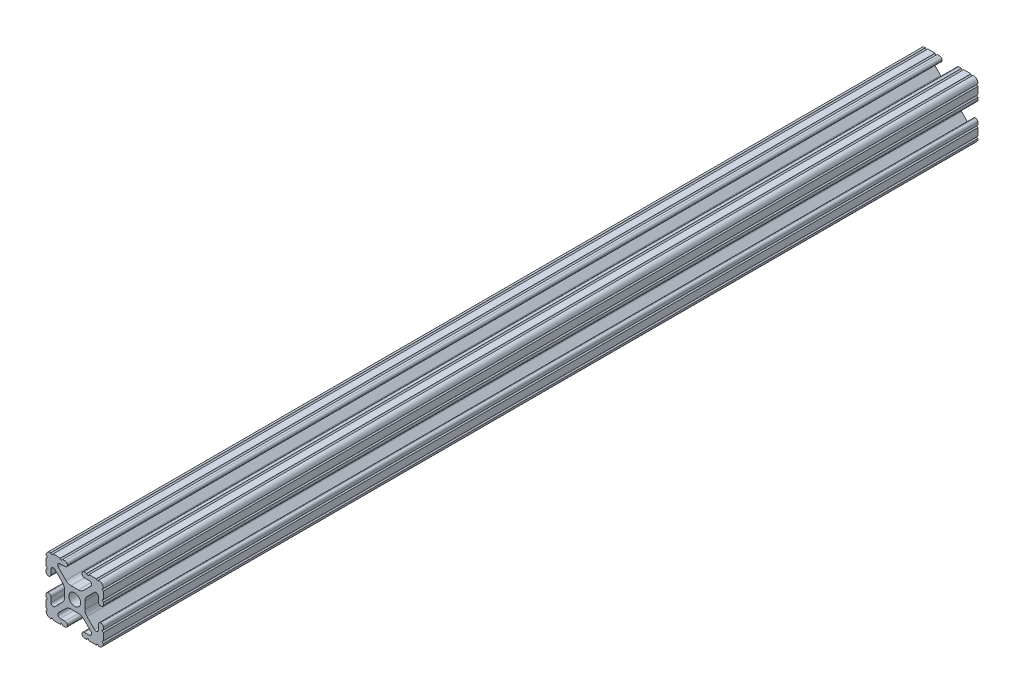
ISO-10303-21;
HEADER;
FILE_DESCRIPTION(('STEP AP214'),'2;1');
FILE_NAME('part.step','',(''),(''),'','','');
FILE_SCHEMA(('AUTOMOTIVE_DESIGN { 1 0 10303 214 1 1 1 1 }'));
ENDSEC;
DATA;
#1=APPLICATION_CONTEXT('core data for automotive mechanical design processes');
#2=APPLICATION_PROTOCOL_DEFINITION('international standard','automotive_design',2000,#1);
#3=PRODUCT_CONTEXT('',#1,'mechanical');
#4=PRODUCT('Part','Part','',(#3));
#5=PRODUCT_RELATED_PRODUCT_CATEGORY('part','',(#4));
#6=PRODUCT_DEFINITION_FORMATION('','',#4);
#7=PRODUCT_DEFINITION_CONTEXT('part definition',#1,'design');
#8=PRODUCT_DEFINITION('design','',#6,#7);
#9=PRODUCT_DEFINITION_SHAPE('','',#8);
#10=(LENGTH_UNIT() NAMED_UNIT(*) SI_UNIT(.MILLI.,.METRE.));
#11=(NAMED_UNIT(*) PLANE_ANGLE_UNIT() SI_UNIT($,.RADIAN.));
#12=(NAMED_UNIT(*) SI_UNIT($,.STERADIAN.) SOLID_ANGLE_UNIT());
#13=UNCERTAINTY_MEASURE_WITH_UNIT(LENGTH_MEASURE(1.E-05),#10,'distance_accuracy_value','');
#14=(GEOMETRIC_REPRESENTATION_CONTEXT(3) GLOBAL_UNCERTAINTY_ASSIGNED_CONTEXT((#13)) GLOBAL_UNIT_ASSIGNED_CONTEXT((#10,
#11,#12)) REPRESENTATION_CONTEXT('',''));
#15=CARTESIAN_POINT('',(0.,0.,0.));
#16=DIRECTION('',(0.,0.,1.));
#17=DIRECTION('',(1.,0.,0.));
#18=AXIS2_PLACEMENT_3D('',#15,#16,#17);
#19=CARTESIAN_POINT('',(-1.70925355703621,-7.67080000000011,-387.35));
#20=DIRECTION('',(0.,0.,1.));
#21=DIRECTION('',(1.,0.,0.));
#22=AXIS2_PLACEMENT_3D('',#19,#20,#21);
#23=CYLINDRICAL_SURFACE('',#22,3.17500000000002);
#24=CARTESIAN_POINT('',(-1.70925355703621,-7.67080000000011,0.));
#25=DIRECTION('',(0.,0.,-1.));
#26=DIRECTION('',(1.,0.,0.));
#27=AXIS2_PLACEMENT_3D('',#24,#25,#26);
#28=CIRCLE('',#27,3.17500000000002);
#29=CARTESIAN_POINT('',(-3.95227025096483,-5.42369049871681,0.));
#30=VERTEX_POINT('',#29);
#31=CARTESIAN_POINT('',(-1.70925355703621,-4.49580000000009,0.));
#32=VERTEX_POINT('',#31);
#33=EDGE_CURVE('E662',#30,#32,#28,.T.);
#34=ORIENTED_EDGE('',*,*,#33,.F.);
#35=DIRECTION('',(0.,0.,1.));
#36=VECTOR('',#35,1.);
#37=CARTESIAN_POINT('',(-3.95227025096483,-5.42369049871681,-387.35));
#38=LINE('',#37,#36);
#39=CARTESIAN_POINT('',(-3.95227025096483,-5.42369049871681,-387.35));
#40=VERTEX_POINT('',#39);
#41=EDGE_CURVE('E11',#40,#30,#38,.T.);
#42=ORIENTED_EDGE('',*,*,#41,.F.);
#43=CARTESIAN_POINT('',(-1.70925355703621,-7.67080000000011,-387.35));
#44=DIRECTION('',(0.,0.,-1.));
#45=DIRECTION('',(1.,0.,0.));
#46=AXIS2_PLACEMENT_3D('',#43,#44,#45);
#47=CIRCLE('',#46,3.17500000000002);
#48=CARTESIAN_POINT('',(-1.70925355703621,-4.49580000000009,-387.35));
#49=VERTEX_POINT('',#48);
#50=EDGE_CURVE('E947',#40,#49,#47,.T.);
#51=ORIENTED_EDGE('',*,*,#50,.T.);
#52=DIRECTION('',(0.,0.,1.));
#53=VECTOR('',#52,1.);
#54=CARTESIAN_POINT('',(-1.70925355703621,-4.49580000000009,-387.35));
#55=LINE('',#54,#53);
#56=EDGE_CURVE('E40',#49,#32,#55,.T.);
#57=ORIENTED_EDGE('',*,*,#56,.T.);
#58=EDGE_LOOP('',(#34,#42,#51,#57));
#59=FACE_BOUND('',#58,.T.);
#60=ADVANCED_FACE('F37',(#59),#23,.F.);
#61=CARTESIAN_POINT('',(-3.95227025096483,-5.42369049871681,-387.35));
#62=DIRECTION('',(0.706461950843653,-0.707751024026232,0.));
#63=DIRECTION('',(0.707751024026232,0.706461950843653,0.));
#64=AXIS2_PLACEMENT_3D('',#61,#62,#63);
#65=PLANE('',#64);
#66=DIRECTION('',(0.707751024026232,0.706461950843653,0.));
#67=VECTOR('',#66,1.);
#68=CARTESIAN_POINT('',(-3.95227025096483,-5.42369049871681,0.));
#69=LINE('',#68,#67);
#70=CARTESIAN_POINT('',(-7.17965049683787,-8.64519250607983,0.));
#71=VERTEX_POINT('',#70);
#72=EDGE_CURVE('E945',#71,#30,#69,.T.);
#73=ORIENTED_EDGE('',*,*,#72,.F.);
#74=DIRECTION('',(0.,0.,1.));
#75=VECTOR('',#74,1.);
#76=CARTESIAN_POINT('',(-7.17965049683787,-8.64519250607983,-387.35));
#77=LINE('',#76,#75);
#78=CARTESIAN_POINT('',(-7.17965049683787,-8.64519250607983,-387.35));
#79=VERTEX_POINT('',#78);
#80=EDGE_CURVE('E46',#79,#71,#77,.T.);
#81=ORIENTED_EDGE('',*,*,#80,.F.);
#82=DIRECTION('',(0.707751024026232,0.706461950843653,0.));
#83=VECTOR('',#82,1.);
#84=CARTESIAN_POINT('',(-3.95227025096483,-5.42369049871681,-387.35));
#85=LINE('',#84,#83);
#86=EDGE_CURVE('E652',#79,#40,#85,.T.);
#87=ORIENTED_EDGE('',*,*,#86,.T.);
#88=ORIENTED_EDGE('',*,*,#41,.T.);
#89=EDGE_LOOP('',(#73,#81,#87,#88));
#90=FACE_BOUND('',#89,.T.);
#91=ADVANCED_FACE('F1135',(#90),#65,.T.);
#92=CARTESIAN_POINT('',(-6.41640832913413,-9.40982735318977,-387.35));
#93=DIRECTION('',(0.,0.,1.));
#94=DIRECTION('',(1.,0.,0.));
#95=AXIS2_PLACEMENT_3D('',#92,#93,#94);
#96=CYLINDRICAL_SURFACE('',#95,1.08037264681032);
#97=CARTESIAN_POINT('',(-6.41640832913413,-9.40982735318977,0.));
#98=DIRECTION('',(0.,0.,-1.));
#99=DIRECTION('',(-1.,0.,0.));
#100=AXIS2_PLACEMENT_3D('',#97,#98,#99);
#101=CIRCLE('',#100,1.08037264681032);
#102=CARTESIAN_POINT('',(-6.41640832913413,-10.4902000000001,0.));
#103=VERTEX_POINT('',#102);
#104=EDGE_CURVE('E639',#103,#71,#101,.T.);
#105=ORIENTED_EDGE('',*,*,#104,.F.);
#106=DIRECTION('',(0.,0.,1.));
#107=VECTOR('',#106,1.);
#108=CARTESIAN_POINT('',(-6.41640832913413,-10.4902000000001,-387.35));
#109=LINE('',#108,#107);
#110=CARTESIAN_POINT('',(-6.41640832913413,-10.4902000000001,-387.35));
#111=VERTEX_POINT('',#110);
#112=EDGE_CURVE('E634',#111,#103,#109,.T.);
#113=ORIENTED_EDGE('',*,*,#112,.F.);
#114=CARTESIAN_POINT('',(-6.41640832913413,-9.40982735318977,-387.35));
#115=DIRECTION('',(0.,0.,-1.));
#116=DIRECTION('',(-1.,0.,0.));
#117=AXIS2_PLACEMENT_3D('',#114,#115,#116);
#118=CIRCLE('',#117,1.08037264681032);
#119=EDGE_CURVE('E637',#111,#79,#118,.T.);
#120=ORIENTED_EDGE('',*,*,#119,.T.);
#121=ORIENTED_EDGE('',*,*,#80,.T.);
#122=EDGE_LOOP('',(#105,#113,#120,#121));
#123=FACE_BOUND('',#122,.T.);
#124=ADVANCED_FACE('F636',(#123),#96,.F.);
#125=CARTESIAN_POINT('',(-6.41640832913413,-10.4902000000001,-387.35));
#126=DIRECTION('',(0.,1.,0.));
#127=DIRECTION('',(0.,0.,1.));
#128=AXIS2_PLACEMENT_3D('',#125,#126,#127);
#129=PLANE('',#128);
#130=DIRECTION('',(-1.,0.,0.));
#131=VECTOR('',#130,1.);
#132=CARTESIAN_POINT('',(-6.41640832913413,-10.4902000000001,0.));
#133=LINE('',#132,#131);
#134=CARTESIAN_POINT('',(-4.2875124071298,-10.4902000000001,0.));
#135=VERTEX_POINT('',#134);
#136=EDGE_CURVE('E942',#135,#103,#133,.T.);
#137=ORIENTED_EDGE('',*,*,#136,.F.);
#138=DIRECTION('',(0.,0.,1.));
#139=VECTOR('',#138,1.);
#140=CARTESIAN_POINT('',(-4.2875124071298,-10.4902000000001,-387.35));
#141=LINE('',#140,#139);
#142=CARTESIAN_POINT('',(-4.2875124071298,-10.4902000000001,-387.35));
#143=VERTEX_POINT('',#142);
#144=EDGE_CURVE('E644',#143,#135,#141,.T.);
#145=ORIENTED_EDGE('',*,*,#144,.F.);
#146=DIRECTION('',(-1.,0.,0.));
#147=VECTOR('',#146,1.);
#148=CARTESIAN_POINT('',(-6.41640832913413,-10.4902000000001,-387.35));
#149=LINE('',#148,#147);
#150=EDGE_CURVE('E650',#143,#111,#149,.T.);
#151=ORIENTED_EDGE('',*,*,#150,.T.);
#152=ORIENTED_EDGE('',*,*,#112,.T.);
#153=EDGE_LOOP('',(#137,#145,#151,#152));
#154=FACE_BOUND('',#153,.T.);
#155=ADVANCED_FACE('F654',(#154),#129,.T.);
#156=CARTESIAN_POINT('',(-4.2875124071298,-11.5392124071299,-387.35));
#157=DIRECTION('',(0.,0.,1.));
#158=DIRECTION('',(1.,0.,0.));
#159=AXIS2_PLACEMENT_3D('',#156,#157,#158);
#160=CYLINDRICAL_SURFACE('',#159,1.04901240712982);
#161=CARTESIAN_POINT('',(-4.2875124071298,-11.5392124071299,0.));
#162=DIRECTION('',(0.,0.,1.));
#163=DIRECTION('',(-1.,0.,0.));
#164=AXIS2_PLACEMENT_3D('',#161,#162,#163);
#165=CIRCLE('',#164,1.04901240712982);
#166=CARTESIAN_POINT('',(-3.23849999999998,-11.5392124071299,0.));
#167=VERTEX_POINT('',#166);
#168=EDGE_CURVE('E939',#167,#135,#165,.T.);
#169=ORIENTED_EDGE('',*,*,#168,.F.);
#170=DIRECTION('',(0.,0.,1.));
#171=VECTOR('',#170,1.);
#172=CARTESIAN_POINT('',(-3.23849999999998,-11.5392124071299,-387.35));
#173=LINE('',#172,#171);
#174=CARTESIAN_POINT('',(-3.23849999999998,-11.5392124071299,-387.35));
#175=VERTEX_POINT('',#174);
#176=EDGE_CURVE('E951',#175,#167,#173,.T.);
#177=ORIENTED_EDGE('',*,*,#176,.F.);
#178=CARTESIAN_POINT('',(-4.2875124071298,-11.5392124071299,-387.35));
#179=DIRECTION('',(0.,0.,1.));
#180=DIRECTION('',(-1.,0.,0.));
#181=AXIS2_PLACEMENT_3D('',#178,#179,#180);
#182=CIRCLE('',#181,1.04901240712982);
#183=EDGE_CURVE('E655',#175,#143,#182,.T.);
#184=ORIENTED_EDGE('',*,*,#183,.T.);
#185=ORIENTED_EDGE('',*,*,#144,.T.);
#186=EDGE_LOOP('',(#169,#177,#184,#185));
#187=FACE_BOUND('',#186,.T.);
#188=ADVANCED_FACE('F1148',(#187),#160,.T.);
#189=CARTESIAN_POINT('',(-3.23849999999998,-11.5392124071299,-387.35));
#190=DIRECTION('',(1.,0.,0.));
#191=DIRECTION('',(0.,1.,0.));
#192=AXIS2_PLACEMENT_3D('',#189,#190,#191);
#193=PLANE('',#192);
#194=DIRECTION('',(0.,1.,0.));
#195=VECTOR('',#194,1.);
#196=CARTESIAN_POINT('',(-3.23849999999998,-11.5392124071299,0.));
#197=LINE('',#196,#195);
#198=CARTESIAN_POINT('',(-3.23849999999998,-11.6509875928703,0.));
#199=VERTEX_POINT('',#198);
#200=EDGE_CURVE('E936',#199,#167,#197,.T.);
#201=ORIENTED_EDGE('',*,*,#200,.F.);
#202=DIRECTION('',(0.,0.,1.));
#203=VECTOR('',#202,1.);
#204=CARTESIAN_POINT('',(-3.23849999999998,-11.6509875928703,-387.35));
#205=LINE('',#204,#203);
#206=CARTESIAN_POINT('',(-3.23849999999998,-11.6509875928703,-387.35));
#207=VERTEX_POINT('',#206);
#208=EDGE_CURVE('E953',#207,#199,#205,.T.);
#209=ORIENTED_EDGE('',*,*,#208,.F.);
#210=DIRECTION('',(0.,1.,0.));
#211=VECTOR('',#210,1.);
#212=CARTESIAN_POINT('',(-3.23849999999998,-11.5392124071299,-387.35));
#213=LINE('',#212,#211);
#214=EDGE_CURVE('E657',#207,#175,#213,.T.);
#215=ORIENTED_EDGE('',*,*,#214,.T.);
#216=ORIENTED_EDGE('',*,*,#176,.T.);
#217=EDGE_LOOP('',(#201,#209,#215,#216));
#218=FACE_BOUND('',#217,.T.);
#219=ADVANCED_FACE('F1151',(#218),#193,.T.);
#220=CARTESIAN_POINT('',(-4.2875124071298,-11.6509875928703,-387.35));
#221=DIRECTION('',(0.,0.,1.));
#222=DIRECTION('',(1.,0.,0.));
#223=AXIS2_PLACEMENT_3D('',#220,#221,#222);
#224=CYLINDRICAL_SURFACE('',#223,1.04901240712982);
#225=CARTESIAN_POINT('',(-4.2875124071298,-11.6509875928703,0.));
#226=DIRECTION('',(0.,0.,1.));
#227=DIRECTION('',(-1.,0.,0.));
#228=AXIS2_PLACEMENT_3D('',#225,#226,#227);
#229=CIRCLE('',#228,1.04901240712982);
#230=CARTESIAN_POINT('',(-4.2875124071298,-12.7000000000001,0.));
#231=VERTEX_POINT('',#230);
#232=EDGE_CURVE('E933',#231,#199,#229,.T.);
#233=ORIENTED_EDGE('',*,*,#232,.F.);
#234=DIRECTION('',(0.,0.,1.));
#235=VECTOR('',#234,1.);
#236=CARTESIAN_POINT('',(-4.2875124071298,-12.7000000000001,-387.35));
#237=LINE('',#236,#235);
#238=CARTESIAN_POINT('',(-4.2875124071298,-12.7000000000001,-387.35));
#239=VERTEX_POINT('',#238);
#240=EDGE_CURVE('E955',#239,#231,#237,.T.);
#241=ORIENTED_EDGE('',*,*,#240,.F.);
#242=CARTESIAN_POINT('',(-4.2875124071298,-11.6509875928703,-387.35));
#243=DIRECTION('',(0.,0.,1.));
#244=DIRECTION('',(-1.,0.,0.));
#245=AXIS2_PLACEMENT_3D('',#242,#243,#244);
#246=CIRCLE('',#245,1.04901240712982);
#247=EDGE_CURVE('E1802',#239,#207,#246,.T.);
#248=ORIENTED_EDGE('',*,*,#247,.T.);
#249=ORIENTED_EDGE('',*,*,#208,.T.);
#250=EDGE_LOOP('',(#233,#241,#248,#249));
#251=FACE_BOUND('',#250,.T.);
#252=ADVANCED_FACE('F1155',(#251),#224,.T.);
#253=CARTESIAN_POINT('',(-4.2875124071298,-12.7000000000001,-387.35));
#254=DIRECTION('',(0.,-1.,0.));
#255=DIRECTION('',(1.,0.,0.));
#256=AXIS2_PLACEMENT_3D('',#253,#254,#255);
#257=PLANE('',#256);
#258=DIRECTION('',(1.,0.,0.));
#259=VECTOR('',#258,1.);
#260=CARTESIAN_POINT('',(-4.2875124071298,-12.7000000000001,0.));
#261=LINE('',#260,#259);
#262=CARTESIAN_POINT('',(-5.31712671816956,-12.7000000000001,0.));
#263=VERTEX_POINT('',#262);
#264=EDGE_CURVE('E930',#263,#231,#261,.T.);
#265=ORIENTED_EDGE('',*,*,#264,.F.);
#266=DIRECTION('',(0.,0.,1.));
#267=VECTOR('',#266,1.);
#268=CARTESIAN_POINT('',(-5.31712671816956,-12.7000000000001,-387.35));
#269=LINE('',#268,#267);
#270=CARTESIAN_POINT('',(-5.31712671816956,-12.7000000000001,-387.35));
#271=VERTEX_POINT('',#270);
#272=EDGE_CURVE('E957',#271,#263,#269,.T.);
#273=ORIENTED_EDGE('',*,*,#272,.F.);
#274=DIRECTION('',(1.,0.,0.));
#275=VECTOR('',#274,1.);
#276=CARTESIAN_POINT('',(-4.2875124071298,-12.7000000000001,-387.35));
#277=LINE('',#276,#275);
#278=EDGE_CURVE('E1799',#271,#239,#277,.T.);
#279=ORIENTED_EDGE('',*,*,#278,.T.);
#280=ORIENTED_EDGE('',*,*,#240,.T.);
#281=EDGE_LOOP('',(#265,#273,#279,#280));
#282=FACE_BOUND('',#281,.T.);
#283=ADVANCED_FACE('F1159',(#282),#257,.T.);
#284=CARTESIAN_POINT('',(-5.82512671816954,-12.7000000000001,-387.35));
#285=DIRECTION('',(0.,0.,1.));
#286=DIRECTION('',(1.,0.,0.));
#287=AXIS2_PLACEMENT_3D('',#284,#285,#286);
#288=CYLINDRICAL_SURFACE('',#287,0.507999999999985);
#289=CARTESIAN_POINT('',(-5.82512671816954,-12.7000000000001,0.));
#290=DIRECTION('',(0.,0.,-1.));
#291=DIRECTION('',(-1.,0.,0.));
#292=AXIS2_PLACEMENT_3D('',#289,#290,#291);
#293=CIRCLE('',#292,0.507999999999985);
#294=CARTESIAN_POINT('',(-6.33312671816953,-12.7000000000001,0.));
#295=VERTEX_POINT('',#294);
#296=EDGE_CURVE('E927',#295,#263,#293,.T.);
#297=ORIENTED_EDGE('',*,*,#296,.F.);
#298=DIRECTION('',(0.,0.,1.));
#299=VECTOR('',#298,1.);
#300=CARTESIAN_POINT('',(-6.33312671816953,-12.7000000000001,-387.35));
#301=LINE('',#300,#299);
#302=CARTESIAN_POINT('',(-6.33312671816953,-12.7000000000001,-387.35));
#303=VERTEX_POINT('',#302);
#304=EDGE_CURVE('E959',#303,#295,#301,.T.);
#305=ORIENTED_EDGE('',*,*,#304,.F.);
#306=CARTESIAN_POINT('',(-5.82512671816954,-12.7000000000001,-387.35));
#307=DIRECTION('',(0.,0.,-1.));
#308=DIRECTION('',(-1.,0.,0.));
#309=AXIS2_PLACEMENT_3D('',#306,#307,#308);
#310=CIRCLE('',#309,0.507999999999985);
#311=EDGE_CURVE('E1796',#303,#271,#310,.T.);
#312=ORIENTED_EDGE('',*,*,#311,.T.);
#313=ORIENTED_EDGE('',*,*,#272,.T.);
#314=EDGE_LOOP('',(#297,#305,#312,#313));
#315=FACE_BOUND('',#314,.T.);
#316=ADVANCED_FACE('F1163',(#315),#288,.F.);
#317=CARTESIAN_POINT('',(-6.33312671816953,-12.7000000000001,-387.35));
#318=DIRECTION('',(0.,-1.,0.));
#319=DIRECTION('',(0.,0.,-1.));
#320=AXIS2_PLACEMENT_3D('',#317,#318,#319);
#321=PLANE('',#320);
#322=DIRECTION('',(1.,0.,0.));
#323=VECTOR('',#322,1.);
#324=CARTESIAN_POINT('',(-6.33312671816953,-12.7000000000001,0.));
#325=LINE('',#324,#323);
#326=CARTESIAN_POINT('',(-9.55044311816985,-12.7000000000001,0.));
#327=VERTEX_POINT('',#326);
#328=EDGE_CURVE('E924',#327,#295,#325,.T.);
#329=ORIENTED_EDGE('',*,*,#328,.F.);
#330=DIRECTION('',(0.,0.,1.));
#331=VECTOR('',#330,1.);
#332=CARTESIAN_POINT('',(-9.55044311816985,-12.7000000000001,-387.35));
#333=LINE('',#332,#331);
#334=CARTESIAN_POINT('',(-9.55044311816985,-12.7000000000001,-387.35));
#335=VERTEX_POINT('',#334);
#336=EDGE_CURVE('E961',#335,#327,#333,.T.);
#337=ORIENTED_EDGE('',*,*,#336,.F.);
#338=DIRECTION('',(1.,0.,0.));
#339=VECTOR('',#338,1.);
#340=CARTESIAN_POINT('',(-6.33312671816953,-12.7000000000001,-387.35));
#341=LINE('',#340,#339);
#342=EDGE_CURVE('E1793',#335,#303,#341,.T.);
#343=ORIENTED_EDGE('',*,*,#342,.T.);
#344=ORIENTED_EDGE('',*,*,#304,.T.);
#345=EDGE_LOOP('',(#329,#337,#343,#344));
#346=FACE_BOUND('',#345,.T.);
#347=ADVANCED_FACE('F1167',(#346),#321,.T.);
#348=CARTESIAN_POINT('',(-10.0584431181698,-12.7000000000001,-387.35));
#349=DIRECTION('',(0.,0.,1.));
#350=DIRECTION('',(1.,0.,0.));
#351=AXIS2_PLACEMENT_3D('',#348,#349,#350);
#352=CYLINDRICAL_SURFACE('',#351,0.507999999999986);
#353=CARTESIAN_POINT('',(-10.0584431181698,-12.7000000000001,0.));
#354=DIRECTION('',(0.,0.,-1.));
#355=DIRECTION('',(-1.,0.,0.));
#356=AXIS2_PLACEMENT_3D('',#353,#354,#355);
#357=CIRCLE('',#356,0.507999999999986);
#358=CARTESIAN_POINT('',(-10.5664430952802,-12.6998475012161,0.));
#359=VERTEX_POINT('',#358);
#360=EDGE_CURVE('E921',#359,#327,#357,.T.);
#361=ORIENTED_EDGE('',*,*,#360,.F.);
#362=DIRECTION('',(0.,0.,1.));
#363=VECTOR('',#362,1.);
#364=CARTESIAN_POINT('',(-10.5664430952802,-12.6998475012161,-387.35));
#365=LINE('',#364,#363);
#366=CARTESIAN_POINT('',(-10.5664430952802,-12.6998475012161,-387.35));
#367=VERTEX_POINT('',#366);
#368=EDGE_CURVE('E963',#367,#359,#365,.T.);
#369=ORIENTED_EDGE('',*,*,#368,.F.);
#370=CARTESIAN_POINT('',(-10.0584431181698,-12.7000000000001,-387.35));
#371=DIRECTION('',(0.,0.,-1.));
#372=DIRECTION('',(-1.,0.,0.));
#373=AXIS2_PLACEMENT_3D('',#370,#371,#372);
#374=CIRCLE('',#373,0.507999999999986);
#375=EDGE_CURVE('E1790',#367,#335,#374,.T.);
#376=ORIENTED_EDGE('',*,*,#375,.T.);
#377=ORIENTED_EDGE('',*,*,#336,.T.);
#378=EDGE_LOOP('',(#361,#369,#376,#377));
#379=FACE_BOUND('',#378,.T.);
#380=ADVANCED_FACE('F1171',(#379),#352,.F.);
#381=CARTESIAN_POINT('',(-10.5918000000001,-10.5918000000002,-387.35));
#382=DIRECTION('',(0.,0.,1.));
#383=DIRECTION('',(1.,0.,0.));
#384=AXIS2_PLACEMENT_3D('',#381,#382,#383);
#385=CYLINDRICAL_SURFACE('',#384,2.1081999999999);
#386=CARTESIAN_POINT('',(-10.5918000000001,-10.5918000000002,0.));
#387=DIRECTION('',(0.,0.,1.));
#388=DIRECTION('',(-1.,0.,0.));
#389=AXIS2_PLACEMENT_3D('',#386,#387,#388);
#390=CIRCLE('',#389,2.1081999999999);
#391=CARTESIAN_POINT('',(-12.699846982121,-10.5663999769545,0.));
#392=VERTEX_POINT('',#391);
#393=EDGE_CURVE('E918',#392,#359,#390,.T.);
#394=ORIENTED_EDGE('',*,*,#393,.F.);
#395=DIRECTION('',(0.,0.,1.));
#396=VECTOR('',#395,1.);
#397=CARTESIAN_POINT('',(-12.699846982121,-10.5663999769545,-387.35));
#398=LINE('',#397,#396);
#399=CARTESIAN_POINT('',(-12.699846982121,-10.5663999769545,-387.35));
#400=VERTEX_POINT('',#399);
#401=EDGE_CURVE('E965',#400,#392,#398,.T.);
#402=ORIENTED_EDGE('',*,*,#401,.F.);
#403=CARTESIAN_POINT('',(-10.5918000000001,-10.5918000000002,-387.35));
#404=DIRECTION('',(0.,0.,1.));
#405=DIRECTION('',(-1.,0.,0.));
#406=AXIS2_PLACEMENT_3D('',#403,#404,#405);
#407=CIRCLE('',#406,2.1081999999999);
#408=EDGE_CURVE('E1787',#400,#367,#407,.T.);
#409=ORIENTED_EDGE('',*,*,#408,.T.);
#410=ORIENTED_EDGE('',*,*,#368,.T.);
#411=EDGE_LOOP('',(#394,#402,#409,#410));
#412=FACE_BOUND('',#411,.T.);
#413=ADVANCED_FACE('F1175',(#412),#385,.T.);
#414=CARTESIAN_POINT('',(-12.7,-10.0584000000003,-387.35));
#415=DIRECTION('',(0.,0.,1.));
#416=DIRECTION('',(1.,0.,0.));
#417=AXIS2_PLACEMENT_3D('',#414,#415,#416);
#418=CYLINDRICAL_SURFACE('',#417,0.507999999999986);
#419=CARTESIAN_POINT('',(-12.7,-10.0584000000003,0.));
#420=DIRECTION('',(0.,0.,-1.));
#421=DIRECTION('',(-1.,0.,0.));
#422=AXIS2_PLACEMENT_3D('',#419,#420,#421);
#423=CIRCLE('',#422,0.507999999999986);
#424=CARTESIAN_POINT('',(-12.7,-9.5504000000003,0.));
#425=VERTEX_POINT('',#424);
#426=EDGE_CURVE('E915',#425,#392,#423,.T.);
#427=ORIENTED_EDGE('',*,*,#426,.F.);
#428=DIRECTION('',(0.,0.,1.));
#429=VECTOR('',#428,1.);
#430=CARTESIAN_POINT('',(-12.7,-9.5504000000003,-387.35));
#431=LINE('',#430,#429);
#432=CARTESIAN_POINT('',(-12.7,-9.5504000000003,-387.35));
#433=VERTEX_POINT('',#432);
#434=EDGE_CURVE('E967',#433,#425,#431,.T.);
#435=ORIENTED_EDGE('',*,*,#434,.F.);
#436=CARTESIAN_POINT('',(-12.7,-10.0584000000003,-387.35));
#437=DIRECTION('',(0.,0.,-1.));
#438=DIRECTION('',(-1.,0.,0.));
#439=AXIS2_PLACEMENT_3D('',#436,#437,#438);
#440=CIRCLE('',#439,0.507999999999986);
#441=EDGE_CURVE('E1784',#433,#400,#440,.T.);
#442=ORIENTED_EDGE('',*,*,#441,.T.);
#443=ORIENTED_EDGE('',*,*,#401,.T.);
#444=EDGE_LOOP('',(#427,#435,#442,#443));
#445=FACE_BOUND('',#444,.T.);
#446=ADVANCED_FACE('F1179',(#445),#418,.F.);
#447=CARTESIAN_POINT('',(-12.7,-9.5504000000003,-387.35));
#448=DIRECTION('',(-1.,0.,0.));
#449=DIRECTION('',(0.,-1.,0.));
#450=AXIS2_PLACEMENT_3D('',#447,#448,#449);
#451=PLANE('',#450);
#452=DIRECTION('',(0.,-1.,0.));
#453=VECTOR('',#452,1.);
#454=CARTESIAN_POINT('',(-12.7,-9.5504000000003,0.));
#455=LINE('',#454,#453);
#456=CARTESIAN_POINT('',(-12.7,-6.33308359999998,0.));
#457=VERTEX_POINT('',#456);
#458=EDGE_CURVE('E912',#457,#425,#455,.T.);
#459=ORIENTED_EDGE('',*,*,#458,.F.);
#460=DIRECTION('',(0.,0.,1.));
#461=VECTOR('',#460,1.);
#462=CARTESIAN_POINT('',(-12.7,-6.33308359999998,-387.35));
#463=LINE('',#462,#461);
#464=CARTESIAN_POINT('',(-12.7,-6.33308359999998,-387.35));
#465=VERTEX_POINT('',#464);
#466=EDGE_CURVE('E969',#465,#457,#463,.T.);
#467=ORIENTED_EDGE('',*,*,#466,.F.);
#468=DIRECTION('',(0.,-1.,0.));
#469=VECTOR('',#468,1.);
#470=CARTESIAN_POINT('',(-12.7,-9.5504000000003,-387.35));
#471=LINE('',#470,#469);
#472=EDGE_CURVE('E1781',#465,#433,#471,.T.);
#473=ORIENTED_EDGE('',*,*,#472,.T.);
#474=ORIENTED_EDGE('',*,*,#434,.T.);
#475=EDGE_LOOP('',(#459,#467,#473,#474));
#476=FACE_BOUND('',#475,.T.);
#477=ADVANCED_FACE('F1183',(#476),#451,.T.);
#478=CARTESIAN_POINT('',(-12.7,-5.8250836,-387.35));
#479=DIRECTION('',(0.,0.,1.));
#480=DIRECTION('',(1.,0.,0.));
#481=AXIS2_PLACEMENT_3D('',#478,#479,#480);
#482=CYLINDRICAL_SURFACE('',#481,0.507999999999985);
#483=CARTESIAN_POINT('',(-12.7,-5.8250836,0.));
#484=DIRECTION('',(0.,0.,-1.));
#485=DIRECTION('',(-1.,0.,0.));
#486=AXIS2_PLACEMENT_3D('',#483,#484,#485);
#487=CIRCLE('',#486,0.507999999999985);
#488=CARTESIAN_POINT('',(-12.7,-5.31708360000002,0.));
#489=VERTEX_POINT('',#488);
#490=EDGE_CURVE('E909',#489,#457,#487,.T.);
#491=ORIENTED_EDGE('',*,*,#490,.F.);
#492=DIRECTION('',(0.,0.,1.));
#493=VECTOR('',#492,1.);
#494=CARTESIAN_POINT('',(-12.7,-5.31708360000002,-387.35));
#495=LINE('',#494,#493);
#496=CARTESIAN_POINT('',(-12.7,-5.31708360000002,-387.35));
#497=VERTEX_POINT('',#496);
#498=EDGE_CURVE('E971',#497,#489,#495,.T.);
#499=ORIENTED_EDGE('',*,*,#498,.F.);
#500=CARTESIAN_POINT('',(-12.7,-5.8250836,-387.35));
#501=DIRECTION('',(0.,0.,-1.));
#502=DIRECTION('',(-1.,0.,0.));
#503=AXIS2_PLACEMENT_3D('',#500,#501,#502);
#504=CIRCLE('',#503,0.507999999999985);
#505=EDGE_CURVE('E1778',#497,#465,#504,.T.);
#506=ORIENTED_EDGE('',*,*,#505,.T.);
#507=ORIENTED_EDGE('',*,*,#466,.T.);
#508=EDGE_LOOP('',(#491,#499,#506,#507));
#509=FACE_BOUND('',#508,.T.);
#510=ADVANCED_FACE('F1187',(#509),#482,.F.);
#511=CARTESIAN_POINT('',(-12.7,-5.31708360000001,-387.35));
#512=DIRECTION('',(-1.,0.,0.));
#513=DIRECTION('',(0.,-1.,0.));
#514=AXIS2_PLACEMENT_3D('',#511,#512,#513);
#515=PLANE('',#514);
#516=DIRECTION('',(0.,-1.,0.));
#517=VECTOR('',#516,1.);
#518=CARTESIAN_POINT('',(-12.7,-5.31708360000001,0.));
#519=LINE('',#518,#517);
#520=CARTESIAN_POINT('',(-12.7,-4.28746928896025,0.));
#521=VERTEX_POINT('',#520);
#522=EDGE_CURVE('E906',#521,#489,#519,.T.);
#523=ORIENTED_EDGE('',*,*,#522,.F.);
#524=DIRECTION('',(0.,0.,1.));
#525=VECTOR('',#524,1.);
#526=CARTESIAN_POINT('',(-12.7,-4.28746928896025,-387.35));
#527=LINE('',#526,#525);
#528=CARTESIAN_POINT('',(-12.7,-4.28746928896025,-387.35));
#529=VERTEX_POINT('',#528);
#530=EDGE_CURVE('E973',#529,#521,#527,.T.);
#531=ORIENTED_EDGE('',*,*,#530,.F.);
#532=DIRECTION('',(0.,-1.,0.));
#533=VECTOR('',#532,1.);
#534=CARTESIAN_POINT('',(-12.7,-5.31708360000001,-387.35));
#535=LINE('',#534,#533);
#536=EDGE_CURVE('E1775',#529,#497,#535,.T.);
#537=ORIENTED_EDGE('',*,*,#536,.T.);
#538=ORIENTED_EDGE('',*,*,#498,.T.);
#539=EDGE_LOOP('',(#523,#531,#537,#538));
#540=FACE_BOUND('',#539,.T.);
#541=ADVANCED_FACE('F1191',(#540),#515,.T.);
#542=CARTESIAN_POINT('',(-11.6509875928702,-4.28746928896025,-387.35));
#543=DIRECTION('',(0.,0.,1.));
#544=DIRECTION('',(1.,0.,0.));
#545=AXIS2_PLACEMENT_3D('',#542,#543,#544);
#546=CYLINDRICAL_SURFACE('',#545,1.04901240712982);
#547=CARTESIAN_POINT('',(-11.6509875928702,-4.28746928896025,0.));
#548=DIRECTION('',(0.,0.,1.));
#549=DIRECTION('',(-1.,0.,0.));
#550=AXIS2_PLACEMENT_3D('',#547,#548,#549);
#551=CIRCLE('',#550,1.04901240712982);
#552=CARTESIAN_POINT('',(-11.6509875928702,-3.23845688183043,0.));
#553=VERTEX_POINT('',#552);
#554=EDGE_CURVE('E903',#553,#521,#551,.T.);
#555=ORIENTED_EDGE('',*,*,#554,.F.);
#556=DIRECTION('',(0.,0.,1.));
#557=VECTOR('',#556,1.);
#558=CARTESIAN_POINT('',(-11.6509875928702,-3.23845688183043,-387.35));
#559=LINE('',#558,#557);
#560=CARTESIAN_POINT('',(-11.6509875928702,-3.23845688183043,-387.35));
#561=VERTEX_POINT('',#560);
#562=EDGE_CURVE('E975',#561,#553,#559,.T.);
#563=ORIENTED_EDGE('',*,*,#562,.F.);
#564=CARTESIAN_POINT('',(-11.6509875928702,-4.28746928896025,-387.35));
#565=DIRECTION('',(0.,0.,1.));
#566=DIRECTION('',(-1.,0.,0.));
#567=AXIS2_PLACEMENT_3D('',#564,#565,#566);
#568=CIRCLE('',#567,1.04901240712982);
#569=EDGE_CURVE('E1772',#561,#529,#568,.T.);
#570=ORIENTED_EDGE('',*,*,#569,.T.);
#571=ORIENTED_EDGE('',*,*,#530,.T.);
#572=EDGE_LOOP('',(#555,#563,#570,#571));
#573=FACE_BOUND('',#572,.T.);
#574=ADVANCED_FACE('F1195',(#573),#546,.T.);
#575=CARTESIAN_POINT('',(-11.6509875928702,-3.23845688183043,-387.35));
#576=DIRECTION('',(0.,1.,0.));
#577=DIRECTION('',(-1.,0.,0.));
#578=AXIS2_PLACEMENT_3D('',#575,#576,#577);
#579=PLANE('',#578);
#580=DIRECTION('',(-1.,0.,0.));
#581=VECTOR('',#580,1.);
#582=CARTESIAN_POINT('',(-11.6509875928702,-3.23845688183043,0.));
#583=LINE('',#582,#581);
#584=CARTESIAN_POINT('',(-11.5392124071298,-3.23845688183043,0.));
#585=VERTEX_POINT('',#584);
#586=EDGE_CURVE('E900',#585,#553,#583,.T.);
#587=ORIENTED_EDGE('',*,*,#586,.F.);
#588=DIRECTION('',(0.,0.,1.));
#589=VECTOR('',#588,1.);
#590=CARTESIAN_POINT('',(-11.5392124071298,-3.23845688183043,-387.35));
#591=LINE('',#590,#589);
#592=CARTESIAN_POINT('',(-11.5392124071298,-3.23845688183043,-387.35));
#593=VERTEX_POINT('',#592);
#594=EDGE_CURVE('E977',#593,#585,#591,.T.);
#595=ORIENTED_EDGE('',*,*,#594,.F.);
#596=DIRECTION('',(-1.,0.,0.));
#597=VECTOR('',#596,1.);
#598=CARTESIAN_POINT('',(-11.6509875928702,-3.23845688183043,-387.35));
#599=LINE('',#598,#597);
#600=EDGE_CURVE('E1769',#593,#561,#599,.T.);
#601=ORIENTED_EDGE('',*,*,#600,.T.);
#602=ORIENTED_EDGE('',*,*,#562,.T.);
#603=EDGE_LOOP('',(#587,#595,#601,#602));
#604=FACE_BOUND('',#603,.T.);
#605=ADVANCED_FACE('F1199',(#604),#579,.T.);
#606=CARTESIAN_POINT('',(-11.5392124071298,-4.28746928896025,-387.35));
#607=DIRECTION('',(0.,0.,1.));
#608=DIRECTION('',(1.,0.,0.));
#609=AXIS2_PLACEMENT_3D('',#606,#607,#608);
#610=CYLINDRICAL_SURFACE('',#609,1.04901240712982);
#611=CARTESIAN_POINT('',(-11.5392124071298,-4.28746928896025,0.));
#612=DIRECTION('',(0.,0.,1.));
#613=DIRECTION('',(-1.,0.,0.));
#614=AXIS2_PLACEMENT_3D('',#611,#612,#613);
#615=CIRCLE('',#614,1.04901240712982);
#616=CARTESIAN_POINT('',(-10.4902,-4.28746928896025,0.));
#617=VERTEX_POINT('',#616);
#618=EDGE_CURVE('E897',#617,#585,#615,.T.);
#619=ORIENTED_EDGE('',*,*,#618,.F.);
#620=DIRECTION('',(0.,0.,1.));
#621=VECTOR('',#620,1.);
#622=CARTESIAN_POINT('',(-10.4902,-4.28746928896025,-387.35));
#623=LINE('',#622,#621);
#624=CARTESIAN_POINT('',(-10.4902,-4.28746928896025,-387.35));
#625=VERTEX_POINT('',#624);
#626=EDGE_CURVE('E979',#625,#617,#623,.T.);
#627=ORIENTED_EDGE('',*,*,#626,.F.);
#628=CARTESIAN_POINT('',(-11.5392124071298,-4.28746928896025,-387.35));
#629=DIRECTION('',(0.,0.,1.));
#630=DIRECTION('',(-1.,0.,0.));
#631=AXIS2_PLACEMENT_3D('',#628,#629,#630);
#632=CIRCLE('',#631,1.04901240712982);
#633=EDGE_CURVE('E1766',#625,#593,#632,.T.);
#634=ORIENTED_EDGE('',*,*,#633,.T.);
#635=ORIENTED_EDGE('',*,*,#594,.T.);
#636=EDGE_LOOP('',(#619,#627,#634,#635));
#637=FACE_BOUND('',#636,.T.);
#638=ADVANCED_FACE('F1203',(#637),#610,.T.);
#639=CARTESIAN_POINT('',(-10.4902,-4.28746928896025,-387.35));
#640=DIRECTION('',(1.,0.,0.));
#641=DIRECTION('',(0.,0.,-1.));
#642=AXIS2_PLACEMENT_3D('',#639,#640,#641);
#643=PLANE('',#642);
#644=DIRECTION('',(0.,1.,0.));
#645=VECTOR('',#644,1.);
#646=CARTESIAN_POINT('',(-10.4902,-4.28746928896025,0.));
#647=LINE('',#646,#645);
#648=CARTESIAN_POINT('',(-10.4902,-6.4020890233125,0.));
#649=VERTEX_POINT('',#648);
#650=EDGE_CURVE('E894',#649,#617,#647,.T.);
#651=ORIENTED_EDGE('',*,*,#650,.F.);
#652=DIRECTION('',(0.,0.,1.));
#653=VECTOR('',#652,1.);
#654=CARTESIAN_POINT('',(-10.4902,-6.4020890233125,-387.35));
#655=LINE('',#654,#653);
#656=CARTESIAN_POINT('',(-10.4902,-6.4020890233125,-387.35));
#657=VERTEX_POINT('',#656);
#658=EDGE_CURVE('E981',#657,#649,#655,.T.);
#659=ORIENTED_EDGE('',*,*,#658,.F.);
#660=DIRECTION('',(0.,1.,0.));
#661=VECTOR('',#660,1.);
#662=CARTESIAN_POINT('',(-10.4902,-4.28746928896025,-387.35));
#663=LINE('',#662,#661);
#664=EDGE_CURVE('E1763',#657,#625,#663,.T.);
#665=ORIENTED_EDGE('',*,*,#664,.T.);
#666=ORIENTED_EDGE('',*,*,#626,.T.);
#667=EDGE_LOOP('',(#651,#659,#665,#666));
#668=FACE_BOUND('',#667,.T.);
#669=ADVANCED_FACE('F1207',(#668),#643,.T.);
#670=CARTESIAN_POINT('',(-9.4627890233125,-6.4020890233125,-387.35));
#671=DIRECTION('',(0.,0.,1.));
#672=DIRECTION('',(1.,0.,0.));
#673=AXIS2_PLACEMENT_3D('',#670,#671,#672);
#674=CYLINDRICAL_SURFACE('',#673,1.0274109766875);
#675=CARTESIAN_POINT('',(-9.4627890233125,-6.4020890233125,0.));
#676=DIRECTION('',(0.,0.,-1.));
#677=DIRECTION('',(-1.,0.,0.));
#678=AXIS2_PLACEMENT_3D('',#675,#676,#677);
#679=CIRCLE('',#678,1.0274109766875);
#680=CARTESIAN_POINT('',(-8.7371313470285,-7.12940893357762,0.));
#681=VERTEX_POINT('',#680);
#682=EDGE_CURVE('E891',#681,#649,#679,.T.);
#683=ORIENTED_EDGE('',*,*,#682,.F.);
#684=DIRECTION('',(0.,0.,1.));
#685=VECTOR('',#684,1.);
#686=CARTESIAN_POINT('',(-8.7371313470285,-7.12940893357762,-387.35));
#687=LINE('',#686,#685);
#688=CARTESIAN_POINT('',(-8.7371313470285,-7.12940893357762,-387.35));
#689=VERTEX_POINT('',#688);
#690=EDGE_CURVE('E983',#689,#681,#687,.T.);
#691=ORIENTED_EDGE('',*,*,#690,.F.);
#692=CARTESIAN_POINT('',(-9.4627890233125,-6.4020890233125,-387.35));
#693=DIRECTION('',(0.,0.,-1.));
#694=DIRECTION('',(-1.,0.,0.));
#695=AXIS2_PLACEMENT_3D('',#692,#693,#694);
#696=CIRCLE('',#695,1.0274109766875);
#697=EDGE_CURVE('E1760',#689,#657,#696,.T.);
#698=ORIENTED_EDGE('',*,*,#697,.T.);
#699=ORIENTED_EDGE('',*,*,#658,.T.);
#700=EDGE_LOOP('',(#683,#691,#698,#699));
#701=FACE_BOUND('',#700,.T.);
#702=ADVANCED_FACE('F1211',(#701),#674,.F.);
#703=CARTESIAN_POINT('',(-8.7371313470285,-7.12940893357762,-387.35));
#704=DIRECTION('',(-0.706297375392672,0.707915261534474,0.));
#705=DIRECTION('',(-0.707915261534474,-0.706297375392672,0.));
#706=AXIS2_PLACEMENT_3D('',#703,#704,#705);
#707=PLANE('',#706);
#708=DIRECTION('',(-0.707915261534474,-0.706297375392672,0.));
#709=VECTOR('',#708,1.);
#710=CARTESIAN_POINT('',(-8.7371313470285,-7.12940893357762,0.));
#711=LINE('',#710,#709);
#712=CARTESIAN_POINT('',(-5.44100583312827,-3.84081646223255,0.));
#713=VERTEX_POINT('',#712);
#714=EDGE_CURVE('E888',#713,#681,#711,.T.);
#715=ORIENTED_EDGE('',*,*,#714,.F.);
#716=DIRECTION('',(0.,0.,1.));
#717=VECTOR('',#716,1.);
#718=CARTESIAN_POINT('',(-5.44100583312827,-3.84081646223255,-387.35));
#719=LINE('',#718,#717);
#720=CARTESIAN_POINT('',(-5.44100583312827,-3.84081646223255,-387.35));
#721=VERTEX_POINT('',#720);
#722=EDGE_CURVE('E985',#721,#713,#719,.T.);
#723=ORIENTED_EDGE('',*,*,#722,.F.);
#724=DIRECTION('',(-0.707915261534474,-0.706297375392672,0.));
#725=VECTOR('',#724,1.);
#726=CARTESIAN_POINT('',(-8.7371313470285,-7.12940893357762,-387.35));
#727=LINE('',#726,#725);
#728=EDGE_CURVE('E1757',#721,#689,#727,.T.);
#729=ORIENTED_EDGE('',*,*,#728,.T.);
#730=ORIENTED_EDGE('',*,*,#690,.T.);
#731=EDGE_LOOP('',(#715,#723,#729,#730));
#732=FACE_BOUND('',#731,.T.);
#733=ADVANCED_FACE('F1215',(#732),#707,.T.);
#734=CARTESIAN_POINT('',(-7.68350000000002,-1.59318550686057,-387.35));
#735=DIRECTION('',(0.,0.,1.));
#736=DIRECTION('',(1.,0.,0.));
#737=AXIS2_PLACEMENT_3D('',#734,#735,#736);
#738=CYLINDRICAL_SURFACE('',#737,3.17500000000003);
#739=CARTESIAN_POINT('',(-7.68350000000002,-1.59318550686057,0.));
#740=DIRECTION('',(0.,0.,-1.));
#741=DIRECTION('',(-1.,0.,0.));
#742=AXIS2_PLACEMENT_3D('',#739,#740,#741);
#743=CIRCLE('',#742,3.17500000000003);
#744=CARTESIAN_POINT('',(-4.5085,-1.59318550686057,0.));
#745=VERTEX_POINT('',#744);
#746=EDGE_CURVE('E885',#745,#713,#743,.T.);
#747=ORIENTED_EDGE('',*,*,#746,.F.);
#748=DIRECTION('',(0.,0.,1.));
#749=VECTOR('',#748,1.);
#750=CARTESIAN_POINT('',(-4.5085,-1.59318550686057,-387.35));
#751=LINE('',#750,#749);
#752=CARTESIAN_POINT('',(-4.5085,-1.59318550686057,-387.35));
#753=VERTEX_POINT('',#752);
#754=EDGE_CURVE('E987',#753,#745,#751,.T.);
#755=ORIENTED_EDGE('',*,*,#754,.F.);
#756=CARTESIAN_POINT('',(-7.68350000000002,-1.59318550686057,-387.35));
#757=DIRECTION('',(0.,0.,-1.));
#758=DIRECTION('',(-1.,0.,0.));
#759=AXIS2_PLACEMENT_3D('',#756,#757,#758);
#760=CIRCLE('',#759,3.17500000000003);
#761=EDGE_CURVE('E1754',#753,#721,#760,.T.);
#762=ORIENTED_EDGE('',*,*,#761,.T.);
#763=ORIENTED_EDGE('',*,*,#722,.T.);
#764=EDGE_LOOP('',(#747,#755,#762,#763));
#765=FACE_BOUND('',#764,.T.);
#766=ADVANCED_FACE('F1219',(#765),#738,.F.);
#767=CARTESIAN_POINT('',(-4.5085,-1.59318550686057,-387.35));
#768=DIRECTION('',(-1.,0.,0.));
#769=DIRECTION('',(0.,0.,1.));
#770=AXIS2_PLACEMENT_3D('',#767,#768,#769);
#771=PLANE('',#770);
#772=DIRECTION('',(0.,-1.,0.));
#773=VECTOR('',#772,1.);
#774=CARTESIAN_POINT('',(-4.5085,-1.59318550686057,0.));
#775=LINE('',#774,#773);
#776=CARTESIAN_POINT('',(-4.5085,1.59318550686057,0.));
#777=VERTEX_POINT('',#776);
#778=EDGE_CURVE('E882',#777,#745,#775,.T.);
#779=ORIENTED_EDGE('',*,*,#778,.F.);
#780=DIRECTION('',(0.,0.,1.));
#781=VECTOR('',#780,1.);
#782=CARTESIAN_POINT('',(-4.5085,1.59318550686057,-387.35));
#783=LINE('',#782,#781);
#784=CARTESIAN_POINT('',(-4.5085,1.59318550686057,-387.35));
#785=VERTEX_POINT('',#784);
#786=EDGE_CURVE('E989',#785,#777,#783,.T.);
#787=ORIENTED_EDGE('',*,*,#786,.F.);
#788=DIRECTION('',(0.,-1.,0.));
#789=VECTOR('',#788,1.);
#790=CARTESIAN_POINT('',(-4.5085,-1.59318550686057,-387.35));
#791=LINE('',#790,#789);
#792=EDGE_CURVE('E1751',#785,#753,#791,.T.);
#793=ORIENTED_EDGE('',*,*,#792,.T.);
#794=ORIENTED_EDGE('',*,*,#754,.T.);
#795=EDGE_LOOP('',(#779,#787,#793,#794));
#796=FACE_BOUND('',#795,.T.);
#797=ADVANCED_FACE('F1223',(#796),#771,.T.);
#798=CARTESIAN_POINT('',(-7.68350000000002,1.59318550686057,-387.35));
#799=DIRECTION('',(0.,0.,1.));
#800=DIRECTION('',(1.,0.,0.));
#801=AXIS2_PLACEMENT_3D('',#798,#799,#800);
#802=CYLINDRICAL_SURFACE('',#801,3.17499999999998);
#803=CARTESIAN_POINT('',(-7.68350000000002,1.59318550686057,0.));
#804=DIRECTION('',(0.,0.,-1.));
#805=DIRECTION('',(-1.,0.,0.));
#806=AXIS2_PLACEMENT_3D('',#803,#804,#805);
#807=CIRCLE('',#806,3.17499999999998);
#808=CARTESIAN_POINT('',(-5.4410058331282,3.8408164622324,0.));
#809=VERTEX_POINT('',#808);
#810=EDGE_CURVE('E879',#809,#777,#807,.T.);
#811=ORIENTED_EDGE('',*,*,#810,.F.);
#812=DIRECTION('',(0.,0.,1.));
#813=VECTOR('',#812,1.);
#814=CARTESIAN_POINT('',(-5.4410058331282,3.8408164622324,-387.35));
#815=LINE('',#814,#813);
#816=CARTESIAN_POINT('',(-5.4410058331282,3.8408164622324,-387.35));
#817=VERTEX_POINT('',#816);
#818=EDGE_CURVE('E991',#817,#809,#815,.T.);
#819=ORIENTED_EDGE('',*,*,#818,.F.);
#820=CARTESIAN_POINT('',(-7.68350000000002,1.59318550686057,-387.35));
#821=DIRECTION('',(0.,0.,-1.));
#822=DIRECTION('',(-1.,0.,0.));
#823=AXIS2_PLACEMENT_3D('',#820,#821,#822);
#824=CIRCLE('',#823,3.17499999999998);
#825=EDGE_CURVE('E1748',#817,#785,#824,.T.);
#826=ORIENTED_EDGE('',*,*,#825,.T.);
#827=ORIENTED_EDGE('',*,*,#786,.T.);
#828=EDGE_LOOP('',(#811,#819,#826,#827));
#829=FACE_BOUND('',#828,.T.);
#830=ADVANCED_FACE('F1227',(#829),#802,.F.);
#831=CARTESIAN_POINT('',(-5.44100583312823,3.84081646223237,-387.35));
#832=DIRECTION('',(-0.706297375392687,-0.70791526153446,0.));
#833=DIRECTION('',(0.70791526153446,-0.706297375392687,0.));
#834=AXIS2_PLACEMENT_3D('',#831,#832,#833);
#835=PLANE('',#834);
#836=DIRECTION('',(0.70791526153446,-0.706297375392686,0.));
#837=VECTOR('',#836,1.);
#838=CARTESIAN_POINT('',(-5.44100583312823,3.84081646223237,0.));
#839=LINE('',#838,#837);
#840=CARTESIAN_POINT('',(-8.7371313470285,7.12940893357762,0.));
#841=VERTEX_POINT('',#840);
#842=EDGE_CURVE('E876',#841,#809,#839,.T.);
#843=ORIENTED_EDGE('',*,*,#842,.F.);
#844=DIRECTION('',(0.,0.,1.));
#845=VECTOR('',#844,1.);
#846=CARTESIAN_POINT('',(-8.7371313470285,7.12940893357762,-387.35));
#847=LINE('',#846,#845);
#848=CARTESIAN_POINT('',(-8.7371313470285,7.12940893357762,-387.35));
#849=VERTEX_POINT('',#848);
#850=EDGE_CURVE('E993',#849,#841,#847,.T.);
#851=ORIENTED_EDGE('',*,*,#850,.F.);
#852=DIRECTION('',(0.70791526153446,-0.706297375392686,0.));
#853=VECTOR('',#852,1.);
#854=CARTESIAN_POINT('',(-5.44100583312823,3.84081646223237,-387.35));
#855=LINE('',#854,#853);
#856=EDGE_CURVE('E1745',#849,#817,#855,.T.);
#857=ORIENTED_EDGE('',*,*,#856,.T.);
#858=ORIENTED_EDGE('',*,*,#818,.T.);
#859=EDGE_LOOP('',(#843,#851,#857,#858));
#860=FACE_BOUND('',#859,.T.);
#861=ADVANCED_FACE('F1231',(#860),#835,.T.);
#862=CARTESIAN_POINT('',(-9.4627890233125,6.4020890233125,-387.35));
#863=DIRECTION('',(0.,0.,1.));
#864=DIRECTION('',(1.,0.,0.));
#865=AXIS2_PLACEMENT_3D('',#862,#863,#864);
#866=CYLINDRICAL_SURFACE('',#865,1.0274109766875);
#867=CARTESIAN_POINT('',(-9.4627890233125,6.4020890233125,0.));
#868=DIRECTION('',(0.,0.,-1.));
#869=DIRECTION('',(-1.,0.,0.));
#870=AXIS2_PLACEMENT_3D('',#867,#868,#869);
#871=CIRCLE('',#870,1.0274109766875);
#872=CARTESIAN_POINT('',(-10.4902,6.4020890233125,0.));
#873=VERTEX_POINT('',#872);
#874=EDGE_CURVE('E873',#873,#841,#871,.T.);
#875=ORIENTED_EDGE('',*,*,#874,.F.);
#876=DIRECTION('',(0.,0.,1.));
#877=VECTOR('',#876,1.);
#878=CARTESIAN_POINT('',(-10.4902,6.4020890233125,-387.35));
#879=LINE('',#878,#877);
#880=CARTESIAN_POINT('',(-10.4902,6.4020890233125,-387.35));
#881=VERTEX_POINT('',#880);
#882=EDGE_CURVE('E995',#881,#873,#879,.T.);
#883=ORIENTED_EDGE('',*,*,#882,.F.);
#884=CARTESIAN_POINT('',(-9.4627890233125,6.4020890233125,-387.35));
#885=DIRECTION('',(0.,0.,-1.));
#886=DIRECTION('',(-1.,0.,0.));
#887=AXIS2_PLACEMENT_3D('',#884,#885,#886);
#888=CIRCLE('',#887,1.0274109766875);
#889=EDGE_CURVE('E1742',#881,#849,#888,.T.);
#890=ORIENTED_EDGE('',*,*,#889,.T.);
#891=ORIENTED_EDGE('',*,*,#850,.T.);
#892=EDGE_LOOP('',(#875,#883,#890,#891));
#893=FACE_BOUND('',#892,.T.);
#894=ADVANCED_FACE('F1235',(#893),#866,.F.);
#895=CARTESIAN_POINT('',(-10.4902,6.4020890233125,-387.35));
#896=DIRECTION('',(1.,0.,0.));
#897=DIRECTION('',(0.,1.,0.));
#898=AXIS2_PLACEMENT_3D('',#895,#896,#897);
#899=PLANE('',#898);
#900=DIRECTION('',(0.,1.,0.));
#901=VECTOR('',#900,1.);
#902=CARTESIAN_POINT('',(-10.4902,6.4020890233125,0.));
#903=LINE('',#902,#901);
#904=CARTESIAN_POINT('',(-10.4902,4.28746928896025,0.));
#905=VERTEX_POINT('',#904);
#906=EDGE_CURVE('E870',#905,#873,#903,.T.);
#907=ORIENTED_EDGE('',*,*,#906,.F.);
#908=DIRECTION('',(0.,0.,1.));
#909=VECTOR('',#908,1.);
#910=CARTESIAN_POINT('',(-10.4902,4.28746928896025,-387.35));
#911=LINE('',#910,#909);
#912=CARTESIAN_POINT('',(-10.4902,4.28746928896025,-387.35));
#913=VERTEX_POINT('',#912);
#914=EDGE_CURVE('E997',#913,#905,#911,.T.);
#915=ORIENTED_EDGE('',*,*,#914,.F.);
#916=DIRECTION('',(0.,1.,0.));
#917=VECTOR('',#916,1.);
#918=CARTESIAN_POINT('',(-10.4902,6.4020890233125,-387.35));
#919=LINE('',#918,#917);
#920=EDGE_CURVE('E1739',#913,#881,#919,.T.);
#921=ORIENTED_EDGE('',*,*,#920,.T.);
#922=ORIENTED_EDGE('',*,*,#882,.T.);
#923=EDGE_LOOP('',(#907,#915,#921,#922));
#924=FACE_BOUND('',#923,.T.);
#925=ADVANCED_FACE('F1239',(#924),#899,.T.);
#926=CARTESIAN_POINT('',(-11.5392124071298,4.28746928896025,-387.35));
#927=DIRECTION('',(0.,0.,1.));
#928=DIRECTION('',(1.,0.,0.));
#929=AXIS2_PLACEMENT_3D('',#926,#927,#928);
#930=CYLINDRICAL_SURFACE('',#929,1.04901240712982);
#931=CARTESIAN_POINT('',(-11.5392124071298,4.28746928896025,0.));
#932=DIRECTION('',(0.,0.,1.));
#933=DIRECTION('',(-1.,0.,0.));
#934=AXIS2_PLACEMENT_3D('',#931,#932,#933);
#935=CIRCLE('',#934,1.04901240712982);
#936=CARTESIAN_POINT('',(-11.5392124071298,3.23845688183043,0.));
#937=VERTEX_POINT('',#936);
#938=EDGE_CURVE('E867',#937,#905,#935,.T.);
#939=ORIENTED_EDGE('',*,*,#938,.F.);
#940=DIRECTION('',(0.,0.,1.));
#941=VECTOR('',#940,1.);
#942=CARTESIAN_POINT('',(-11.5392124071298,3.23845688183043,-387.35));
#943=LINE('',#942,#941);
#944=CARTESIAN_POINT('',(-11.5392124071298,3.23845688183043,-387.35));
#945=VERTEX_POINT('',#944);
#946=EDGE_CURVE('E999',#945,#937,#943,.T.);
#947=ORIENTED_EDGE('',*,*,#946,.F.);
#948=CARTESIAN_POINT('',(-11.5392124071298,4.28746928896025,-387.35));
#949=DIRECTION('',(0.,0.,1.));
#950=DIRECTION('',(-1.,0.,0.));
#951=AXIS2_PLACEMENT_3D('',#948,#949,#950);
#952=CIRCLE('',#951,1.04901240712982);
#953=EDGE_CURVE('E1736',#945,#913,#952,.T.);
#954=ORIENTED_EDGE('',*,*,#953,.T.);
#955=ORIENTED_EDGE('',*,*,#914,.T.);
#956=EDGE_LOOP('',(#939,#947,#954,#955));
#957=FACE_BOUND('',#956,.T.);
#958=ADVANCED_FACE('F1243',(#957),#930,.T.);
#959=CARTESIAN_POINT('',(-11.5392124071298,3.23845688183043,-387.35));
#960=DIRECTION('',(0.,-1.,0.));
#961=DIRECTION('',(1.,0.,0.));
#962=AXIS2_PLACEMENT_3D('',#959,#960,#961);
#963=PLANE('',#962);
#964=DIRECTION('',(1.,0.,0.));
#965=VECTOR('',#964,1.);
#966=CARTESIAN_POINT('',(-11.5392124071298,3.23845688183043,0.));
#967=LINE('',#966,#965);
#968=CARTESIAN_POINT('',(-11.6509875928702,3.23845688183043,0.));
#969=VERTEX_POINT('',#968);
#970=EDGE_CURVE('E864',#969,#937,#967,.T.);
#971=ORIENTED_EDGE('',*,*,#970,.F.);
#972=DIRECTION('',(0.,0.,1.));
#973=VECTOR('',#972,1.);
#974=CARTESIAN_POINT('',(-11.6509875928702,3.23845688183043,-387.35));
#975=LINE('',#974,#973);
#976=CARTESIAN_POINT('',(-11.6509875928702,3.23845688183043,-387.35));
#977=VERTEX_POINT('',#976);
#978=EDGE_CURVE('E1001',#977,#969,#975,.T.);
#979=ORIENTED_EDGE('',*,*,#978,.F.);
#980=DIRECTION('',(1.,0.,0.));
#981=VECTOR('',#980,1.);
#982=CARTESIAN_POINT('',(-11.5392124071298,3.23845688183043,-387.35));
#983=LINE('',#982,#981);
#984=EDGE_CURVE('E1733',#977,#945,#983,.T.);
#985=ORIENTED_EDGE('',*,*,#984,.T.);
#986=ORIENTED_EDGE('',*,*,#946,.T.);
#987=EDGE_LOOP('',(#971,#979,#985,#986));
#988=FACE_BOUND('',#987,.T.);
#989=ADVANCED_FACE('F1247',(#988),#963,.T.);
#990=CARTESIAN_POINT('',(-11.6509875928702,4.28746928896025,-387.35));
#991=DIRECTION('',(0.,0.,1.));
#992=DIRECTION('',(1.,0.,0.));
#993=AXIS2_PLACEMENT_3D('',#990,#991,#992);
#994=CYLINDRICAL_SURFACE('',#993,1.04901240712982);
#995=CARTESIAN_POINT('',(-11.6509875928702,4.28746928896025,0.));
#996=DIRECTION('',(0.,0.,1.));
#997=DIRECTION('',(-1.,0.,0.));
#998=AXIS2_PLACEMENT_3D('',#995,#996,#997);
#999=CIRCLE('',#998,1.04901240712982);
#1000=CARTESIAN_POINT('',(-12.7,4.28746928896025,0.));
#1001=VERTEX_POINT('',#1000);
#1002=EDGE_CURVE('E861',#1001,#969,#999,.T.);
#1003=ORIENTED_EDGE('',*,*,#1002,.F.);
#1004=DIRECTION('',(0.,0.,1.));
#1005=VECTOR('',#1004,1.);
#1006=CARTESIAN_POINT('',(-12.7,4.28746928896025,-387.35));
#1007=LINE('',#1006,#1005);
#1008=CARTESIAN_POINT('',(-12.7,4.28746928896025,-387.35));
#1009=VERTEX_POINT('',#1008);
#1010=EDGE_CURVE('E1003',#1009,#1001,#1007,.T.);
#1011=ORIENTED_EDGE('',*,*,#1010,.F.);
#1012=CARTESIAN_POINT('',(-11.6509875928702,4.28746928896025,-387.35));
#1013=DIRECTION('',(0.,0.,1.));
#1014=DIRECTION('',(-1.,0.,0.));
#1015=AXIS2_PLACEMENT_3D('',#1012,#1013,#1014);
#1016=CIRCLE('',#1015,1.04901240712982);
#1017=EDGE_CURVE('E1730',#1009,#977,#1016,.T.);
#1018=ORIENTED_EDGE('',*,*,#1017,.T.);
#1019=ORIENTED_EDGE('',*,*,#978,.T.);
#1020=EDGE_LOOP('',(#1003,#1011,#1018,#1019));
#1021=FACE_BOUND('',#1020,.T.);
#1022=ADVANCED_FACE('F1251',(#1021),#994,.T.);
#1023=CARTESIAN_POINT('',(-12.7,4.28746928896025,-387.35));
#1024=DIRECTION('',(-1.,0.,0.));
#1025=DIRECTION('',(0.,0.,1.));
#1026=AXIS2_PLACEMENT_3D('',#1023,#1024,#1025);
#1027=PLANE('',#1026);
#1028=DIRECTION('',(0.,-1.,0.));
#1029=VECTOR('',#1028,1.);
#1030=CARTESIAN_POINT('',(-12.7,4.28746928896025,0.));
#1031=LINE('',#1030,#1029);
#1032=CARTESIAN_POINT('',(-12.7,5.31708360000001,0.));
#1033=VERTEX_POINT('',#1032);
#1034=EDGE_CURVE('E858',#1033,#1001,#1031,.T.);
#1035=ORIENTED_EDGE('',*,*,#1034,.F.);
#1036=DIRECTION('',(0.,0.,1.));
#1037=VECTOR('',#1036,1.);
#1038=CARTESIAN_POINT('',(-12.7,5.31708360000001,-387.35));
#1039=LINE('',#1038,#1037);
#1040=CARTESIAN_POINT('',(-12.7,5.31708360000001,-387.35));
#1041=VERTEX_POINT('',#1040);
#1042=EDGE_CURVE('E1005',#1041,#1033,#1039,.T.);
#1043=ORIENTED_EDGE('',*,*,#1042,.F.);
#1044=DIRECTION('',(0.,-1.,0.));
#1045=VECTOR('',#1044,1.);
#1046=CARTESIAN_POINT('',(-12.7,4.28746928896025,-387.35));
#1047=LINE('',#1046,#1045);
#1048=EDGE_CURVE('E1727',#1041,#1009,#1047,.T.);
#1049=ORIENTED_EDGE('',*,*,#1048,.T.);
#1050=ORIENTED_EDGE('',*,*,#1010,.T.);
#1051=EDGE_LOOP('',(#1035,#1043,#1049,#1050));
#1052=FACE_BOUND('',#1051,.T.);
#1053=ADVANCED_FACE('F1255',(#1052),#1027,.T.);
#1054=CARTESIAN_POINT('',(-12.7,5.8250836,-387.35));
#1055=DIRECTION('',(0.,0.,1.));
#1056=DIRECTION('',(1.,0.,0.));
#1057=AXIS2_PLACEMENT_3D('',#1054,#1055,#1056);
#1058=CYLINDRICAL_SURFACE('',#1057,0.507999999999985);
#1059=CARTESIAN_POINT('',(-12.7,5.8250836,0.));
#1060=DIRECTION('',(0.,0.,-1.));
#1061=DIRECTION('',(-1.,0.,0.));
#1062=AXIS2_PLACEMENT_3D('',#1059,#1060,#1061);
#1063=CIRCLE('',#1062,0.507999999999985);
#1064=CARTESIAN_POINT('',(-12.7,6.33308359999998,0.));
#1065=VERTEX_POINT('',#1064);
#1066=EDGE_CURVE('E855',#1065,#1033,#1063,.T.);
#1067=ORIENTED_EDGE('',*,*,#1066,.F.);
#1068=DIRECTION('',(0.,0.,1.));
#1069=VECTOR('',#1068,1.);
#1070=CARTESIAN_POINT('',(-12.7,6.33308359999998,-387.35));
#1071=LINE('',#1070,#1069);
#1072=CARTESIAN_POINT('',(-12.7,6.33308359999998,-387.35));
#1073=VERTEX_POINT('',#1072);
#1074=EDGE_CURVE('E1007',#1073,#1065,#1071,.T.);
#1075=ORIENTED_EDGE('',*,*,#1074,.F.);
#1076=CARTESIAN_POINT('',(-12.7,5.8250836,-387.35));
#1077=DIRECTION('',(0.,0.,-1.));
#1078=DIRECTION('',(-1.,0.,0.));
#1079=AXIS2_PLACEMENT_3D('',#1076,#1077,#1078);
#1080=CIRCLE('',#1079,0.507999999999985);
#1081=EDGE_CURVE('E1724',#1073,#1041,#1080,.T.);
#1082=ORIENTED_EDGE('',*,*,#1081,.T.);
#1083=ORIENTED_EDGE('',*,*,#1042,.T.);
#1084=EDGE_LOOP('',(#1067,#1075,#1082,#1083));
#1085=FACE_BOUND('',#1084,.T.);
#1086=ADVANCED_FACE('F1259',(#1085),#1058,.F.);
#1087=CARTESIAN_POINT('',(-12.7,6.33308359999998,-387.35));
#1088=DIRECTION('',(-1.,0.,0.));
#1089=DIRECTION('',(0.,0.,1.));
#1090=AXIS2_PLACEMENT_3D('',#1087,#1088,#1089);
#1091=PLANE('',#1090);
#1092=DIRECTION('',(0.,-1.,0.));
#1093=VECTOR('',#1092,1.);
#1094=CARTESIAN_POINT('',(-12.7,6.33308359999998,0.));
#1095=LINE('',#1094,#1093);
#1096=CARTESIAN_POINT('',(-12.7,9.5504000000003,0.));
#1097=VERTEX_POINT('',#1096);
#1098=EDGE_CURVE('E852',#1097,#1065,#1095,.T.);
#1099=ORIENTED_EDGE('',*,*,#1098,.F.);
#1100=DIRECTION('',(0.,0.,1.));
#1101=VECTOR('',#1100,1.);
#1102=CARTESIAN_POINT('',(-12.7,9.5504000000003,-387.35));
#1103=LINE('',#1102,#1101);
#1104=CARTESIAN_POINT('',(-12.7,9.5504000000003,-387.35));
#1105=VERTEX_POINT('',#1104);
#1106=EDGE_CURVE('E1009',#1105,#1097,#1103,.T.);
#1107=ORIENTED_EDGE('',*,*,#1106,.F.);
#1108=DIRECTION('',(0.,-1.,0.));
#1109=VECTOR('',#1108,1.);
#1110=CARTESIAN_POINT('',(-12.7,6.33308359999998,-387.35));
#1111=LINE('',#1110,#1109);
#1112=EDGE_CURVE('E1721',#1105,#1073,#1111,.T.);
#1113=ORIENTED_EDGE('',*,*,#1112,.T.);
#1114=ORIENTED_EDGE('',*,*,#1074,.T.);
#1115=EDGE_LOOP('',(#1099,#1107,#1113,#1114));
#1116=FACE_BOUND('',#1115,.T.);
#1117=ADVANCED_FACE('F1263',(#1116),#1091,.T.);
#1118=CARTESIAN_POINT('',(-12.7,10.0584000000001,-387.35));
#1119=DIRECTION('',(0.,0.,1.));
#1120=DIRECTION('',(1.,0.,0.));
#1121=AXIS2_PLACEMENT_3D('',#1118,#1119,#1120);
#1122=CYLINDRICAL_SURFACE('',#1121,0.507999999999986);
#1123=CARTESIAN_POINT('',(-12.7,10.0584000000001,0.));
#1124=DIRECTION('',(0.,0.,-1.));
#1125=DIRECTION('',(-1.,0.,0.));
#1126=AXIS2_PLACEMENT_3D('',#1123,#1124,#1125);
#1127=CIRCLE('',#1126,0.507999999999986);
#1128=CARTESIAN_POINT('',(-12.699846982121,10.5663999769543,0.));
#1129=VERTEX_POINT('',#1128);
#1130=EDGE_CURVE('E849',#1129,#1097,#1127,.T.);
#1131=ORIENTED_EDGE('',*,*,#1130,.F.);
#1132=DIRECTION('',(0.,0.,1.));
#1133=VECTOR('',#1132,1.);
#1134=CARTESIAN_POINT('',(-12.699846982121,10.5663999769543,-387.35));
#1135=LINE('',#1134,#1133);
#1136=CARTESIAN_POINT('',(-12.699846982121,10.5663999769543,-387.35));
#1137=VERTEX_POINT('',#1136);
#1138=EDGE_CURVE('E1011',#1137,#1129,#1135,.T.);
#1139=ORIENTED_EDGE('',*,*,#1138,.F.);
#1140=CARTESIAN_POINT('',(-12.7,10.0584000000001,-387.35));
#1141=DIRECTION('',(0.,0.,-1.));
#1142=DIRECTION('',(-1.,0.,0.));
#1143=AXIS2_PLACEMENT_3D('',#1140,#1141,#1142);
#1144=CIRCLE('',#1143,0.507999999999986);
#1145=EDGE_CURVE('E1718',#1137,#1105,#1144,.T.);
#1146=ORIENTED_EDGE('',*,*,#1145,.T.);
#1147=ORIENTED_EDGE('',*,*,#1106,.T.);
#1148=EDGE_LOOP('',(#1131,#1139,#1146,#1147));
#1149=FACE_BOUND('',#1148,.T.);
#1150=ADVANCED_FACE('F1267',(#1149),#1122,.F.);
#1151=CARTESIAN_POINT('',(-10.5918000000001,10.5918000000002,-387.35));
#1152=DIRECTION('',(0.,0.,1.));
#1153=DIRECTION('',(1.,0.,0.));
#1154=AXIS2_PLACEMENT_3D('',#1151,#1152,#1153);
#1155=CYLINDRICAL_SURFACE('',#1154,2.1081999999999);
#1156=CARTESIAN_POINT('',(-10.5918000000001,10.5918000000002,0.));
#1157=DIRECTION('',(0.,0.,1.));
#1158=DIRECTION('',(-1.,0.,0.));
#1159=AXIS2_PLACEMENT_3D('',#1156,#1157,#1158);
#1160=CIRCLE('',#1159,2.1081999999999);
#1161=CARTESIAN_POINT('',(-10.5664430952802,12.6998475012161,0.));
#1162=VERTEX_POINT('',#1161);
#1163=EDGE_CURVE('E846',#1162,#1129,#1160,.T.);
#1164=ORIENTED_EDGE('',*,*,#1163,.F.);
#1165=DIRECTION('',(0.,0.,1.));
#1166=VECTOR('',#1165,1.);
#1167=CARTESIAN_POINT('',(-10.5664430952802,12.6998475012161,-387.35));
#1168=LINE('',#1167,#1166);
#1169=CARTESIAN_POINT('',(-10.5664430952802,12.6998475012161,-387.35));
#1170=VERTEX_POINT('',#1169);
#1171=EDGE_CURVE('E1013',#1170,#1162,#1168,.T.);
#1172=ORIENTED_EDGE('',*,*,#1171,.F.);
#1173=CARTESIAN_POINT('',(-10.5918000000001,10.5918000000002,-387.35));
#1174=DIRECTION('',(0.,0.,1.));
#1175=DIRECTION('',(-1.,0.,0.));
#1176=AXIS2_PLACEMENT_3D('',#1173,#1174,#1175);
#1177=CIRCLE('',#1176,2.1081999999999);
#1178=EDGE_CURVE('E1715',#1170,#1137,#1177,.T.);
#1179=ORIENTED_EDGE('',*,*,#1178,.T.);
#1180=ORIENTED_EDGE('',*,*,#1138,.T.);
#1181=EDGE_LOOP('',(#1164,#1172,#1179,#1180));
#1182=FACE_BOUND('',#1181,.T.);
#1183=ADVANCED_FACE('F1271',(#1182),#1155,.T.);
#1184=CARTESIAN_POINT('',(-10.0584431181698,12.7000000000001,-387.35));
#1185=DIRECTION('',(0.,0.,1.));
#1186=DIRECTION('',(1.,0.,0.));
#1187=AXIS2_PLACEMENT_3D('',#1184,#1185,#1186);
#1188=CYLINDRICAL_SURFACE('',#1187,0.507999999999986);
#1189=CARTESIAN_POINT('',(-10.0584431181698,12.7000000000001,0.));
#1190=DIRECTION('',(0.,0.,-1.));
#1191=DIRECTION('',(-1.,0.,0.));
#1192=AXIS2_PLACEMENT_3D('',#1189,#1190,#1191);
#1193=CIRCLE('',#1192,0.507999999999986);
#1194=CARTESIAN_POINT('',(-9.55044311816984,12.7000000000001,0.));
#1195=VERTEX_POINT('',#1194);
#1196=EDGE_CURVE('E843',#1195,#1162,#1193,.T.);
#1197=ORIENTED_EDGE('',*,*,#1196,.F.);
#1198=DIRECTION('',(0.,0.,1.));
#1199=VECTOR('',#1198,1.);
#1200=CARTESIAN_POINT('',(-9.55044311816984,12.7000000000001,-387.35));
#1201=LINE('',#1200,#1199);
#1202=CARTESIAN_POINT('',(-9.55044311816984,12.7000000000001,-387.35));
#1203=VERTEX_POINT('',#1202);
#1204=EDGE_CURVE('E1015',#1203,#1195,#1201,.T.);
#1205=ORIENTED_EDGE('',*,*,#1204,.F.);
#1206=CARTESIAN_POINT('',(-10.0584431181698,12.7000000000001,-387.35));
#1207=DIRECTION('',(0.,0.,-1.));
#1208=DIRECTION('',(-1.,0.,0.));
#1209=AXIS2_PLACEMENT_3D('',#1206,#1207,#1208);
#1210=CIRCLE('',#1209,0.507999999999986);
#1211=EDGE_CURVE('E1712',#1203,#1170,#1210,.T.);
#1212=ORIENTED_EDGE('',*,*,#1211,.T.);
#1213=ORIENTED_EDGE('',*,*,#1171,.T.);
#1214=EDGE_LOOP('',(#1197,#1205,#1212,#1213));
#1215=FACE_BOUND('',#1214,.T.);
#1216=ADVANCED_FACE('F1275',(#1215),#1188,.F.);
#1217=CARTESIAN_POINT('',(-9.55044311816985,12.7000000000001,-387.35));
#1218=DIRECTION('',(0.,1.,0.));
#1219=DIRECTION('',(0.,0.,1.));
#1220=AXIS2_PLACEMENT_3D('',#1217,#1218,#1219);
#1221=PLANE('',#1220);
#1222=DIRECTION('',(-1.,0.,0.));
#1223=VECTOR('',#1222,1.);
#1224=CARTESIAN_POINT('',(-9.55044311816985,12.7000000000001,0.));
#1225=LINE('',#1224,#1223);
#1226=CARTESIAN_POINT('',(-6.33312671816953,12.7000000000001,0.));
#1227=VERTEX_POINT('',#1226);
#1228=EDGE_CURVE('E840',#1227,#1195,#1225,.T.);
#1229=ORIENTED_EDGE('',*,*,#1228,.F.);
#1230=DIRECTION('',(0.,0.,1.));
#1231=VECTOR('',#1230,1.);
#1232=CARTESIAN_POINT('',(-6.33312671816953,12.7000000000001,-387.35));
#1233=LINE('',#1232,#1231);
#1234=CARTESIAN_POINT('',(-6.33312671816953,12.7000000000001,-387.35));
#1235=VERTEX_POINT('',#1234);
#1236=EDGE_CURVE('E1017',#1235,#1227,#1233,.T.);
#1237=ORIENTED_EDGE('',*,*,#1236,.F.);
#1238=DIRECTION('',(-1.,0.,0.));
#1239=VECTOR('',#1238,1.);
#1240=CARTESIAN_POINT('',(-9.55044311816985,12.7000000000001,-387.35));
#1241=LINE('',#1240,#1239);
#1242=EDGE_CURVE('E1709',#1235,#1203,#1241,.T.);
#1243=ORIENTED_EDGE('',*,*,#1242,.T.);
#1244=ORIENTED_EDGE('',*,*,#1204,.T.);
#1245=EDGE_LOOP('',(#1229,#1237,#1243,#1244));
#1246=FACE_BOUND('',#1245,.T.);
#1247=ADVANCED_FACE('F1279',(#1246),#1221,.T.);
#1248=CARTESIAN_POINT('',(-5.82512671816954,12.7000000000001,-387.35));
#1249=DIRECTION('',(0.,0.,1.));
#1250=DIRECTION('',(1.,0.,0.));
#1251=AXIS2_PLACEMENT_3D('',#1248,#1249,#1250);
#1252=CYLINDRICAL_SURFACE('',#1251,0.507999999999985);
#1253=CARTESIAN_POINT('',(-5.82512671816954,12.7000000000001,0.));
#1254=DIRECTION('',(0.,0.,-1.));
#1255=DIRECTION('',(-1.,0.,0.));
#1256=AXIS2_PLACEMENT_3D('',#1253,#1254,#1255);
#1257=CIRCLE('',#1256,0.507999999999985);
#1258=CARTESIAN_POINT('',(-5.31712671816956,12.7000000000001,0.));
#1259=VERTEX_POINT('',#1258);
#1260=EDGE_CURVE('E837',#1259,#1227,#1257,.T.);
#1261=ORIENTED_EDGE('',*,*,#1260,.F.);
#1262=DIRECTION('',(0.,0.,1.));
#1263=VECTOR('',#1262,1.);
#1264=CARTESIAN_POINT('',(-5.31712671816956,12.7000000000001,-387.35));
#1265=LINE('',#1264,#1263);
#1266=CARTESIAN_POINT('',(-5.31712671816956,12.7000000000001,-387.35));
#1267=VERTEX_POINT('',#1266);
#1268=EDGE_CURVE('E1019',#1267,#1259,#1265,.T.);
#1269=ORIENTED_EDGE('',*,*,#1268,.F.);
#1270=CARTESIAN_POINT('',(-5.82512671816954,12.7000000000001,-387.35));
#1271=DIRECTION('',(0.,0.,-1.));
#1272=DIRECTION('',(-1.,0.,0.));
#1273=AXIS2_PLACEMENT_3D('',#1270,#1271,#1272);
#1274=CIRCLE('',#1273,0.507999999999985);
#1275=EDGE_CURVE('E1706',#1267,#1235,#1274,.T.);
#1276=ORIENTED_EDGE('',*,*,#1275,.T.);
#1277=ORIENTED_EDGE('',*,*,#1236,.T.);
#1278=EDGE_LOOP('',(#1261,#1269,#1276,#1277));
#1279=FACE_BOUND('',#1278,.T.);
#1280=ADVANCED_FACE('F1283',(#1279),#1252,.F.);
#1281=CARTESIAN_POINT('',(-5.31712671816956,12.7000000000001,-387.35));
#1282=DIRECTION('',(0.,1.,0.));
#1283=DIRECTION('',(-1.,0.,0.));
#1284=AXIS2_PLACEMENT_3D('',#1281,#1282,#1283);
#1285=PLANE('',#1284);
#1286=DIRECTION('',(-1.,0.,0.));
#1287=VECTOR('',#1286,1.);
#1288=CARTESIAN_POINT('',(-5.31712671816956,12.7000000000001,0.));
#1289=LINE('',#1288,#1287);
#1290=CARTESIAN_POINT('',(-4.2875124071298,12.7000000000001,0.));
#1291=VERTEX_POINT('',#1290);
#1292=EDGE_CURVE('E834',#1291,#1259,#1289,.T.);
#1293=ORIENTED_EDGE('',*,*,#1292,.F.);
#1294=DIRECTION('',(0.,0.,1.));
#1295=VECTOR('',#1294,1.);
#1296=CARTESIAN_POINT('',(-4.2875124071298,12.7000000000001,-387.35));
#1297=LINE('',#1296,#1295);
#1298=CARTESIAN_POINT('',(-4.2875124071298,12.7000000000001,-387.35));
#1299=VERTEX_POINT('',#1298);
#1300=EDGE_CURVE('E1021',#1299,#1291,#1297,.T.);
#1301=ORIENTED_EDGE('',*,*,#1300,.F.);
#1302=DIRECTION('',(-1.,0.,0.));
#1303=VECTOR('',#1302,1.);
#1304=CARTESIAN_POINT('',(-5.31712671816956,12.7000000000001,-387.35));
#1305=LINE('',#1304,#1303);
#1306=EDGE_CURVE('E1703',#1299,#1267,#1305,.T.);
#1307=ORIENTED_EDGE('',*,*,#1306,.T.);
#1308=ORIENTED_EDGE('',*,*,#1268,.T.);
#1309=EDGE_LOOP('',(#1293,#1301,#1307,#1308));
#1310=FACE_BOUND('',#1309,.T.);
#1311=ADVANCED_FACE('F1287',(#1310),#1285,.T.);
#1312=CARTESIAN_POINT('',(-4.2875124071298,11.6509875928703,-387.35));
#1313=DIRECTION('',(0.,0.,1.));
#1314=DIRECTION('',(1.,0.,0.));
#1315=AXIS2_PLACEMENT_3D('',#1312,#1313,#1314);
#1316=CYLINDRICAL_SURFACE('',#1315,1.04901240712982);
#1317=CARTESIAN_POINT('',(-4.2875124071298,11.6509875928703,0.));
#1318=DIRECTION('',(0.,0.,1.));
#1319=DIRECTION('',(-1.,0.,0.));
#1320=AXIS2_PLACEMENT_3D('',#1317,#1318,#1319);
#1321=CIRCLE('',#1320,1.04901240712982);
#1322=CARTESIAN_POINT('',(-3.23849999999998,11.6509875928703,0.));
#1323=VERTEX_POINT('',#1322);
#1324=EDGE_CURVE('E831',#1323,#1291,#1321,.T.);
#1325=ORIENTED_EDGE('',*,*,#1324,.F.);
#1326=DIRECTION('',(0.,0.,1.));
#1327=VECTOR('',#1326,1.);
#1328=CARTESIAN_POINT('',(-3.23849999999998,11.6509875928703,-387.35));
#1329=LINE('',#1328,#1327);
#1330=CARTESIAN_POINT('',(-3.23849999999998,11.6509875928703,-387.35));
#1331=VERTEX_POINT('',#1330);
#1332=EDGE_CURVE('E1023',#1331,#1323,#1329,.T.);
#1333=ORIENTED_EDGE('',*,*,#1332,.F.);
#1334=CARTESIAN_POINT('',(-4.2875124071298,11.6509875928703,-387.35));
#1335=DIRECTION('',(0.,0.,1.));
#1336=DIRECTION('',(-1.,0.,0.));
#1337=AXIS2_PLACEMENT_3D('',#1334,#1335,#1336);
#1338=CIRCLE('',#1337,1.04901240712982);
#1339=EDGE_CURVE('E1700',#1331,#1299,#1338,.T.);
#1340=ORIENTED_EDGE('',*,*,#1339,.T.);
#1341=ORIENTED_EDGE('',*,*,#1300,.T.);
#1342=EDGE_LOOP('',(#1325,#1333,#1340,#1341));
#1343=FACE_BOUND('',#1342,.T.);
#1344=ADVANCED_FACE('F1291',(#1343),#1316,.T.);
#1345=CARTESIAN_POINT('',(-3.23849999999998,11.6509875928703,-387.35));
#1346=DIRECTION('',(1.,0.,0.));
#1347=DIRECTION('',(0.,1.,0.));
#1348=AXIS2_PLACEMENT_3D('',#1345,#1346,#1347);
#1349=PLANE('',#1348);
#1350=DIRECTION('',(0.,1.,0.));
#1351=VECTOR('',#1350,1.);
#1352=CARTESIAN_POINT('',(-3.23849999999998,11.6509875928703,0.));
#1353=LINE('',#1352,#1351);
#1354=CARTESIAN_POINT('',(-3.23849999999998,11.5392124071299,0.));
#1355=VERTEX_POINT('',#1354);
#1356=EDGE_CURVE('E828',#1355,#1323,#1353,.T.);
#1357=ORIENTED_EDGE('',*,*,#1356,.F.);
#1358=DIRECTION('',(0.,0.,1.));
#1359=VECTOR('',#1358,1.);
#1360=CARTESIAN_POINT('',(-3.23849999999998,11.5392124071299,-387.35));
#1361=LINE('',#1360,#1359);
#1362=CARTESIAN_POINT('',(-3.23849999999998,11.5392124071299,-387.35));
#1363=VERTEX_POINT('',#1362);
#1364=EDGE_CURVE('E1025',#1363,#1355,#1361,.T.);
#1365=ORIENTED_EDGE('',*,*,#1364,.F.);
#1366=DIRECTION('',(0.,1.,0.));
#1367=VECTOR('',#1366,1.);
#1368=CARTESIAN_POINT('',(-3.23849999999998,11.6509875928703,-387.35));
#1369=LINE('',#1368,#1367);
#1370=EDGE_CURVE('E1697',#1363,#1331,#1369,.T.);
#1371=ORIENTED_EDGE('',*,*,#1370,.T.);
#1372=ORIENTED_EDGE('',*,*,#1332,.T.);
#1373=EDGE_LOOP('',(#1357,#1365,#1371,#1372));
#1374=FACE_BOUND('',#1373,.T.);
#1375=ADVANCED_FACE('F1295',(#1374),#1349,.T.);
#1376=CARTESIAN_POINT('',(-4.2875124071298,11.5392124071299,-387.35));
#1377=DIRECTION('',(0.,0.,1.));
#1378=DIRECTION('',(1.,0.,0.));
#1379=AXIS2_PLACEMENT_3D('',#1376,#1377,#1378);
#1380=CYLINDRICAL_SURFACE('',#1379,1.04901240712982);
#1381=CARTESIAN_POINT('',(-4.2875124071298,11.5392124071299,0.));
#1382=DIRECTION('',(0.,0.,1.));
#1383=DIRECTION('',(-1.,0.,0.));
#1384=AXIS2_PLACEMENT_3D('',#1381,#1382,#1383);
#1385=CIRCLE('',#1384,1.04901240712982);
#1386=CARTESIAN_POINT('',(-4.2875124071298,10.4902000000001,0.));
#1387=VERTEX_POINT('',#1386);
#1388=EDGE_CURVE('E825',#1387,#1355,#1385,.T.);
#1389=ORIENTED_EDGE('',*,*,#1388,.F.);
#1390=DIRECTION('',(0.,0.,1.));
#1391=VECTOR('',#1390,1.);
#1392=CARTESIAN_POINT('',(-4.2875124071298,10.4902000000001,-387.35));
#1393=LINE('',#1392,#1391);
#1394=CARTESIAN_POINT('',(-4.2875124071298,10.4902000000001,-387.35));
#1395=VERTEX_POINT('',#1394);
#1396=EDGE_CURVE('E1027',#1395,#1387,#1393,.T.);
#1397=ORIENTED_EDGE('',*,*,#1396,.F.);
#1398=CARTESIAN_POINT('',(-4.2875124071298,11.5392124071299,-387.35));
#1399=DIRECTION('',(0.,0.,1.));
#1400=DIRECTION('',(-1.,0.,0.));
#1401=AXIS2_PLACEMENT_3D('',#1398,#1399,#1400);
#1402=CIRCLE('',#1401,1.04901240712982);
#1403=EDGE_CURVE('E1694',#1395,#1363,#1402,.T.);
#1404=ORIENTED_EDGE('',*,*,#1403,.T.);
#1405=ORIENTED_EDGE('',*,*,#1364,.T.);
#1406=EDGE_LOOP('',(#1389,#1397,#1404,#1405));
#1407=FACE_BOUND('',#1406,.T.);
#1408=ADVANCED_FACE('F1299',(#1407),#1380,.T.);
#1409=CARTESIAN_POINT('',(-4.2875124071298,10.4902000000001,-387.35));
#1410=DIRECTION('',(0.,-1.,0.));
#1411=DIRECTION('',(0.,0.,-1.));
#1412=AXIS2_PLACEMENT_3D('',#1409,#1410,#1411);
#1413=PLANE('',#1412);
#1414=DIRECTION('',(1.,0.,0.));
#1415=VECTOR('',#1414,1.);
#1416=CARTESIAN_POINT('',(-4.2875124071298,10.4902000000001,0.));
#1417=LINE('',#1416,#1415);
#1418=CARTESIAN_POINT('',(-6.47678859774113,10.4902000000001,0.));
#1419=VERTEX_POINT('',#1418);
#1420=EDGE_CURVE('E822',#1419,#1387,#1417,.T.);
#1421=ORIENTED_EDGE('',*,*,#1420,.F.);
#1422=DIRECTION('',(0.,0.,1.));
#1423=VECTOR('',#1422,1.);
#1424=CARTESIAN_POINT('',(-6.47678859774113,10.4902000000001,-387.35));
#1425=LINE('',#1424,#1423);
#1426=CARTESIAN_POINT('',(-6.47678859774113,10.4902000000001,-387.35));
#1427=VERTEX_POINT('',#1426);
#1428=EDGE_CURVE('E1029',#1427,#1419,#1425,.T.);
#1429=ORIENTED_EDGE('',*,*,#1428,.F.);
#1430=DIRECTION('',(1.,0.,0.));
#1431=VECTOR('',#1430,1.);
#1432=CARTESIAN_POINT('',(-4.2875124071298,10.4902000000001,-387.35));
#1433=LINE('',#1432,#1431);
#1434=EDGE_CURVE('E1691',#1427,#1395,#1433,.T.);
#1435=ORIENTED_EDGE('',*,*,#1434,.T.);
#1436=ORIENTED_EDGE('',*,*,#1396,.T.);
#1437=EDGE_LOOP('',(#1421,#1429,#1435,#1436));
#1438=FACE_BOUND('',#1437,.T.);
#1439=ADVANCED_FACE('F1303',(#1438),#1413,.T.);
#1440=CARTESIAN_POINT('',(-6.47678859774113,9.45629072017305,-387.35));
#1441=DIRECTION('',(0.,0.,1.));
#1442=DIRECTION('',(1.,0.,0.));
#1443=AXIS2_PLACEMENT_3D('',#1440,#1441,#1442);
#1444=CYLINDRICAL_SURFACE('',#1443,1.03390927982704);
#1445=CARTESIAN_POINT('',(-6.47678859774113,9.45629072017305,0.));
#1446=DIRECTION('',(0.,0.,-1.));
#1447=DIRECTION('',(-1.,0.,0.));
#1448=AXIS2_PLACEMENT_3D('',#1445,#1446,#1447);
#1449=CIRCLE('',#1448,1.03390927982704);
#1450=CARTESIAN_POINT('',(-7.20703600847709,8.72437056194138,0.));
#1451=VERTEX_POINT('',#1450);
#1452=EDGE_CURVE('E819',#1451,#1419,#1449,.T.);
#1453=ORIENTED_EDGE('',*,*,#1452,.F.);
#1454=DIRECTION('',(0.,0.,1.));
#1455=VECTOR('',#1454,1.);
#1456=CARTESIAN_POINT('',(-7.20703600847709,8.72437056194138,-387.35));
#1457=LINE('',#1456,#1455);
#1458=CARTESIAN_POINT('',(-7.20703600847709,8.72437056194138,-387.35));
#1459=VERTEX_POINT('',#1458);
#1460=EDGE_CURVE('E1031',#1459,#1451,#1457,.T.);
#1461=ORIENTED_EDGE('',*,*,#1460,.F.);
#1462=CARTESIAN_POINT('',(-6.47678859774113,9.45629072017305,-387.35));
#1463=DIRECTION('',(0.,0.,-1.));
#1464=DIRECTION('',(-1.,0.,0.));
#1465=AXIS2_PLACEMENT_3D('',#1462,#1463,#1464);
#1466=CIRCLE('',#1465,1.03390927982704);
#1467=EDGE_CURVE('E1688',#1459,#1427,#1466,.T.);
#1468=ORIENTED_EDGE('',*,*,#1467,.T.);
#1469=ORIENTED_EDGE('',*,*,#1428,.T.);
#1470=EDGE_LOOP('',(#1453,#1461,#1468,#1469));
#1471=FACE_BOUND('',#1470,.T.);
#1472=ADVANCED_FACE('F1307',(#1471),#1444,.F.);
#1473=CARTESIAN_POINT('',(-7.20703600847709,8.72437056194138,-387.35));
#1474=DIRECTION('',(0.706297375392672,0.707915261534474,0.));
#1475=DIRECTION('',(-0.707915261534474,0.706297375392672,0.));
#1476=AXIS2_PLACEMENT_3D('',#1473,#1474,#1475);
#1477=PLANE('',#1476);
#1478=DIRECTION('',(-0.707915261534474,0.706297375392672,0.));
#1479=VECTOR('',#1478,1.);
#1480=CARTESIAN_POINT('',(-7.20703600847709,8.72437056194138,0.));
#1481=LINE('',#1480,#1479);
#1482=CARTESIAN_POINT('',(-3.89827256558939,5.42316904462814,0.));
#1483=VERTEX_POINT('',#1482);
#1484=EDGE_CURVE('E816',#1483,#1451,#1481,.T.);
#1485=ORIENTED_EDGE('',*,*,#1484,.F.);
#1486=DIRECTION('',(0.,0.,1.));
#1487=VECTOR('',#1486,1.);
#1488=CARTESIAN_POINT('',(-3.89827256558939,5.42316904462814,-387.35));
#1489=LINE('',#1488,#1487);
#1490=CARTESIAN_POINT('',(-3.89827256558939,5.42316904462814,-387.35));
#1491=VERTEX_POINT('',#1490);
#1492=EDGE_CURVE('E1033',#1491,#1483,#1489,.T.);
#1493=ORIENTED_EDGE('',*,*,#1492,.F.);
#1494=DIRECTION('',(-0.707915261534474,0.706297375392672,0.));
#1495=VECTOR('',#1494,1.);
#1496=CARTESIAN_POINT('',(-7.20703600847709,8.72437056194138,-387.35));
#1497=LINE('',#1496,#1495);
#1498=EDGE_CURVE('E1685',#1491,#1459,#1497,.T.);
#1499=ORIENTED_EDGE('',*,*,#1498,.T.);
#1500=ORIENTED_EDGE('',*,*,#1460,.T.);
#1501=EDGE_LOOP('',(#1485,#1493,#1499,#1500));
#1502=FACE_BOUND('',#1501,.T.);
#1503=ADVANCED_FACE('F1311',(#1502),#1477,.T.);
#1504=CARTESIAN_POINT('',(-1.65577839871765,7.67080000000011,-387.35));
#1505=DIRECTION('',(0.,0.,1.));
#1506=DIRECTION('',(1.,0.,0.));
#1507=AXIS2_PLACEMENT_3D('',#1504,#1505,#1506);
#1508=CYLINDRICAL_SURFACE('',#1507,3.17500000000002);
#1509=CARTESIAN_POINT('',(-1.65577839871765,7.67080000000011,0.));
#1510=DIRECTION('',(0.,0.,-1.));
#1511=DIRECTION('',(-1.,0.,0.));
#1512=AXIS2_PLACEMENT_3D('',#1509,#1510,#1511);
#1513=CIRCLE('',#1512,3.17500000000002);
#1514=CARTESIAN_POINT('',(-1.65577839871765,4.49580000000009,0.));
#1515=VERTEX_POINT('',#1514);
#1516=EDGE_CURVE('E813',#1515,#1483,#1513,.T.);
#1517=ORIENTED_EDGE('',*,*,#1516,.F.);
#1518=DIRECTION('',(0.,0.,1.));
#1519=VECTOR('',#1518,1.);
#1520=CARTESIAN_POINT('',(-1.65577839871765,4.49580000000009,-387.35));
#1521=LINE('',#1520,#1519);
#1522=CARTESIAN_POINT('',(-1.65577839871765,4.49580000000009,-387.35));
#1523=VERTEX_POINT('',#1522);
#1524=EDGE_CURVE('E1035',#1523,#1515,#1521,.T.);
#1525=ORIENTED_EDGE('',*,*,#1524,.F.);
#1526=CARTESIAN_POINT('',(-1.65577839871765,7.67080000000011,-387.35));
#1527=DIRECTION('',(0.,0.,-1.));
#1528=DIRECTION('',(-1.,0.,0.));
#1529=AXIS2_PLACEMENT_3D('',#1526,#1527,#1528);
#1530=CIRCLE('',#1529,3.17500000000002);
#1531=EDGE_CURVE('E1682',#1523,#1491,#1530,.T.);
#1532=ORIENTED_EDGE('',*,*,#1531,.T.);
#1533=ORIENTED_EDGE('',*,*,#1492,.T.);
#1534=EDGE_LOOP('',(#1517,#1525,#1532,#1533));
#1535=FACE_BOUND('',#1534,.T.);
#1536=ADVANCED_FACE('F1315',(#1535),#1508,.F.);
#1537=CARTESIAN_POINT('',(1.65577839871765,4.49580000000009,-387.35));
#1538=DIRECTION('',(0.,1.,0.));
#1539=DIRECTION('',(0.,0.,1.));
#1540=AXIS2_PLACEMENT_3D('',#1537,#1538,#1539);
#1541=PLANE('',#1540);
#1542=DIRECTION('',(-1.,0.,0.));
#1543=VECTOR('',#1542,1.);
#1544=CARTESIAN_POINT('',(1.65577839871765,4.49580000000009,0.));
#1545=LINE('',#1544,#1543);
#1546=CARTESIAN_POINT('',(1.65577839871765,4.49580000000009,0.));
#1547=VERTEX_POINT('',#1546);
#1548=EDGE_CURVE('E810',#1547,#1515,#1545,.T.);
#1549=ORIENTED_EDGE('',*,*,#1548,.F.);
#1550=DIRECTION('',(0.,0.,1.));
#1551=VECTOR('',#1550,1.);
#1552=CARTESIAN_POINT('',(1.65577839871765,4.49580000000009,-387.35));
#1553=LINE('',#1552,#1551);
#1554=CARTESIAN_POINT('',(1.65577839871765,4.49580000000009,-387.35));
#1555=VERTEX_POINT('',#1554);
#1556=EDGE_CURVE('E1037',#1555,#1547,#1553,.T.);
#1557=ORIENTED_EDGE('',*,*,#1556,.F.);
#1558=DIRECTION('',(-1.,0.,0.));
#1559=VECTOR('',#1558,1.);
#1560=CARTESIAN_POINT('',(1.65577839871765,4.49580000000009,-387.35));
#1561=LINE('',#1560,#1559);
#1562=EDGE_CURVE('E1679',#1555,#1523,#1561,.T.);
#1563=ORIENTED_EDGE('',*,*,#1562,.T.);
#1564=ORIENTED_EDGE('',*,*,#1524,.T.);
#1565=EDGE_LOOP('',(#1549,#1557,#1563,#1564));
#1566=FACE_BOUND('',#1565,.T.);
#1567=ADVANCED_FACE('F1319',(#1566),#1541,.T.);
#1568=CARTESIAN_POINT('',(1.65577839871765,7.67080000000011,-387.35));
#1569=DIRECTION('',(0.,0.,1.));
#1570=DIRECTION('',(1.,0.,0.));
#1571=AXIS2_PLACEMENT_3D('',#1568,#1569,#1570);
#1572=CYLINDRICAL_SURFACE('',#1571,3.17500000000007);
#1573=CARTESIAN_POINT('',(1.65577839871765,7.67080000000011,0.));
#1574=DIRECTION('',(0.,0.,-1.));
#1575=DIRECTION('',(1.,0.,0.));
#1576=AXIS2_PLACEMENT_3D('',#1573,#1574,#1575);
#1577=CIRCLE('',#1576,3.17500000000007);
#1578=CARTESIAN_POINT('',(3.89827256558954,5.42316904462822,0.));
#1579=VERTEX_POINT('',#1578);
#1580=EDGE_CURVE('E807',#1579,#1547,#1577,.T.);
#1581=ORIENTED_EDGE('',*,*,#1580,.F.);
#1582=DIRECTION('',(0.,0.,1.));
#1583=VECTOR('',#1582,1.);
#1584=CARTESIAN_POINT('',(3.89827256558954,5.42316904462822,-387.35));
#1585=LINE('',#1584,#1583);
#1586=CARTESIAN_POINT('',(3.89827256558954,5.42316904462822,-387.35));
#1587=VERTEX_POINT('',#1586);
#1588=EDGE_CURVE('E1039',#1587,#1579,#1585,.T.);
#1589=ORIENTED_EDGE('',*,*,#1588,.F.);
#1590=CARTESIAN_POINT('',(1.65577839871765,7.67080000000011,-387.35));
#1591=DIRECTION('',(0.,0.,-1.));
#1592=DIRECTION('',(1.,0.,0.));
#1593=AXIS2_PLACEMENT_3D('',#1590,#1591,#1592);
#1594=CIRCLE('',#1593,3.17500000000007);
#1595=EDGE_CURVE('E1676',#1587,#1555,#1594,.T.);
#1596=ORIENTED_EDGE('',*,*,#1595,.T.);
#1597=ORIENTED_EDGE('',*,*,#1556,.T.);
#1598=EDGE_LOOP('',(#1581,#1589,#1596,#1597));
#1599=FACE_BOUND('',#1598,.T.);
#1600=ADVANCED_FACE('F1323',(#1599),#1572,.F.);
#1601=CARTESIAN_POINT('',(7.20703600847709,8.72437056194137,-387.35));
#1602=DIRECTION('',(-0.706297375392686,0.70791526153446,0.));
#1603=DIRECTION('',(-0.70791526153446,-0.706297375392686,0.));
#1604=AXIS2_PLACEMENT_3D('',#1601,#1602,#1603);
#1605=PLANE('',#1604);
#1606=DIRECTION('',(-0.70791526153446,-0.706297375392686,0.));
#1607=VECTOR('',#1606,1.);
#1608=CARTESIAN_POINT('',(7.20703600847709,8.72437056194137,0.));
#1609=LINE('',#1608,#1607);
#1610=CARTESIAN_POINT('',(7.20703600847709,8.72437056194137,0.));
#1611=VERTEX_POINT('',#1610);
#1612=EDGE_CURVE('E804',#1611,#1579,#1609,.T.);
#1613=ORIENTED_EDGE('',*,*,#1612,.F.);
#1614=DIRECTION('',(0.,0.,1.));
#1615=VECTOR('',#1614,1.);
#1616=CARTESIAN_POINT('',(7.20703600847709,8.72437056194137,-387.35));
#1617=LINE('',#1616,#1615);
#1618=CARTESIAN_POINT('',(7.20703600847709,8.72437056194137,-387.35));
#1619=VERTEX_POINT('',#1618);
#1620=EDGE_CURVE('E1041',#1619,#1611,#1617,.T.);
#1621=ORIENTED_EDGE('',*,*,#1620,.F.);
#1622=DIRECTION('',(-0.70791526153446,-0.706297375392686,0.));
#1623=VECTOR('',#1622,1.);
#1624=CARTESIAN_POINT('',(7.20703600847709,8.72437056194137,-387.35));
#1625=LINE('',#1624,#1623);
#1626=EDGE_CURVE('E1673',#1619,#1587,#1625,.T.);
#1627=ORIENTED_EDGE('',*,*,#1626,.T.);
#1628=ORIENTED_EDGE('',*,*,#1588,.T.);
#1629=EDGE_LOOP('',(#1613,#1621,#1627,#1628));
#1630=FACE_BOUND('',#1629,.T.);
#1631=ADVANCED_FACE('F1327',(#1630),#1605,.T.);
#1632=CARTESIAN_POINT('',(6.47678859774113,9.45629072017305,-387.35));
#1633=DIRECTION('',(0.,0.,1.));
#1634=DIRECTION('',(1.,0.,0.));
#1635=AXIS2_PLACEMENT_3D('',#1632,#1633,#1634);
#1636=CYLINDRICAL_SURFACE('',#1635,1.03390927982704);
#1637=CARTESIAN_POINT('',(6.47678859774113,9.45629072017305,0.));
#1638=DIRECTION('',(0.,0.,-1.));
#1639=DIRECTION('',(1.,0.,0.));
#1640=AXIS2_PLACEMENT_3D('',#1637,#1638,#1639);
#1641=CIRCLE('',#1640,1.03390927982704);
#1642=CARTESIAN_POINT('',(6.47678859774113,10.4902000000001,0.));
#1643=VERTEX_POINT('',#1642);
#1644=EDGE_CURVE('E801',#1643,#1611,#1641,.T.);
#1645=ORIENTED_EDGE('',*,*,#1644,.F.);
#1646=DIRECTION('',(0.,0.,1.));
#1647=VECTOR('',#1646,1.);
#1648=CARTESIAN_POINT('',(6.47678859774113,10.4902000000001,-387.35));
#1649=LINE('',#1648,#1647);
#1650=CARTESIAN_POINT('',(6.47678859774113,10.4902000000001,-387.35));
#1651=VERTEX_POINT('',#1650);
#1652=EDGE_CURVE('E1043',#1651,#1643,#1649,.T.);
#1653=ORIENTED_EDGE('',*,*,#1652,.F.);
#1654=CARTESIAN_POINT('',(6.47678859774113,9.45629072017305,-387.35));
#1655=DIRECTION('',(0.,0.,-1.));
#1656=DIRECTION('',(1.,0.,0.));
#1657=AXIS2_PLACEMENT_3D('',#1654,#1655,#1656);
#1658=CIRCLE('',#1657,1.03390927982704);
#1659=EDGE_CURVE('E1670',#1651,#1619,#1658,.T.);
#1660=ORIENTED_EDGE('',*,*,#1659,.T.);
#1661=ORIENTED_EDGE('',*,*,#1620,.T.);
#1662=EDGE_LOOP('',(#1645,#1653,#1660,#1661));
#1663=FACE_BOUND('',#1662,.T.);
#1664=ADVANCED_FACE('F1331',(#1663),#1636,.F.);
#1665=CARTESIAN_POINT('',(4.2875124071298,10.4902000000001,-387.35));
#1666=DIRECTION('',(0.,-1.,0.));
#1667=DIRECTION('',(0.,0.,-1.));
#1668=AXIS2_PLACEMENT_3D('',#1665,#1666,#1667);
#1669=PLANE('',#1668);
#1670=DIRECTION('',(1.,0.,0.));
#1671=VECTOR('',#1670,1.);
#1672=CARTESIAN_POINT('',(4.2875124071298,10.4902000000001,0.));
#1673=LINE('',#1672,#1671);
#1674=CARTESIAN_POINT('',(4.2875124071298,10.4902000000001,0.));
#1675=VERTEX_POINT('',#1674);
#1676=EDGE_CURVE('E798',#1675,#1643,#1673,.T.);
#1677=ORIENTED_EDGE('',*,*,#1676,.F.);
#1678=DIRECTION('',(0.,0.,1.));
#1679=VECTOR('',#1678,1.);
#1680=CARTESIAN_POINT('',(4.2875124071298,10.4902000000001,-387.35));
#1681=LINE('',#1680,#1679);
#1682=CARTESIAN_POINT('',(4.2875124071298,10.4902000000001,-387.35));
#1683=VERTEX_POINT('',#1682);
#1684=EDGE_CURVE('E1045',#1683,#1675,#1681,.T.);
#1685=ORIENTED_EDGE('',*,*,#1684,.F.);
#1686=DIRECTION('',(1.,0.,0.));
#1687=VECTOR('',#1686,1.);
#1688=CARTESIAN_POINT('',(4.2875124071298,10.4902000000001,-387.35));
#1689=LINE('',#1688,#1687);
#1690=EDGE_CURVE('E1667',#1683,#1651,#1689,.T.);
#1691=ORIENTED_EDGE('',*,*,#1690,.T.);
#1692=ORIENTED_EDGE('',*,*,#1652,.T.);
#1693=EDGE_LOOP('',(#1677,#1685,#1691,#1692));
#1694=FACE_BOUND('',#1693,.T.);
#1695=ADVANCED_FACE('F1335',(#1694),#1669,.T.);
#1696=CARTESIAN_POINT('',(4.2875124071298,11.5392124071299,-387.35));
#1697=DIRECTION('',(0.,0.,1.));
#1698=DIRECTION('',(1.,0.,0.));
#1699=AXIS2_PLACEMENT_3D('',#1696,#1697,#1698);
#1700=CYLINDRICAL_SURFACE('',#1699,1.04901240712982);
#1701=CARTESIAN_POINT('',(4.2875124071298,11.5392124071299,0.));
#1702=DIRECTION('',(0.,0.,1.));
#1703=DIRECTION('',(1.,0.,0.));
#1704=AXIS2_PLACEMENT_3D('',#1701,#1702,#1703);
#1705=CIRCLE('',#1704,1.04901240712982);
#1706=CARTESIAN_POINT('',(3.23849999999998,11.5392124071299,0.));
#1707=VERTEX_POINT('',#1706);
#1708=EDGE_CURVE('E795',#1707,#1675,#1705,.T.);
#1709=ORIENTED_EDGE('',*,*,#1708,.F.);
#1710=DIRECTION('',(0.,0.,1.));
#1711=VECTOR('',#1710,1.);
#1712=CARTESIAN_POINT('',(3.23849999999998,11.5392124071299,-387.35));
#1713=LINE('',#1712,#1711);
#1714=CARTESIAN_POINT('',(3.23849999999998,11.5392124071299,-387.35));
#1715=VERTEX_POINT('',#1714);
#1716=EDGE_CURVE('E1047',#1715,#1707,#1713,.T.);
#1717=ORIENTED_EDGE('',*,*,#1716,.F.);
#1718=CARTESIAN_POINT('',(4.2875124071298,11.5392124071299,-387.35));
#1719=DIRECTION('',(0.,0.,1.));
#1720=DIRECTION('',(1.,0.,0.));
#1721=AXIS2_PLACEMENT_3D('',#1718,#1719,#1720);
#1722=CIRCLE('',#1721,1.04901240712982);
#1723=EDGE_CURVE('E1664',#1715,#1683,#1722,.T.);
#1724=ORIENTED_EDGE('',*,*,#1723,.T.);
#1725=ORIENTED_EDGE('',*,*,#1684,.T.);
#1726=EDGE_LOOP('',(#1709,#1717,#1724,#1725));
#1727=FACE_BOUND('',#1726,.T.);
#1728=ADVANCED_FACE('F1339',(#1727),#1700,.T.);
#1729=CARTESIAN_POINT('',(3.23849999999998,11.6509875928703,-387.35));
#1730=DIRECTION('',(-1.,0.,0.));
#1731=DIRECTION('',(0.,-1.,0.));
#1732=AXIS2_PLACEMENT_3D('',#1729,#1730,#1731);
#1733=PLANE('',#1732);
#1734=DIRECTION('',(0.,-1.,0.));
#1735=VECTOR('',#1734,1.);
#1736=CARTESIAN_POINT('',(3.23849999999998,11.6509875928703,0.));
#1737=LINE('',#1736,#1735);
#1738=CARTESIAN_POINT('',(3.23849999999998,11.6509875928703,0.));
#1739=VERTEX_POINT('',#1738);
#1740=EDGE_CURVE('E792',#1739,#1707,#1737,.T.);
#1741=ORIENTED_EDGE('',*,*,#1740,.F.);
#1742=DIRECTION('',(0.,0.,1.));
#1743=VECTOR('',#1742,1.);
#1744=CARTESIAN_POINT('',(3.23849999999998,11.6509875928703,-387.35));
#1745=LINE('',#1744,#1743);
#1746=CARTESIAN_POINT('',(3.23849999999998,11.6509875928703,-387.35));
#1747=VERTEX_POINT('',#1746);
#1748=EDGE_CURVE('E1049',#1747,#1739,#1745,.T.);
#1749=ORIENTED_EDGE('',*,*,#1748,.F.);
#1750=DIRECTION('',(0.,-1.,0.));
#1751=VECTOR('',#1750,1.);
#1752=CARTESIAN_POINT('',(3.23849999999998,11.6509875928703,-387.35));
#1753=LINE('',#1752,#1751);
#1754=EDGE_CURVE('E1661',#1747,#1715,#1753,.T.);
#1755=ORIENTED_EDGE('',*,*,#1754,.T.);
#1756=ORIENTED_EDGE('',*,*,#1716,.T.);
#1757=EDGE_LOOP('',(#1741,#1749,#1755,#1756));
#1758=FACE_BOUND('',#1757,.T.);
#1759=ADVANCED_FACE('F1343',(#1758),#1733,.T.);
#1760=CARTESIAN_POINT('',(4.2875124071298,11.6509875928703,-387.35));
#1761=DIRECTION('',(0.,0.,1.));
#1762=DIRECTION('',(1.,0.,0.));
#1763=AXIS2_PLACEMENT_3D('',#1760,#1761,#1762);
#1764=CYLINDRICAL_SURFACE('',#1763,1.04901240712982);
#1765=CARTESIAN_POINT('',(4.2875124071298,11.6509875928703,0.));
#1766=DIRECTION('',(0.,0.,1.));
#1767=DIRECTION('',(1.,0.,0.));
#1768=AXIS2_PLACEMENT_3D('',#1765,#1766,#1767);
#1769=CIRCLE('',#1768,1.04901240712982);
#1770=CARTESIAN_POINT('',(4.2875124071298,12.7000000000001,0.));
#1771=VERTEX_POINT('',#1770);
#1772=EDGE_CURVE('E789',#1771,#1739,#1769,.T.);
#1773=ORIENTED_EDGE('',*,*,#1772,.F.);
#1774=DIRECTION('',(0.,0.,1.));
#1775=VECTOR('',#1774,1.);
#1776=CARTESIAN_POINT('',(4.2875124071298,12.7000000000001,-387.35));
#1777=LINE('',#1776,#1775);
#1778=CARTESIAN_POINT('',(4.2875124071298,12.7000000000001,-387.35));
#1779=VERTEX_POINT('',#1778);
#1780=EDGE_CURVE('E1051',#1779,#1771,#1777,.T.);
#1781=ORIENTED_EDGE('',*,*,#1780,.F.);
#1782=CARTESIAN_POINT('',(4.2875124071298,11.6509875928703,-387.35));
#1783=DIRECTION('',(0.,0.,1.));
#1784=DIRECTION('',(1.,0.,0.));
#1785=AXIS2_PLACEMENT_3D('',#1782,#1783,#1784);
#1786=CIRCLE('',#1785,1.04901240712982);
#1787=EDGE_CURVE('E1658',#1779,#1747,#1786,.T.);
#1788=ORIENTED_EDGE('',*,*,#1787,.T.);
#1789=ORIENTED_EDGE('',*,*,#1748,.T.);
#1790=EDGE_LOOP('',(#1773,#1781,#1788,#1789));
#1791=FACE_BOUND('',#1790,.T.);
#1792=ADVANCED_FACE('F1347',(#1791),#1764,.T.);
#1793=CARTESIAN_POINT('',(5.31712671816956,12.7000000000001,-387.35));
#1794=DIRECTION('',(0.,1.,0.));
#1795=DIRECTION('',(-1.,0.,0.));
#1796=AXIS2_PLACEMENT_3D('',#1793,#1794,#1795);
#1797=PLANE('',#1796);
#1798=DIRECTION('',(-1.,0.,0.));
#1799=VECTOR('',#1798,1.);
#1800=CARTESIAN_POINT('',(5.31712671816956,12.7000000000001,0.));
#1801=LINE('',#1800,#1799);
#1802=CARTESIAN_POINT('',(5.31712671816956,12.7000000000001,0.));
#1803=VERTEX_POINT('',#1802);
#1804=EDGE_CURVE('E786',#1803,#1771,#1801,.T.);
#1805=ORIENTED_EDGE('',*,*,#1804,.F.);
#1806=DIRECTION('',(0.,0.,1.));
#1807=VECTOR('',#1806,1.);
#1808=CARTESIAN_POINT('',(5.31712671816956,12.7000000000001,-387.35));
#1809=LINE('',#1808,#1807);
#1810=CARTESIAN_POINT('',(5.31712671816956,12.7000000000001,-387.35));
#1811=VERTEX_POINT('',#1810);
#1812=EDGE_CURVE('E1053',#1811,#1803,#1809,.T.);
#1813=ORIENTED_EDGE('',*,*,#1812,.F.);
#1814=DIRECTION('',(-1.,0.,0.));
#1815=VECTOR('',#1814,1.);
#1816=CARTESIAN_POINT('',(5.31712671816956,12.7000000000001,-387.35));
#1817=LINE('',#1816,#1815);
#1818=EDGE_CURVE('E1655',#1811,#1779,#1817,.T.);
#1819=ORIENTED_EDGE('',*,*,#1818,.T.);
#1820=ORIENTED_EDGE('',*,*,#1780,.T.);
#1821=EDGE_LOOP('',(#1805,#1813,#1819,#1820));
#1822=FACE_BOUND('',#1821,.T.);
#1823=ADVANCED_FACE('F1351',(#1822),#1797,.T.);
#1824=CARTESIAN_POINT('',(5.82512671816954,12.7000000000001,-387.35));
#1825=DIRECTION('',(0.,0.,1.));
#1826=DIRECTION('',(1.,0.,0.));
#1827=AXIS2_PLACEMENT_3D('',#1824,#1825,#1826);
#1828=CYLINDRICAL_SURFACE('',#1827,0.507999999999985);
#1829=CARTESIAN_POINT('',(5.82512671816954,12.7000000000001,0.));
#1830=DIRECTION('',(0.,0.,-1.));
#1831=DIRECTION('',(1.,0.,0.));
#1832=AXIS2_PLACEMENT_3D('',#1829,#1830,#1831);
#1833=CIRCLE('',#1832,0.507999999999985);
#1834=CARTESIAN_POINT('',(6.33312671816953,12.7000000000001,0.));
#1835=VERTEX_POINT('',#1834);
#1836=EDGE_CURVE('E783',#1835,#1803,#1833,.T.);
#1837=ORIENTED_EDGE('',*,*,#1836,.F.);
#1838=DIRECTION('',(0.,0.,1.));
#1839=VECTOR('',#1838,1.);
#1840=CARTESIAN_POINT('',(6.33312671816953,12.7000000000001,-387.35));
#1841=LINE('',#1840,#1839);
#1842=CARTESIAN_POINT('',(6.33312671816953,12.7000000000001,-387.35));
#1843=VERTEX_POINT('',#1842);
#1844=EDGE_CURVE('E1055',#1843,#1835,#1841,.T.);
#1845=ORIENTED_EDGE('',*,*,#1844,.F.);
#1846=CARTESIAN_POINT('',(5.82512671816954,12.7000000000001,-387.35));
#1847=DIRECTION('',(0.,0.,-1.));
#1848=DIRECTION('',(1.,0.,0.));
#1849=AXIS2_PLACEMENT_3D('',#1846,#1847,#1848);
#1850=CIRCLE('',#1849,0.507999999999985);
#1851=EDGE_CURVE('E1652',#1843,#1811,#1850,.T.);
#1852=ORIENTED_EDGE('',*,*,#1851,.T.);
#1853=ORIENTED_EDGE('',*,*,#1812,.T.);
#1854=EDGE_LOOP('',(#1837,#1845,#1852,#1853));
#1855=FACE_BOUND('',#1854,.T.);
#1856=ADVANCED_FACE('F1355',(#1855),#1828,.F.);
#1857=CARTESIAN_POINT('',(9.55044311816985,12.7000000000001,-387.35));
#1858=DIRECTION('',(0.,1.,0.));
#1859=DIRECTION('',(0.,0.,1.));
#1860=AXIS2_PLACEMENT_3D('',#1857,#1858,#1859);
#1861=PLANE('',#1860);
#1862=DIRECTION('',(-1.,0.,0.));
#1863=VECTOR('',#1862,1.);
#1864=CARTESIAN_POINT('',(9.55044311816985,12.7000000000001,0.));
#1865=LINE('',#1864,#1863);
#1866=CARTESIAN_POINT('',(9.55044311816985,12.7000000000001,0.));
#1867=VERTEX_POINT('',#1866);
#1868=EDGE_CURVE('E780',#1867,#1835,#1865,.T.);
#1869=ORIENTED_EDGE('',*,*,#1868,.F.);
#1870=DIRECTION('',(0.,0.,1.));
#1871=VECTOR('',#1870,1.);
#1872=CARTESIAN_POINT('',(9.55044311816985,12.7000000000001,-387.35));
#1873=LINE('',#1872,#1871);
#1874=CARTESIAN_POINT('',(9.55044311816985,12.7000000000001,-387.35));
#1875=VERTEX_POINT('',#1874);
#1876=EDGE_CURVE('E1057',#1875,#1867,#1873,.T.);
#1877=ORIENTED_EDGE('',*,*,#1876,.F.);
#1878=DIRECTION('',(-1.,0.,0.));
#1879=VECTOR('',#1878,1.);
#1880=CARTESIAN_POINT('',(9.55044311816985,12.7000000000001,-387.35));
#1881=LINE('',#1880,#1879);
#1882=EDGE_CURVE('E1649',#1875,#1843,#1881,.T.);
#1883=ORIENTED_EDGE('',*,*,#1882,.T.);
#1884=ORIENTED_EDGE('',*,*,#1844,.T.);
#1885=EDGE_LOOP('',(#1869,#1877,#1883,#1884));
#1886=FACE_BOUND('',#1885,.T.);
#1887=ADVANCED_FACE('F1359',(#1886),#1861,.T.);
#1888=CARTESIAN_POINT('',(10.0584431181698,12.7000000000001,-387.35));
#1889=DIRECTION('',(0.,0.,1.));
#1890=DIRECTION('',(1.,0.,0.));
#1891=AXIS2_PLACEMENT_3D('',#1888,#1889,#1890);
#1892=CYLINDRICAL_SURFACE('',#1891,0.507999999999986);
#1893=CARTESIAN_POINT('',(10.0584431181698,12.7000000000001,0.));
#1894=DIRECTION('',(0.,0.,-1.));
#1895=DIRECTION('',(1.,0.,0.));
#1896=AXIS2_PLACEMENT_3D('',#1893,#1894,#1895);
#1897=CIRCLE('',#1896,0.507999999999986);
#1898=CARTESIAN_POINT('',(10.5664430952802,12.6998475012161,0.));
#1899=VERTEX_POINT('',#1898);
#1900=EDGE_CURVE('E777',#1899,#1867,#1897,.T.);
#1901=ORIENTED_EDGE('',*,*,#1900,.F.);
#1902=DIRECTION('',(0.,0.,1.));
#1903=VECTOR('',#1902,1.);
#1904=CARTESIAN_POINT('',(10.5664430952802,12.6998475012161,-387.35));
#1905=LINE('',#1904,#1903);
#1906=CARTESIAN_POINT('',(10.5664430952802,12.6998475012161,-387.35));
#1907=VERTEX_POINT('',#1906);
#1908=EDGE_CURVE('E1059',#1907,#1899,#1905,.T.);
#1909=ORIENTED_EDGE('',*,*,#1908,.F.);
#1910=CARTESIAN_POINT('',(10.0584431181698,12.7000000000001,-387.35));
#1911=DIRECTION('',(0.,0.,-1.));
#1912=DIRECTION('',(1.,0.,0.));
#1913=AXIS2_PLACEMENT_3D('',#1910,#1911,#1912);
#1914=CIRCLE('',#1913,0.507999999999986);
#1915=EDGE_CURVE('E1646',#1907,#1875,#1914,.T.);
#1916=ORIENTED_EDGE('',*,*,#1915,.T.);
#1917=ORIENTED_EDGE('',*,*,#1876,.T.);
#1918=EDGE_LOOP('',(#1901,#1909,#1916,#1917));
#1919=FACE_BOUND('',#1918,.T.);
#1920=ADVANCED_FACE('F1363',(#1919),#1892,.F.);
#1921=CARTESIAN_POINT('',(10.5918000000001,10.5918000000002,-387.35));
#1922=DIRECTION('',(0.,0.,1.));
#1923=DIRECTION('',(1.,0.,0.));
#1924=AXIS2_PLACEMENT_3D('',#1921,#1922,#1923);
#1925=CYLINDRICAL_SURFACE('',#1924,2.1081999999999);
#1926=CARTESIAN_POINT('',(10.5918000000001,10.5918000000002,0.));
#1927=DIRECTION('',(0.,0.,1.));
#1928=DIRECTION('',(1.,0.,0.));
#1929=AXIS2_PLACEMENT_3D('',#1926,#1927,#1928);
#1930=CIRCLE('',#1929,2.1081999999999);
#1931=CARTESIAN_POINT('',(12.699846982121,10.5663999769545,0.));
#1932=VERTEX_POINT('',#1931);
#1933=EDGE_CURVE('E774',#1932,#1899,#1930,.T.);
#1934=ORIENTED_EDGE('',*,*,#1933,.F.);
#1935=DIRECTION('',(0.,0.,1.));
#1936=VECTOR('',#1935,1.);
#1937=CARTESIAN_POINT('',(12.699846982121,10.5663999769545,-387.35));
#1938=LINE('',#1937,#1936);
#1939=CARTESIAN_POINT('',(12.699846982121,10.5663999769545,-387.35));
#1940=VERTEX_POINT('',#1939);
#1941=EDGE_CURVE('E1061',#1940,#1932,#1938,.T.);
#1942=ORIENTED_EDGE('',*,*,#1941,.F.);
#1943=CARTESIAN_POINT('',(10.5918000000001,10.5918000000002,-387.35));
#1944=DIRECTION('',(0.,0.,1.));
#1945=DIRECTION('',(1.,0.,0.));
#1946=AXIS2_PLACEMENT_3D('',#1943,#1944,#1945);
#1947=CIRCLE('',#1946,2.1081999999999);
#1948=EDGE_CURVE('E1643',#1940,#1907,#1947,.T.);
#1949=ORIENTED_EDGE('',*,*,#1948,.T.);
#1950=ORIENTED_EDGE('',*,*,#1908,.T.);
#1951=EDGE_LOOP('',(#1934,#1942,#1949,#1950));
#1952=FACE_BOUND('',#1951,.T.);
#1953=ADVANCED_FACE('F1367',(#1952),#1925,.T.);
#1954=CARTESIAN_POINT('',(12.7,10.0584000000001,-387.35));
#1955=DIRECTION('',(0.,0.,1.));
#1956=DIRECTION('',(1.,0.,0.));
#1957=AXIS2_PLACEMENT_3D('',#1954,#1955,#1956);
#1958=CYLINDRICAL_SURFACE('',#1957,0.507999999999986);
#1959=CARTESIAN_POINT('',(12.7,10.0584000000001,0.));
#1960=DIRECTION('',(0.,0.,-1.));
#1961=DIRECTION('',(1.,0.,0.));
#1962=AXIS2_PLACEMENT_3D('',#1959,#1960,#1961);
#1963=CIRCLE('',#1962,0.507999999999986);
#1964=CARTESIAN_POINT('',(12.7,9.5504000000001,0.));
#1965=VERTEX_POINT('',#1964);
#1966=EDGE_CURVE('E771',#1965,#1932,#1963,.T.);
#1967=ORIENTED_EDGE('',*,*,#1966,.F.);
#1968=DIRECTION('',(0.,0.,1.));
#1969=VECTOR('',#1968,1.);
#1970=CARTESIAN_POINT('',(12.7,9.5504000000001,-387.35));
#1971=LINE('',#1970,#1969);
#1972=CARTESIAN_POINT('',(12.7,9.5504000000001,-387.35));
#1973=VERTEX_POINT('',#1972);
#1974=EDGE_CURVE('E1063',#1973,#1965,#1971,.T.);
#1975=ORIENTED_EDGE('',*,*,#1974,.F.);
#1976=CARTESIAN_POINT('',(12.7,10.0584000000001,-387.35));
#1977=DIRECTION('',(0.,0.,-1.));
#1978=DIRECTION('',(1.,0.,0.));
#1979=AXIS2_PLACEMENT_3D('',#1976,#1977,#1978);
#1980=CIRCLE('',#1979,0.507999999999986);
#1981=EDGE_CURVE('E1640',#1973,#1940,#1980,.T.);
#1982=ORIENTED_EDGE('',*,*,#1981,.T.);
#1983=ORIENTED_EDGE('',*,*,#1941,.T.);
#1984=EDGE_LOOP('',(#1967,#1975,#1982,#1983));
#1985=FACE_BOUND('',#1984,.T.);
#1986=ADVANCED_FACE('F1371',(#1985),#1958,.F.);
#1987=CARTESIAN_POINT('',(12.7,6.33308359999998,-387.35));
#1988=DIRECTION('',(1.,0.,0.));
#1989=DIRECTION('',(0.,0.,-1.));
#1990=AXIS2_PLACEMENT_3D('',#1987,#1988,#1989);
#1991=PLANE('',#1990);
#1992=DIRECTION('',(0.,1.,0.));
#1993=VECTOR('',#1992,1.);
#1994=CARTESIAN_POINT('',(12.7,6.33308359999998,0.));
#1995=LINE('',#1994,#1993);
#1996=CARTESIAN_POINT('',(12.7,6.33308359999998,0.));
#1997=VERTEX_POINT('',#1996);
#1998=EDGE_CURVE('E768',#1997,#1965,#1995,.T.);
#1999=ORIENTED_EDGE('',*,*,#1998,.F.);
#2000=DIRECTION('',(0.,0.,1.));
#2001=VECTOR('',#2000,1.);
#2002=CARTESIAN_POINT('',(12.7,6.33308359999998,-387.35));
#2003=LINE('',#2002,#2001);
#2004=CARTESIAN_POINT('',(12.7,6.33308359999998,-387.35));
#2005=VERTEX_POINT('',#2004);
#2006=EDGE_CURVE('E1065',#2005,#1997,#2003,.T.);
#2007=ORIENTED_EDGE('',*,*,#2006,.F.);
#2008=DIRECTION('',(0.,1.,0.));
#2009=VECTOR('',#2008,1.);
#2010=CARTESIAN_POINT('',(12.7,6.33308359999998,-387.35));
#2011=LINE('',#2010,#2009);
#2012=EDGE_CURVE('E1637',#2005,#1973,#2011,.T.);
#2013=ORIENTED_EDGE('',*,*,#2012,.T.);
#2014=ORIENTED_EDGE('',*,*,#1974,.T.);
#2015=EDGE_LOOP('',(#1999,#2007,#2013,#2014));
#2016=FACE_BOUND('',#2015,.T.);
#2017=ADVANCED_FACE('F1375',(#2016),#1991,.T.);
#2018=CARTESIAN_POINT('',(12.7,5.8250836,-387.35));
#2019=DIRECTION('',(0.,0.,1.));
#2020=DIRECTION('',(1.,0.,0.));
#2021=AXIS2_PLACEMENT_3D('',#2018,#2019,#2020);
#2022=CYLINDRICAL_SURFACE('',#2021,0.507999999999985);
#2023=CARTESIAN_POINT('',(12.7,5.8250836,0.));
#2024=DIRECTION('',(0.,0.,-1.));
#2025=DIRECTION('',(1.,0.,0.));
#2026=AXIS2_PLACEMENT_3D('',#2023,#2024,#2025);
#2027=CIRCLE('',#2026,0.507999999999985);
#2028=CARTESIAN_POINT('',(12.7,5.31708360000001,0.));
#2029=VERTEX_POINT('',#2028);
#2030=EDGE_CURVE('E765',#2029,#1997,#2027,.T.);
#2031=ORIENTED_EDGE('',*,*,#2030,.F.);
#2032=DIRECTION('',(0.,0.,1.));
#2033=VECTOR('',#2032,1.);
#2034=CARTESIAN_POINT('',(12.7,5.31708360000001,-387.35));
#2035=LINE('',#2034,#2033);
#2036=CARTESIAN_POINT('',(12.7,5.31708360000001,-387.35));
#2037=VERTEX_POINT('',#2036);
#2038=EDGE_CURVE('E1067',#2037,#2029,#2035,.T.);
#2039=ORIENTED_EDGE('',*,*,#2038,.F.);
#2040=CARTESIAN_POINT('',(12.7,5.8250836,-387.35));
#2041=DIRECTION('',(0.,0.,-1.));
#2042=DIRECTION('',(1.,0.,0.));
#2043=AXIS2_PLACEMENT_3D('',#2040,#2041,#2042);
#2044=CIRCLE('',#2043,0.507999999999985);
#2045=EDGE_CURVE('E1634',#2037,#2005,#2044,.T.);
#2046=ORIENTED_EDGE('',*,*,#2045,.T.);
#2047=ORIENTED_EDGE('',*,*,#2006,.T.);
#2048=EDGE_LOOP('',(#2031,#2039,#2046,#2047));
#2049=FACE_BOUND('',#2048,.T.);
#2050=ADVANCED_FACE('F1379',(#2049),#2022,.F.);
#2051=CARTESIAN_POINT('',(12.7,4.28746928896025,-387.35));
#2052=DIRECTION('',(1.,0.,0.));
#2053=DIRECTION('',(0.,0.,-1.));
#2054=AXIS2_PLACEMENT_3D('',#2051,#2052,#2053);
#2055=PLANE('',#2054);
#2056=DIRECTION('',(0.,1.,0.));
#2057=VECTOR('',#2056,1.);
#2058=CARTESIAN_POINT('',(12.7,4.28746928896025,0.));
#2059=LINE('',#2058,#2057);
#2060=CARTESIAN_POINT('',(12.7,4.28746928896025,0.));
#2061=VERTEX_POINT('',#2060);
#2062=EDGE_CURVE('E762',#2061,#2029,#2059,.T.);
#2063=ORIENTED_EDGE('',*,*,#2062,.F.);
#2064=DIRECTION('',(0.,0.,1.));
#2065=VECTOR('',#2064,1.);
#2066=CARTESIAN_POINT('',(12.7,4.28746928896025,-387.35));
#2067=LINE('',#2066,#2065);
#2068=CARTESIAN_POINT('',(12.7,4.28746928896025,-387.35));
#2069=VERTEX_POINT('',#2068);
#2070=EDGE_CURVE('E1069',#2069,#2061,#2067,.T.);
#2071=ORIENTED_EDGE('',*,*,#2070,.F.);
#2072=DIRECTION('',(0.,1.,0.));
#2073=VECTOR('',#2072,1.);
#2074=CARTESIAN_POINT('',(12.7,4.28746928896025,-387.35));
#2075=LINE('',#2074,#2073);
#2076=EDGE_CURVE('E1631',#2069,#2037,#2075,.T.);
#2077=ORIENTED_EDGE('',*,*,#2076,.T.);
#2078=ORIENTED_EDGE('',*,*,#2038,.T.);
#2079=EDGE_LOOP('',(#2063,#2071,#2077,#2078));
#2080=FACE_BOUND('',#2079,.T.);
#2081=ADVANCED_FACE('F1383',(#2080),#2055,.T.);
#2082=CARTESIAN_POINT('',(11.6509875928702,4.28746928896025,-387.35));
#2083=DIRECTION('',(0.,0.,1.));
#2084=DIRECTION('',(1.,0.,0.));
#2085=AXIS2_PLACEMENT_3D('',#2082,#2083,#2084);
#2086=CYLINDRICAL_SURFACE('',#2085,1.04901240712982);
#2087=CARTESIAN_POINT('',(11.6509875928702,4.28746928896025,0.));
#2088=DIRECTION('',(0.,0.,1.));
#2089=DIRECTION('',(1.,0.,0.));
#2090=AXIS2_PLACEMENT_3D('',#2087,#2088,#2089);
#2091=CIRCLE('',#2090,1.04901240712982);
#2092=CARTESIAN_POINT('',(11.6509875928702,3.23845688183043,0.));
#2093=VERTEX_POINT('',#2092);
#2094=EDGE_CURVE('E759',#2093,#2061,#2091,.T.);
#2095=ORIENTED_EDGE('',*,*,#2094,.F.);
#2096=DIRECTION('',(0.,0.,1.));
#2097=VECTOR('',#2096,1.);
#2098=CARTESIAN_POINT('',(11.6509875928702,3.23845688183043,-387.35));
#2099=LINE('',#2098,#2097);
#2100=CARTESIAN_POINT('',(11.6509875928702,3.23845688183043,-387.35));
#2101=VERTEX_POINT('',#2100);
#2102=EDGE_CURVE('E1071',#2101,#2093,#2099,.T.);
#2103=ORIENTED_EDGE('',*,*,#2102,.F.);
#2104=CARTESIAN_POINT('',(11.6509875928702,4.28746928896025,-387.35));
#2105=DIRECTION('',(0.,0.,1.));
#2106=DIRECTION('',(1.,0.,0.));
#2107=AXIS2_PLACEMENT_3D('',#2104,#2105,#2106);
#2108=CIRCLE('',#2107,1.04901240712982);
#2109=EDGE_CURVE('E1628',#2101,#2069,#2108,.T.);
#2110=ORIENTED_EDGE('',*,*,#2109,.T.);
#2111=ORIENTED_EDGE('',*,*,#2070,.T.);
#2112=EDGE_LOOP('',(#2095,#2103,#2110,#2111));
#2113=FACE_BOUND('',#2112,.T.);
#2114=ADVANCED_FACE('F1387',(#2113),#2086,.T.);
#2115=CARTESIAN_POINT('',(11.5392124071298,3.23845688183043,-387.35));
#2116=DIRECTION('',(0.,-1.,0.));
#2117=DIRECTION('',(1.,0.,0.));
#2118=AXIS2_PLACEMENT_3D('',#2115,#2116,#2117);
#2119=PLANE('',#2118);
#2120=DIRECTION('',(1.,0.,0.));
#2121=VECTOR('',#2120,1.);
#2122=CARTESIAN_POINT('',(11.5392124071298,3.23845688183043,0.));
#2123=LINE('',#2122,#2121);
#2124=CARTESIAN_POINT('',(11.5392124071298,3.23845688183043,0.));
#2125=VERTEX_POINT('',#2124);
#2126=EDGE_CURVE('E756',#2125,#2093,#2123,.T.);
#2127=ORIENTED_EDGE('',*,*,#2126,.F.);
#2128=DIRECTION('',(0.,0.,1.));
#2129=VECTOR('',#2128,1.);
#2130=CARTESIAN_POINT('',(11.5392124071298,3.23845688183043,-387.35));
#2131=LINE('',#2130,#2129);
#2132=CARTESIAN_POINT('',(11.5392124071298,3.23845688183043,-387.35));
#2133=VERTEX_POINT('',#2132);
#2134=EDGE_CURVE('E1073',#2133,#2125,#2131,.T.);
#2135=ORIENTED_EDGE('',*,*,#2134,.F.);
#2136=DIRECTION('',(1.,0.,0.));
#2137=VECTOR('',#2136,1.);
#2138=CARTESIAN_POINT('',(11.5392124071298,3.23845688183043,-387.35));
#2139=LINE('',#2138,#2137);
#2140=EDGE_CURVE('E1625',#2133,#2101,#2139,.T.);
#2141=ORIENTED_EDGE('',*,*,#2140,.T.);
#2142=ORIENTED_EDGE('',*,*,#2102,.T.);
#2143=EDGE_LOOP('',(#2127,#2135,#2141,#2142));
#2144=FACE_BOUND('',#2143,.T.);
#2145=ADVANCED_FACE('F1391',(#2144),#2119,.T.);
#2146=CARTESIAN_POINT('',(11.5392124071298,4.28746928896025,-387.35));
#2147=DIRECTION('',(0.,0.,1.));
#2148=DIRECTION('',(1.,0.,0.));
#2149=AXIS2_PLACEMENT_3D('',#2146,#2147,#2148);
#2150=CYLINDRICAL_SURFACE('',#2149,1.04901240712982);
#2151=CARTESIAN_POINT('',(11.5392124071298,4.28746928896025,0.));
#2152=DIRECTION('',(0.,0.,1.));
#2153=DIRECTION('',(1.,0.,0.));
#2154=AXIS2_PLACEMENT_3D('',#2151,#2152,#2153);
#2155=CIRCLE('',#2154,1.04901240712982);
#2156=CARTESIAN_POINT('',(10.4902,4.28746928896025,0.));
#2157=VERTEX_POINT('',#2156);
#2158=EDGE_CURVE('E753',#2157,#2125,#2155,.T.);
#2159=ORIENTED_EDGE('',*,*,#2158,.F.);
#2160=DIRECTION('',(0.,0.,1.));
#2161=VECTOR('',#2160,1.);
#2162=CARTESIAN_POINT('',(10.4902,4.28746928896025,-387.35));
#2163=LINE('',#2162,#2161);
#2164=CARTESIAN_POINT('',(10.4902,4.28746928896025,-387.35));
#2165=VERTEX_POINT('',#2164);
#2166=EDGE_CURVE('E1075',#2165,#2157,#2163,.T.);
#2167=ORIENTED_EDGE('',*,*,#2166,.F.);
#2168=CARTESIAN_POINT('',(11.5392124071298,4.28746928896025,-387.35));
#2169=DIRECTION('',(0.,0.,1.));
#2170=DIRECTION('',(1.,0.,0.));
#2171=AXIS2_PLACEMENT_3D('',#2168,#2169,#2170);
#2172=CIRCLE('',#2171,1.04901240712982);
#2173=EDGE_CURVE('E1622',#2165,#2133,#2172,.T.);
#2174=ORIENTED_EDGE('',*,*,#2173,.T.);
#2175=ORIENTED_EDGE('',*,*,#2134,.T.);
#2176=EDGE_LOOP('',(#2159,#2167,#2174,#2175));
#2177=FACE_BOUND('',#2176,.T.);
#2178=ADVANCED_FACE('F1395',(#2177),#2150,.T.);
#2179=CARTESIAN_POINT('',(10.4902,6.4020890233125,-387.35));
#2180=DIRECTION('',(-1.,0.,0.));
#2181=DIRECTION('',(0.,-1.,0.));
#2182=AXIS2_PLACEMENT_3D('',#2179,#2180,#2181);
#2183=PLANE('',#2182);
#2184=DIRECTION('',(0.,-1.,0.));
#2185=VECTOR('',#2184,1.);
#2186=CARTESIAN_POINT('',(10.4902,6.4020890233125,0.));
#2187=LINE('',#2186,#2185);
#2188=CARTESIAN_POINT('',(10.4902,6.4020890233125,0.));
#2189=VERTEX_POINT('',#2188);
#2190=EDGE_CURVE('E750',#2189,#2157,#2187,.T.);
#2191=ORIENTED_EDGE('',*,*,#2190,.F.);
#2192=DIRECTION('',(0.,0.,1.));
#2193=VECTOR('',#2192,1.);
#2194=CARTESIAN_POINT('',(10.4902,6.4020890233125,-387.35));
#2195=LINE('',#2194,#2193);
#2196=CARTESIAN_POINT('',(10.4902,6.4020890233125,-387.35));
#2197=VERTEX_POINT('',#2196);
#2198=EDGE_CURVE('E1077',#2197,#2189,#2195,.T.);
#2199=ORIENTED_EDGE('',*,*,#2198,.F.);
#2200=DIRECTION('',(0.,-1.,0.));
#2201=VECTOR('',#2200,1.);
#2202=CARTESIAN_POINT('',(10.4902,6.4020890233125,-387.35));
#2203=LINE('',#2202,#2201);
#2204=EDGE_CURVE('E1619',#2197,#2165,#2203,.T.);
#2205=ORIENTED_EDGE('',*,*,#2204,.T.);
#2206=ORIENTED_EDGE('',*,*,#2166,.T.);
#2207=EDGE_LOOP('',(#2191,#2199,#2205,#2206));
#2208=FACE_BOUND('',#2207,.T.);
#2209=ADVANCED_FACE('F1399',(#2208),#2183,.T.);
#2210=CARTESIAN_POINT('',(9.4627890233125,6.4020890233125,-387.35));
#2211=DIRECTION('',(0.,0.,1.));
#2212=DIRECTION('',(1.,0.,0.));
#2213=AXIS2_PLACEMENT_3D('',#2210,#2211,#2212);
#2214=CYLINDRICAL_SURFACE('',#2213,1.0274109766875);
#2215=CARTESIAN_POINT('',(9.4627890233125,6.4020890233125,0.));
#2216=DIRECTION('',(0.,0.,-1.));
#2217=DIRECTION('',(1.,0.,0.));
#2218=AXIS2_PLACEMENT_3D('',#2215,#2216,#2217);
#2219=CIRCLE('',#2218,1.0274109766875);
#2220=CARTESIAN_POINT('',(8.7371313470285,7.12940893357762,0.));
#2221=VERTEX_POINT('',#2220);
#2222=EDGE_CURVE('E747',#2221,#2189,#2219,.T.);
#2223=ORIENTED_EDGE('',*,*,#2222,.F.);
#2224=DIRECTION('',(0.,0.,1.));
#2225=VECTOR('',#2224,1.);
#2226=CARTESIAN_POINT('',(8.7371313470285,7.12940893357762,-387.35));
#2227=LINE('',#2226,#2225);
#2228=CARTESIAN_POINT('',(8.7371313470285,7.12940893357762,-387.35));
#2229=VERTEX_POINT('',#2228);
#2230=EDGE_CURVE('E1079',#2229,#2221,#2227,.T.);
#2231=ORIENTED_EDGE('',*,*,#2230,.F.);
#2232=CARTESIAN_POINT('',(9.4627890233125,6.4020890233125,-387.35));
#2233=DIRECTION('',(0.,0.,-1.));
#2234=DIRECTION('',(1.,0.,0.));
#2235=AXIS2_PLACEMENT_3D('',#2232,#2233,#2234);
#2236=CIRCLE('',#2235,1.0274109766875);
#2237=EDGE_CURVE('E1616',#2229,#2197,#2236,.T.);
#2238=ORIENTED_EDGE('',*,*,#2237,.T.);
#2239=ORIENTED_EDGE('',*,*,#2198,.T.);
#2240=EDGE_LOOP('',(#2223,#2231,#2238,#2239));
#2241=FACE_BOUND('',#2240,.T.);
#2242=ADVANCED_FACE('F1403',(#2241),#2214,.F.);
#2243=CARTESIAN_POINT('',(5.44100583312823,3.84081646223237,-387.35));
#2244=DIRECTION('',(0.706297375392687,-0.70791526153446,0.));
#2245=DIRECTION('',(0.70791526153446,0.706297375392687,0.));
#2246=AXIS2_PLACEMENT_3D('',#2243,#2244,#2245);
#2247=PLANE('',#2246);
#2248=DIRECTION('',(0.70791526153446,0.706297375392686,0.));
#2249=VECTOR('',#2248,1.);
#2250=CARTESIAN_POINT('',(5.44100583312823,3.84081646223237,0.));
#2251=LINE('',#2250,#2249);
#2252=CARTESIAN_POINT('',(5.44100583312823,3.84081646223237,0.));
#2253=VERTEX_POINT('',#2252);
#2254=EDGE_CURVE('E744',#2253,#2221,#2251,.T.);
#2255=ORIENTED_EDGE('',*,*,#2254,.F.);
#2256=DIRECTION('',(0.,0.,1.));
#2257=VECTOR('',#2256,1.);
#2258=CARTESIAN_POINT('',(5.44100583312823,3.84081646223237,-387.35));
#2259=LINE('',#2258,#2257);
#2260=CARTESIAN_POINT('',(5.44100583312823,3.84081646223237,-387.35));
#2261=VERTEX_POINT('',#2260);
#2262=EDGE_CURVE('E1081',#2261,#2253,#2259,.T.);
#2263=ORIENTED_EDGE('',*,*,#2262,.F.);
#2264=DIRECTION('',(0.70791526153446,0.706297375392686,0.));
#2265=VECTOR('',#2264,1.);
#2266=CARTESIAN_POINT('',(5.44100583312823,3.84081646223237,-387.35));
#2267=LINE('',#2266,#2265);
#2268=EDGE_CURVE('E1613',#2261,#2229,#2267,.T.);
#2269=ORIENTED_EDGE('',*,*,#2268,.T.);
#2270=ORIENTED_EDGE('',*,*,#2230,.T.);
#2271=EDGE_LOOP('',(#2255,#2263,#2269,#2270));
#2272=FACE_BOUND('',#2271,.T.);
#2273=ADVANCED_FACE('F1407',(#2272),#2247,.T.);
#2274=CARTESIAN_POINT('',(7.68350000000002,1.59318550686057,-387.35));
#2275=DIRECTION('',(0.,0.,1.));
#2276=DIRECTION('',(1.,0.,0.));
#2277=AXIS2_PLACEMENT_3D('',#2274,#2275,#2276);
#2278=CYLINDRICAL_SURFACE('',#2277,3.17499999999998);
#2279=CARTESIAN_POINT('',(7.68350000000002,1.59318550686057,0.));
#2280=DIRECTION('',(0.,0.,-1.));
#2281=DIRECTION('',(1.,0.,0.));
#2282=AXIS2_PLACEMENT_3D('',#2279,#2280,#2281);
#2283=CIRCLE('',#2282,3.17499999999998);
#2284=CARTESIAN_POINT('',(4.50850000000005,1.59318550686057,0.));
#2285=VERTEX_POINT('',#2284);
#2286=EDGE_CURVE('E741',#2285,#2253,#2283,.T.);
#2287=ORIENTED_EDGE('',*,*,#2286,.F.);
#2288=DIRECTION('',(0.,0.,1.));
#2289=VECTOR('',#2288,1.);
#2290=CARTESIAN_POINT('',(4.50850000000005,1.59318550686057,-387.35));
#2291=LINE('',#2290,#2289);
#2292=CARTESIAN_POINT('',(4.50850000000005,1.59318550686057,-387.35));
#2293=VERTEX_POINT('',#2292);
#2294=EDGE_CURVE('E1083',#2293,#2285,#2291,.T.);
#2295=ORIENTED_EDGE('',*,*,#2294,.F.);
#2296=CARTESIAN_POINT('',(7.68350000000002,1.59318550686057,-387.35));
#2297=DIRECTION('',(0.,0.,-1.));
#2298=DIRECTION('',(1.,0.,0.));
#2299=AXIS2_PLACEMENT_3D('',#2296,#2297,#2298);
#2300=CIRCLE('',#2299,3.17499999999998);
#2301=EDGE_CURVE('E1610',#2293,#2261,#2300,.T.);
#2302=ORIENTED_EDGE('',*,*,#2301,.T.);
#2303=ORIENTED_EDGE('',*,*,#2262,.T.);
#2304=EDGE_LOOP('',(#2287,#2295,#2302,#2303));
#2305=FACE_BOUND('',#2304,.T.);
#2306=ADVANCED_FACE('F1411',(#2305),#2278,.F.);
#2307=CARTESIAN_POINT('',(4.5085,-1.59318550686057,-387.35));
#2308=DIRECTION('',(1.,0.,0.));
#2309=DIRECTION('',(0.,0.,-1.));
#2310=AXIS2_PLACEMENT_3D('',#2307,#2308,#2309);
#2311=PLANE('',#2310);
#2312=DIRECTION('',(0.,1.,0.));
#2313=VECTOR('',#2312,1.);
#2314=CARTESIAN_POINT('',(4.5085,-1.59318550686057,0.));
#2315=LINE('',#2314,#2313);
#2316=CARTESIAN_POINT('',(4.5085,-1.59318550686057,0.));
#2317=VERTEX_POINT('',#2316);
#2318=EDGE_CURVE('E738',#2317,#2285,#2315,.T.);
#2319=ORIENTED_EDGE('',*,*,#2318,.F.);
#2320=DIRECTION('',(0.,0.,1.));
#2321=VECTOR('',#2320,1.);
#2322=CARTESIAN_POINT('',(4.5085,-1.59318550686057,-387.35));
#2323=LINE('',#2322,#2321);
#2324=CARTESIAN_POINT('',(4.5085,-1.59318550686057,-387.35));
#2325=VERTEX_POINT('',#2324);
#2326=EDGE_CURVE('E1085',#2325,#2317,#2323,.T.);
#2327=ORIENTED_EDGE('',*,*,#2326,.F.);
#2328=DIRECTION('',(0.,1.,0.));
#2329=VECTOR('',#2328,1.);
#2330=CARTESIAN_POINT('',(4.5085,-1.59318550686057,-387.35));
#2331=LINE('',#2330,#2329);
#2332=EDGE_CURVE('E1607',#2325,#2293,#2331,.T.);
#2333=ORIENTED_EDGE('',*,*,#2332,.T.);
#2334=ORIENTED_EDGE('',*,*,#2294,.T.);
#2335=EDGE_LOOP('',(#2319,#2327,#2333,#2334));
#2336=FACE_BOUND('',#2335,.T.);
#2337=ADVANCED_FACE('F1415',(#2336),#2311,.T.);
#2338=CARTESIAN_POINT('',(7.68350000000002,-1.59318550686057,-387.35));
#2339=DIRECTION('',(0.,0.,1.));
#2340=DIRECTION('',(1.,0.,0.));
#2341=AXIS2_PLACEMENT_3D('',#2338,#2339,#2340);
#2342=CYLINDRICAL_SURFACE('',#2341,3.17499999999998);
#2343=CARTESIAN_POINT('',(7.68350000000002,-1.59318550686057,0.));
#2344=DIRECTION('',(0.,0.,-1.));
#2345=DIRECTION('',(1.,0.,0.));
#2346=AXIS2_PLACEMENT_3D('',#2343,#2344,#2345);
#2347=CIRCLE('',#2346,3.17499999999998);
#2348=CARTESIAN_POINT('',(5.4410058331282,-3.8408164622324,0.));
#2349=VERTEX_POINT('',#2348);
#2350=EDGE_CURVE('E735',#2349,#2317,#2347,.T.);
#2351=ORIENTED_EDGE('',*,*,#2350,.F.);
#2352=DIRECTION('',(0.,0.,1.));
#2353=VECTOR('',#2352,1.);
#2354=CARTESIAN_POINT('',(5.4410058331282,-3.8408164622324,-387.35));
#2355=LINE('',#2354,#2353);
#2356=CARTESIAN_POINT('',(5.4410058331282,-3.8408164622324,-387.35));
#2357=VERTEX_POINT('',#2356);
#2358=EDGE_CURVE('E1087',#2357,#2349,#2355,.T.);
#2359=ORIENTED_EDGE('',*,*,#2358,.F.);
#2360=CARTESIAN_POINT('',(7.68350000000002,-1.59318550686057,-387.35));
#2361=DIRECTION('',(0.,0.,-1.));
#2362=DIRECTION('',(1.,0.,0.));
#2363=AXIS2_PLACEMENT_3D('',#2360,#2361,#2362);
#2364=CIRCLE('',#2363,3.17499999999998);
#2365=EDGE_CURVE('E1604',#2357,#2325,#2364,.T.);
#2366=ORIENTED_EDGE('',*,*,#2365,.T.);
#2367=ORIENTED_EDGE('',*,*,#2326,.T.);
#2368=EDGE_LOOP('',(#2351,#2359,#2366,#2367));
#2369=FACE_BOUND('',#2368,.T.);
#2370=ADVANCED_FACE('F1419',(#2369),#2342,.F.);
#2371=CARTESIAN_POINT('',(8.7371313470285,-7.12940893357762,-387.35));
#2372=DIRECTION('',(0.706297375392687,0.70791526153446,0.));
#2373=DIRECTION('',(-0.70791526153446,0.706297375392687,0.));
#2374=AXIS2_PLACEMENT_3D('',#2371,#2372,#2373);
#2375=PLANE('',#2374);
#2376=DIRECTION('',(-0.70791526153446,0.706297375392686,0.));
#2377=VECTOR('',#2376,1.);
#2378=CARTESIAN_POINT('',(8.7371313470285,-7.12940893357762,0.));
#2379=LINE('',#2378,#2377);
#2380=CARTESIAN_POINT('',(8.7371313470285,-7.12940893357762,0.));
#2381=VERTEX_POINT('',#2380);
#2382=EDGE_CURVE('E732',#2381,#2349,#2379,.T.);
#2383=ORIENTED_EDGE('',*,*,#2382,.F.);
#2384=DIRECTION('',(0.,0.,1.));
#2385=VECTOR('',#2384,1.);
#2386=CARTESIAN_POINT('',(8.7371313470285,-7.12940893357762,-387.35));
#2387=LINE('',#2386,#2385);
#2388=CARTESIAN_POINT('',(8.7371313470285,-7.12940893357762,-387.35));
#2389=VERTEX_POINT('',#2388);
#2390=EDGE_CURVE('E1089',#2389,#2381,#2387,.T.);
#2391=ORIENTED_EDGE('',*,*,#2390,.F.);
#2392=DIRECTION('',(-0.70791526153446,0.706297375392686,0.));
#2393=VECTOR('',#2392,1.);
#2394=CARTESIAN_POINT('',(8.7371313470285,-7.12940893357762,-387.35));
#2395=LINE('',#2394,#2393);
#2396=EDGE_CURVE('E1601',#2389,#2357,#2395,.T.);
#2397=ORIENTED_EDGE('',*,*,#2396,.T.);
#2398=ORIENTED_EDGE('',*,*,#2358,.T.);
#2399=EDGE_LOOP('',(#2383,#2391,#2397,#2398));
#2400=FACE_BOUND('',#2399,.T.);
#2401=ADVANCED_FACE('F1423',(#2400),#2375,.T.);
#2402=CARTESIAN_POINT('',(9.4627890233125,-6.4020890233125,-387.35));
#2403=DIRECTION('',(0.,0.,1.));
#2404=DIRECTION('',(1.,0.,0.));
#2405=AXIS2_PLACEMENT_3D('',#2402,#2403,#2404);
#2406=CYLINDRICAL_SURFACE('',#2405,1.0274109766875);
#2407=CARTESIAN_POINT('',(9.4627890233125,-6.4020890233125,0.));
#2408=DIRECTION('',(0.,0.,-1.));
#2409=DIRECTION('',(1.,0.,0.));
#2410=AXIS2_PLACEMENT_3D('',#2407,#2408,#2409);
#2411=CIRCLE('',#2410,1.0274109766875);
#2412=CARTESIAN_POINT('',(10.4902,-6.4020890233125,0.));
#2413=VERTEX_POINT('',#2412);
#2414=EDGE_CURVE('E729',#2413,#2381,#2411,.T.);
#2415=ORIENTED_EDGE('',*,*,#2414,.F.);
#2416=DIRECTION('',(0.,0.,1.));
#2417=VECTOR('',#2416,1.);
#2418=CARTESIAN_POINT('',(10.4902,-6.4020890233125,-387.35));
#2419=LINE('',#2418,#2417);
#2420=CARTESIAN_POINT('',(10.4902,-6.4020890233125,-387.35));
#2421=VERTEX_POINT('',#2420);
#2422=EDGE_CURVE('E1091',#2421,#2413,#2419,.T.);
#2423=ORIENTED_EDGE('',*,*,#2422,.F.);
#2424=CARTESIAN_POINT('',(9.4627890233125,-6.4020890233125,-387.35));
#2425=DIRECTION('',(0.,0.,-1.));
#2426=DIRECTION('',(1.,0.,0.));
#2427=AXIS2_PLACEMENT_3D('',#2424,#2425,#2426);
#2428=CIRCLE('',#2427,1.0274109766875);
#2429=EDGE_CURVE('E1598',#2421,#2389,#2428,.T.);
#2430=ORIENTED_EDGE('',*,*,#2429,.T.);
#2431=ORIENTED_EDGE('',*,*,#2390,.T.);
#2432=EDGE_LOOP('',(#2415,#2423,#2430,#2431));
#2433=FACE_BOUND('',#2432,.T.);
#2434=ADVANCED_FACE('F1427',(#2433),#2406,.F.);
#2435=CARTESIAN_POINT('',(10.4902,-4.28746928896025,-387.35));
#2436=DIRECTION('',(-1.,0.,0.));
#2437=DIRECTION('',(0.,-1.,0.));
#2438=AXIS2_PLACEMENT_3D('',#2435,#2436,#2437);
#2439=PLANE('',#2438);
#2440=DIRECTION('',(0.,-1.,0.));
#2441=VECTOR('',#2440,1.);
#2442=CARTESIAN_POINT('',(10.4902,-4.28746928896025,0.));
#2443=LINE('',#2442,#2441);
#2444=CARTESIAN_POINT('',(10.4902,-4.28746928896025,0.));
#2445=VERTEX_POINT('',#2444);
#2446=EDGE_CURVE('E726',#2445,#2413,#2443,.T.);
#2447=ORIENTED_EDGE('',*,*,#2446,.F.);
#2448=DIRECTION('',(0.,0.,1.));
#2449=VECTOR('',#2448,1.);
#2450=CARTESIAN_POINT('',(10.4902,-4.28746928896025,-387.35));
#2451=LINE('',#2450,#2449);
#2452=CARTESIAN_POINT('',(10.4902,-4.28746928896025,-387.35));
#2453=VERTEX_POINT('',#2452);
#2454=EDGE_CURVE('E1093',#2453,#2445,#2451,.T.);
#2455=ORIENTED_EDGE('',*,*,#2454,.F.);
#2456=DIRECTION('',(0.,-1.,0.));
#2457=VECTOR('',#2456,1.);
#2458=CARTESIAN_POINT('',(10.4902,-4.28746928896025,-387.35));
#2459=LINE('',#2458,#2457);
#2460=EDGE_CURVE('E1595',#2453,#2421,#2459,.T.);
#2461=ORIENTED_EDGE('',*,*,#2460,.T.);
#2462=ORIENTED_EDGE('',*,*,#2422,.T.);
#2463=EDGE_LOOP('',(#2447,#2455,#2461,#2462));
#2464=FACE_BOUND('',#2463,.T.);
#2465=ADVANCED_FACE('F1431',(#2464),#2439,.T.);
#2466=CARTESIAN_POINT('',(11.5392124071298,-4.28746928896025,-387.35));
#2467=DIRECTION('',(0.,0.,1.));
#2468=DIRECTION('',(1.,0.,0.));
#2469=AXIS2_PLACEMENT_3D('',#2466,#2467,#2468);
#2470=CYLINDRICAL_SURFACE('',#2469,1.04901240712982);
#2471=CARTESIAN_POINT('',(11.5392124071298,-4.28746928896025,0.));
#2472=DIRECTION('',(0.,0.,1.));
#2473=DIRECTION('',(1.,0.,0.));
#2474=AXIS2_PLACEMENT_3D('',#2471,#2472,#2473);
#2475=CIRCLE('',#2474,1.04901240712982);
#2476=CARTESIAN_POINT('',(11.5392124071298,-3.23845688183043,0.));
#2477=VERTEX_POINT('',#2476);
#2478=EDGE_CURVE('E723',#2477,#2445,#2475,.T.);
#2479=ORIENTED_EDGE('',*,*,#2478,.F.);
#2480=DIRECTION('',(0.,0.,1.));
#2481=VECTOR('',#2480,1.);
#2482=CARTESIAN_POINT('',(11.5392124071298,-3.23845688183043,-387.35));
#2483=LINE('',#2482,#2481);
#2484=CARTESIAN_POINT('',(11.5392124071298,-3.23845688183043,-387.35));
#2485=VERTEX_POINT('',#2484);
#2486=EDGE_CURVE('E1095',#2485,#2477,#2483,.T.);
#2487=ORIENTED_EDGE('',*,*,#2486,.F.);
#2488=CARTESIAN_POINT('',(11.5392124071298,-4.28746928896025,-387.35));
#2489=DIRECTION('',(0.,0.,1.));
#2490=DIRECTION('',(1.,0.,0.));
#2491=AXIS2_PLACEMENT_3D('',#2488,#2489,#2490);
#2492=CIRCLE('',#2491,1.04901240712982);
#2493=EDGE_CURVE('E1592',#2485,#2453,#2492,.T.);
#2494=ORIENTED_EDGE('',*,*,#2493,.T.);
#2495=ORIENTED_EDGE('',*,*,#2454,.T.);
#2496=EDGE_LOOP('',(#2479,#2487,#2494,#2495));
#2497=FACE_BOUND('',#2496,.T.);
#2498=ADVANCED_FACE('F1435',(#2497),#2470,.T.);
#2499=CARTESIAN_POINT('',(11.6509875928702,-3.23845688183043,-387.35));
#2500=DIRECTION('',(0.,1.,0.));
#2501=DIRECTION('',(-1.,0.,0.));
#2502=AXIS2_PLACEMENT_3D('',#2499,#2500,#2501);
#2503=PLANE('',#2502);
#2504=DIRECTION('',(-1.,0.,0.));
#2505=VECTOR('',#2504,1.);
#2506=CARTESIAN_POINT('',(11.6509875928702,-3.23845688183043,0.));
#2507=LINE('',#2506,#2505);
#2508=CARTESIAN_POINT('',(11.6509875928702,-3.23845688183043,0.));
#2509=VERTEX_POINT('',#2508);
#2510=EDGE_CURVE('E720',#2509,#2477,#2507,.T.);
#2511=ORIENTED_EDGE('',*,*,#2510,.F.);
#2512=DIRECTION('',(0.,0.,1.));
#2513=VECTOR('',#2512,1.);
#2514=CARTESIAN_POINT('',(11.6509875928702,-3.23845688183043,-387.35));
#2515=LINE('',#2514,#2513);
#2516=CARTESIAN_POINT('',(11.6509875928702,-3.23845688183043,-387.35));
#2517=VERTEX_POINT('',#2516);
#2518=EDGE_CURVE('E1097',#2517,#2509,#2515,.T.);
#2519=ORIENTED_EDGE('',*,*,#2518,.F.);
#2520=DIRECTION('',(-1.,0.,0.));
#2521=VECTOR('',#2520,1.);
#2522=CARTESIAN_POINT('',(11.6509875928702,-3.23845688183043,-387.35));
#2523=LINE('',#2522,#2521);
#2524=EDGE_CURVE('E1589',#2517,#2485,#2523,.T.);
#2525=ORIENTED_EDGE('',*,*,#2524,.T.);
#2526=ORIENTED_EDGE('',*,*,#2486,.T.);
#2527=EDGE_LOOP('',(#2511,#2519,#2525,#2526));
#2528=FACE_BOUND('',#2527,.T.);
#2529=ADVANCED_FACE('F1439',(#2528),#2503,.T.);
#2530=CARTESIAN_POINT('',(11.6509875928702,-4.28746928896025,-387.35));
#2531=DIRECTION('',(0.,0.,1.));
#2532=DIRECTION('',(1.,0.,0.));
#2533=AXIS2_PLACEMENT_3D('',#2530,#2531,#2532);
#2534=CYLINDRICAL_SURFACE('',#2533,1.04901240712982);
#2535=CARTESIAN_POINT('',(11.6509875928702,-4.28746928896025,0.));
#2536=DIRECTION('',(0.,0.,1.));
#2537=DIRECTION('',(1.,0.,0.));
#2538=AXIS2_PLACEMENT_3D('',#2535,#2536,#2537);
#2539=CIRCLE('',#2538,1.04901240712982);
#2540=CARTESIAN_POINT('',(12.7,-4.28746928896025,0.));
#2541=VERTEX_POINT('',#2540);
#2542=EDGE_CURVE('E717',#2541,#2509,#2539,.T.);
#2543=ORIENTED_EDGE('',*,*,#2542,.F.);
#2544=DIRECTION('',(0.,0.,1.));
#2545=VECTOR('',#2544,1.);
#2546=CARTESIAN_POINT('',(12.7,-4.28746928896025,-387.35));
#2547=LINE('',#2546,#2545);
#2548=CARTESIAN_POINT('',(12.7,-4.28746928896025,-387.35));
#2549=VERTEX_POINT('',#2548);
#2550=EDGE_CURVE('E1099',#2549,#2541,#2547,.T.);
#2551=ORIENTED_EDGE('',*,*,#2550,.F.);
#2552=CARTESIAN_POINT('',(11.6509875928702,-4.28746928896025,-387.35));
#2553=DIRECTION('',(0.,0.,1.));
#2554=DIRECTION('',(1.,0.,0.));
#2555=AXIS2_PLACEMENT_3D('',#2552,#2553,#2554);
#2556=CIRCLE('',#2555,1.04901240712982);
#2557=EDGE_CURVE('E1586',#2549,#2517,#2556,.T.);
#2558=ORIENTED_EDGE('',*,*,#2557,.T.);
#2559=ORIENTED_EDGE('',*,*,#2518,.T.);
#2560=EDGE_LOOP('',(#2543,#2551,#2558,#2559));
#2561=FACE_BOUND('',#2560,.T.);
#2562=ADVANCED_FACE('F1443',(#2561),#2534,.T.);
#2563=CARTESIAN_POINT('',(12.7,-5.31708360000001,-387.35));
#2564=DIRECTION('',(1.,0.,0.));
#2565=DIRECTION('',(0.,1.,0.));
#2566=AXIS2_PLACEMENT_3D('',#2563,#2564,#2565);
#2567=PLANE('',#2566);
#2568=DIRECTION('',(0.,1.,0.));
#2569=VECTOR('',#2568,1.);
#2570=CARTESIAN_POINT('',(12.7,-5.31708360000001,0.));
#2571=LINE('',#2570,#2569);
#2572=CARTESIAN_POINT('',(12.7,-5.31708360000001,0.));
#2573=VERTEX_POINT('',#2572);
#2574=EDGE_CURVE('E714',#2573,#2541,#2571,.T.);
#2575=ORIENTED_EDGE('',*,*,#2574,.F.);
#2576=DIRECTION('',(0.,0.,1.));
#2577=VECTOR('',#2576,1.);
#2578=CARTESIAN_POINT('',(12.7,-5.31708360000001,-387.35));
#2579=LINE('',#2578,#2577);
#2580=CARTESIAN_POINT('',(12.7,-5.31708360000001,-387.35));
#2581=VERTEX_POINT('',#2580);
#2582=EDGE_CURVE('E1101',#2581,#2573,#2579,.T.);
#2583=ORIENTED_EDGE('',*,*,#2582,.F.);
#2584=DIRECTION('',(0.,1.,0.));
#2585=VECTOR('',#2584,1.);
#2586=CARTESIAN_POINT('',(12.7,-5.31708360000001,-387.35));
#2587=LINE('',#2586,#2585);
#2588=EDGE_CURVE('E1583',#2581,#2549,#2587,.T.);
#2589=ORIENTED_EDGE('',*,*,#2588,.T.);
#2590=ORIENTED_EDGE('',*,*,#2550,.T.);
#2591=EDGE_LOOP('',(#2575,#2583,#2589,#2590));
#2592=FACE_BOUND('',#2591,.T.);
#2593=ADVANCED_FACE('F1447',(#2592),#2567,.T.);
#2594=CARTESIAN_POINT('',(12.7,-5.8250836,-387.35));
#2595=DIRECTION('',(0.,0.,1.));
#2596=DIRECTION('',(1.,0.,0.));
#2597=AXIS2_PLACEMENT_3D('',#2594,#2595,#2596);
#2598=CYLINDRICAL_SURFACE('',#2597,0.507999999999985);
#2599=CARTESIAN_POINT('',(12.7,-5.8250836,0.));
#2600=DIRECTION('',(0.,0.,-1.));
#2601=DIRECTION('',(1.,0.,0.));
#2602=AXIS2_PLACEMENT_3D('',#2599,#2600,#2601);
#2603=CIRCLE('',#2602,0.507999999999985);
#2604=CARTESIAN_POINT('',(12.7,-6.33308359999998,0.));
#2605=VERTEX_POINT('',#2604);
#2606=EDGE_CURVE('E711',#2605,#2573,#2603,.T.);
#2607=ORIENTED_EDGE('',*,*,#2606,.F.);
#2608=DIRECTION('',(0.,0.,1.));
#2609=VECTOR('',#2608,1.);
#2610=CARTESIAN_POINT('',(12.7,-6.33308359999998,-387.35));
#2611=LINE('',#2610,#2609);
#2612=CARTESIAN_POINT('',(12.7,-6.33308359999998,-387.35));
#2613=VERTEX_POINT('',#2612);
#2614=EDGE_CURVE('E1103',#2613,#2605,#2611,.T.);
#2615=ORIENTED_EDGE('',*,*,#2614,.F.);
#2616=CARTESIAN_POINT('',(12.7,-5.8250836,-387.35));
#2617=DIRECTION('',(0.,0.,-1.));
#2618=DIRECTION('',(1.,0.,0.));
#2619=AXIS2_PLACEMENT_3D('',#2616,#2617,#2618);
#2620=CIRCLE('',#2619,0.507999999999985);
#2621=EDGE_CURVE('E1580',#2613,#2581,#2620,.T.);
#2622=ORIENTED_EDGE('',*,*,#2621,.T.);
#2623=ORIENTED_EDGE('',*,*,#2582,.T.);
#2624=EDGE_LOOP('',(#2607,#2615,#2622,#2623));
#2625=FACE_BOUND('',#2624,.T.);
#2626=ADVANCED_FACE('F1451',(#2625),#2598,.F.);
#2627=CARTESIAN_POINT('',(12.7,-9.5504000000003,-387.35));
#2628=DIRECTION('',(1.,0.,0.));
#2629=DIRECTION('',(0.,1.,0.));
#2630=AXIS2_PLACEMENT_3D('',#2627,#2628,#2629);
#2631=PLANE('',#2630);
#2632=DIRECTION('',(0.,1.,0.));
#2633=VECTOR('',#2632,1.);
#2634=CARTESIAN_POINT('',(12.7,-9.5504000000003,0.));
#2635=LINE('',#2634,#2633);
#2636=CARTESIAN_POINT('',(12.7,-9.5504000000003,0.));
#2637=VERTEX_POINT('',#2636);
#2638=EDGE_CURVE('E708',#2637,#2605,#2635,.T.);
#2639=ORIENTED_EDGE('',*,*,#2638,.F.);
#2640=DIRECTION('',(0.,0.,1.));
#2641=VECTOR('',#2640,1.);
#2642=CARTESIAN_POINT('',(12.7,-9.5504000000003,-387.35));
#2643=LINE('',#2642,#2641);
#2644=CARTESIAN_POINT('',(12.7,-9.5504000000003,-387.35));
#2645=VERTEX_POINT('',#2644);
#2646=EDGE_CURVE('E1105',#2645,#2637,#2643,.T.);
#2647=ORIENTED_EDGE('',*,*,#2646,.F.);
#2648=DIRECTION('',(0.,1.,0.));
#2649=VECTOR('',#2648,1.);
#2650=CARTESIAN_POINT('',(12.7,-9.5504000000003,-387.35));
#2651=LINE('',#2650,#2649);
#2652=EDGE_CURVE('E1577',#2645,#2613,#2651,.T.);
#2653=ORIENTED_EDGE('',*,*,#2652,.T.);
#2654=ORIENTED_EDGE('',*,*,#2614,.T.);
#2655=EDGE_LOOP('',(#2639,#2647,#2653,#2654));
#2656=FACE_BOUND('',#2655,.T.);
#2657=ADVANCED_FACE('F1455',(#2656),#2631,.T.);
#2658=CARTESIAN_POINT('',(12.7,-10.0584000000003,-387.35));
#2659=DIRECTION('',(0.,0.,1.));
#2660=DIRECTION('',(1.,0.,0.));
#2661=AXIS2_PLACEMENT_3D('',#2658,#2659,#2660);
#2662=CYLINDRICAL_SURFACE('',#2661,0.507999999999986);
#2663=CARTESIAN_POINT('',(12.7,-10.0584000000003,0.));
#2664=DIRECTION('',(0.,0.,-1.));
#2665=DIRECTION('',(1.,0.,0.));
#2666=AXIS2_PLACEMENT_3D('',#2663,#2664,#2665);
#2667=CIRCLE('',#2666,0.507999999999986);
#2668=CARTESIAN_POINT('',(12.699846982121,-10.5663999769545,0.));
#2669=VERTEX_POINT('',#2668);
#2670=EDGE_CURVE('E705',#2669,#2637,#2667,.T.);
#2671=ORIENTED_EDGE('',*,*,#2670,.F.);
#2672=DIRECTION('',(0.,0.,1.));
#2673=VECTOR('',#2672,1.);
#2674=CARTESIAN_POINT('',(12.699846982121,-10.5663999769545,-387.35));
#2675=LINE('',#2674,#2673);
#2676=CARTESIAN_POINT('',(12.699846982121,-10.5663999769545,-387.35));
#2677=VERTEX_POINT('',#2676);
#2678=EDGE_CURVE('E1107',#2677,#2669,#2675,.T.);
#2679=ORIENTED_EDGE('',*,*,#2678,.F.);
#2680=CARTESIAN_POINT('',(12.7,-10.0584000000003,-387.35));
#2681=DIRECTION('',(0.,0.,-1.));
#2682=DIRECTION('',(1.,0.,0.));
#2683=AXIS2_PLACEMENT_3D('',#2680,#2681,#2682);
#2684=CIRCLE('',#2683,0.507999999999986);
#2685=EDGE_CURVE('E1574',#2677,#2645,#2684,.T.);
#2686=ORIENTED_EDGE('',*,*,#2685,.T.);
#2687=ORIENTED_EDGE('',*,*,#2646,.T.);
#2688=EDGE_LOOP('',(#2671,#2679,#2686,#2687));
#2689=FACE_BOUND('',#2688,.T.);
#2690=ADVANCED_FACE('F1459',(#2689),#2662,.F.);
#2691=CARTESIAN_POINT('',(10.5918000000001,-10.5918000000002,-387.35));
#2692=DIRECTION('',(0.,0.,1.));
#2693=DIRECTION('',(1.,0.,0.));
#2694=AXIS2_PLACEMENT_3D('',#2691,#2692,#2693);
#2695=CYLINDRICAL_SURFACE('',#2694,2.1081999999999);
#2696=CARTESIAN_POINT('',(10.5918000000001,-10.5918000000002,0.));
#2697=DIRECTION('',(0.,0.,1.));
#2698=DIRECTION('',(1.,0.,0.));
#2699=AXIS2_PLACEMENT_3D('',#2696,#2697,#2698);
#2700=CIRCLE('',#2699,2.1081999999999);
#2701=CARTESIAN_POINT('',(10.5664430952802,-12.6998475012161,0.));
#2702=VERTEX_POINT('',#2701);
#2703=EDGE_CURVE('E702',#2702,#2669,#2700,.T.);
#2704=ORIENTED_EDGE('',*,*,#2703,.F.);
#2705=DIRECTION('',(0.,0.,1.));
#2706=VECTOR('',#2705,1.);
#2707=CARTESIAN_POINT('',(10.5664430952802,-12.6998475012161,-387.35));
#2708=LINE('',#2707,#2706);
#2709=CARTESIAN_POINT('',(10.5664430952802,-12.6998475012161,-387.35));
#2710=VERTEX_POINT('',#2709);
#2711=EDGE_CURVE('E1109',#2710,#2702,#2708,.T.);
#2712=ORIENTED_EDGE('',*,*,#2711,.F.);
#2713=CARTESIAN_POINT('',(10.5918000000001,-10.5918000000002,-387.35));
#2714=DIRECTION('',(0.,0.,1.));
#2715=DIRECTION('',(1.,0.,0.));
#2716=AXIS2_PLACEMENT_3D('',#2713,#2714,#2715);
#2717=CIRCLE('',#2716,2.1081999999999);
#2718=EDGE_CURVE('E1571',#2710,#2677,#2717,.T.);
#2719=ORIENTED_EDGE('',*,*,#2718,.T.);
#2720=ORIENTED_EDGE('',*,*,#2678,.T.);
#2721=EDGE_LOOP('',(#2704,#2712,#2719,#2720));
#2722=FACE_BOUND('',#2721,.T.);
#2723=ADVANCED_FACE('F1463',(#2722),#2695,.T.);
#2724=CARTESIAN_POINT('',(10.0584431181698,-12.7000000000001,-387.35));
#2725=DIRECTION('',(0.,0.,1.));
#2726=DIRECTION('',(1.,0.,0.));
#2727=AXIS2_PLACEMENT_3D('',#2724,#2725,#2726);
#2728=CYLINDRICAL_SURFACE('',#2727,0.507999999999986);
#2729=CARTESIAN_POINT('',(10.0584431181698,-12.7000000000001,0.));
#2730=DIRECTION('',(0.,0.,-1.));
#2731=DIRECTION('',(1.,0.,0.));
#2732=AXIS2_PLACEMENT_3D('',#2729,#2730,#2731);
#2733=CIRCLE('',#2732,0.507999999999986);
#2734=CARTESIAN_POINT('',(9.55044311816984,-12.7000000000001,0.));
#2735=VERTEX_POINT('',#2734);
#2736=EDGE_CURVE('E699',#2735,#2702,#2733,.T.);
#2737=ORIENTED_EDGE('',*,*,#2736,.F.);
#2738=DIRECTION('',(0.,0.,1.));
#2739=VECTOR('',#2738,1.);
#2740=CARTESIAN_POINT('',(9.55044311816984,-12.7000000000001,-387.35));
#2741=LINE('',#2740,#2739);
#2742=CARTESIAN_POINT('',(9.55044311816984,-12.7000000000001,-387.35));
#2743=VERTEX_POINT('',#2742);
#2744=EDGE_CURVE('E1111',#2743,#2735,#2741,.T.);
#2745=ORIENTED_EDGE('',*,*,#2744,.F.);
#2746=CARTESIAN_POINT('',(10.0584431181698,-12.7000000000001,-387.35));
#2747=DIRECTION('',(0.,0.,-1.));
#2748=DIRECTION('',(1.,0.,0.));
#2749=AXIS2_PLACEMENT_3D('',#2746,#2747,#2748);
#2750=CIRCLE('',#2749,0.507999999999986);
#2751=EDGE_CURVE('E1568',#2743,#2710,#2750,.T.);
#2752=ORIENTED_EDGE('',*,*,#2751,.T.);
#2753=ORIENTED_EDGE('',*,*,#2711,.T.);
#2754=EDGE_LOOP('',(#2737,#2745,#2752,#2753));
#2755=FACE_BOUND('',#2754,.T.);
#2756=ADVANCED_FACE('F1467',(#2755),#2728,.F.);
#2757=CARTESIAN_POINT('',(6.33312671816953,-12.7000000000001,-387.35));
#2758=DIRECTION('',(0.,-1.,0.));
#2759=DIRECTION('',(0.,0.,-1.));
#2760=AXIS2_PLACEMENT_3D('',#2757,#2758,#2759);
#2761=PLANE('',#2760);
#2762=DIRECTION('',(1.,0.,0.));
#2763=VECTOR('',#2762,1.);
#2764=CARTESIAN_POINT('',(6.33312671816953,-12.7000000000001,0.));
#2765=LINE('',#2764,#2763);
#2766=CARTESIAN_POINT('',(6.33312671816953,-12.7000000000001,0.));
#2767=VERTEX_POINT('',#2766);
#2768=EDGE_CURVE('E696',#2767,#2735,#2765,.T.);
#2769=ORIENTED_EDGE('',*,*,#2768,.F.);
#2770=DIRECTION('',(0.,0.,1.));
#2771=VECTOR('',#2770,1.);
#2772=CARTESIAN_POINT('',(6.33312671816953,-12.7000000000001,-387.35));
#2773=LINE('',#2772,#2771);
#2774=CARTESIAN_POINT('',(6.33312671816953,-12.7000000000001,-387.35));
#2775=VERTEX_POINT('',#2774);
#2776=EDGE_CURVE('E1113',#2775,#2767,#2773,.T.);
#2777=ORIENTED_EDGE('',*,*,#2776,.F.);
#2778=DIRECTION('',(1.,0.,0.));
#2779=VECTOR('',#2778,1.);
#2780=CARTESIAN_POINT('',(6.33312671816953,-12.7000000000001,-387.35));
#2781=LINE('',#2780,#2779);
#2782=EDGE_CURVE('E1565',#2775,#2743,#2781,.T.);
#2783=ORIENTED_EDGE('',*,*,#2782,.T.);
#2784=ORIENTED_EDGE('',*,*,#2744,.T.);
#2785=EDGE_LOOP('',(#2769,#2777,#2783,#2784));
#2786=FACE_BOUND('',#2785,.T.);
#2787=ADVANCED_FACE('F1471',(#2786),#2761,.T.);
#2788=CARTESIAN_POINT('',(5.82512671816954,-12.7000000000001,-387.35));
#2789=DIRECTION('',(0.,0.,1.));
#2790=DIRECTION('',(1.,0.,0.));
#2791=AXIS2_PLACEMENT_3D('',#2788,#2789,#2790);
#2792=CYLINDRICAL_SURFACE('',#2791,0.507999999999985);
#2793=CARTESIAN_POINT('',(5.82512671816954,-12.7000000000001,0.));
#2794=DIRECTION('',(0.,0.,-1.));
#2795=DIRECTION('',(1.,0.,0.));
#2796=AXIS2_PLACEMENT_3D('',#2793,#2794,#2795);
#2797=CIRCLE('',#2796,0.507999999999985);
#2798=CARTESIAN_POINT('',(5.31712671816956,-12.7000000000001,0.));
#2799=VERTEX_POINT('',#2798);
#2800=EDGE_CURVE('E693',#2799,#2767,#2797,.T.);
#2801=ORIENTED_EDGE('',*,*,#2800,.F.);
#2802=DIRECTION('',(0.,0.,1.));
#2803=VECTOR('',#2802,1.);
#2804=CARTESIAN_POINT('',(5.31712671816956,-12.7000000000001,-387.35));
#2805=LINE('',#2804,#2803);
#2806=CARTESIAN_POINT('',(5.31712671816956,-12.7000000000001,-387.35));
#2807=VERTEX_POINT('',#2806);
#2808=EDGE_CURVE('E1115',#2807,#2799,#2805,.T.);
#2809=ORIENTED_EDGE('',*,*,#2808,.F.);
#2810=CARTESIAN_POINT('',(5.82512671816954,-12.7000000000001,-387.35));
#2811=DIRECTION('',(0.,0.,-1.));
#2812=DIRECTION('',(1.,0.,0.));
#2813=AXIS2_PLACEMENT_3D('',#2810,#2811,#2812);
#2814=CIRCLE('',#2813,0.507999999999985);
#2815=EDGE_CURVE('E1562',#2807,#2775,#2814,.T.);
#2816=ORIENTED_EDGE('',*,*,#2815,.T.);
#2817=ORIENTED_EDGE('',*,*,#2776,.T.);
#2818=EDGE_LOOP('',(#2801,#2809,#2816,#2817));
#2819=FACE_BOUND('',#2818,.T.);
#2820=ADVANCED_FACE('F1475',(#2819),#2792,.F.);
#2821=CARTESIAN_POINT('',(4.2875124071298,-12.7000000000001,-387.35));
#2822=DIRECTION('',(0.,-1.,0.));
#2823=DIRECTION('',(1.,0.,0.));
#2824=AXIS2_PLACEMENT_3D('',#2821,#2822,#2823);
#2825=PLANE('',#2824);
#2826=DIRECTION('',(1.,0.,0.));
#2827=VECTOR('',#2826,1.);
#2828=CARTESIAN_POINT('',(4.2875124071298,-12.7000000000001,0.));
#2829=LINE('',#2828,#2827);
#2830=CARTESIAN_POINT('',(4.2875124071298,-12.7000000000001,0.));
#2831=VERTEX_POINT('',#2830);
#2832=EDGE_CURVE('E690',#2831,#2799,#2829,.T.);
#2833=ORIENTED_EDGE('',*,*,#2832,.F.);
#2834=DIRECTION('',(0.,0.,1.));
#2835=VECTOR('',#2834,1.);
#2836=CARTESIAN_POINT('',(4.2875124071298,-12.7000000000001,-387.35));
#2837=LINE('',#2836,#2835);
#2838=CARTESIAN_POINT('',(4.2875124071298,-12.7000000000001,-387.35));
#2839=VERTEX_POINT('',#2838);
#2840=EDGE_CURVE('E1117',#2839,#2831,#2837,.T.);
#2841=ORIENTED_EDGE('',*,*,#2840,.F.);
#2842=DIRECTION('',(1.,0.,0.));
#2843=VECTOR('',#2842,1.);
#2844=CARTESIAN_POINT('',(4.2875124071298,-12.7000000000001,-387.35));
#2845=LINE('',#2844,#2843);
#2846=EDGE_CURVE('E1559',#2839,#2807,#2845,.T.);
#2847=ORIENTED_EDGE('',*,*,#2846,.T.);
#2848=ORIENTED_EDGE('',*,*,#2808,.T.);
#2849=EDGE_LOOP('',(#2833,#2841,#2847,#2848));
#2850=FACE_BOUND('',#2849,.T.);
#2851=ADVANCED_FACE('F1479',(#2850),#2825,.T.);
#2852=CARTESIAN_POINT('',(4.2875124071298,-11.6509875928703,-387.35));
#2853=DIRECTION('',(0.,0.,1.));
#2854=DIRECTION('',(1.,0.,0.));
#2855=AXIS2_PLACEMENT_3D('',#2852,#2853,#2854);
#2856=CYLINDRICAL_SURFACE('',#2855,1.04901240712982);
#2857=CARTESIAN_POINT('',(4.2875124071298,-11.6509875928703,0.));
#2858=DIRECTION('',(0.,0.,1.));
#2859=DIRECTION('',(1.,0.,0.));
#2860=AXIS2_PLACEMENT_3D('',#2857,#2858,#2859);
#2861=CIRCLE('',#2860,1.04901240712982);
#2862=CARTESIAN_POINT('',(3.23849999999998,-11.6509875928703,0.));
#2863=VERTEX_POINT('',#2862);
#2864=EDGE_CURVE('E687',#2863,#2831,#2861,.T.);
#2865=ORIENTED_EDGE('',*,*,#2864,.F.);
#2866=DIRECTION('',(0.,0.,1.));
#2867=VECTOR('',#2866,1.);
#2868=CARTESIAN_POINT('',(3.23849999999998,-11.6509875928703,-387.35));
#2869=LINE('',#2868,#2867);
#2870=CARTESIAN_POINT('',(3.23849999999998,-11.6509875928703,-387.35));
#2871=VERTEX_POINT('',#2870);
#2872=EDGE_CURVE('E1119',#2871,#2863,#2869,.T.);
#2873=ORIENTED_EDGE('',*,*,#2872,.F.);
#2874=CARTESIAN_POINT('',(4.2875124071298,-11.6509875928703,-387.35));
#2875=DIRECTION('',(0.,0.,1.));
#2876=DIRECTION('',(1.,0.,0.));
#2877=AXIS2_PLACEMENT_3D('',#2874,#2875,#2876);
#2878=CIRCLE('',#2877,1.04901240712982);
#2879=EDGE_CURVE('E1556',#2871,#2839,#2878,.T.);
#2880=ORIENTED_EDGE('',*,*,#2879,.T.);
#2881=ORIENTED_EDGE('',*,*,#2840,.T.);
#2882=EDGE_LOOP('',(#2865,#2873,#2880,#2881));
#2883=FACE_BOUND('',#2882,.T.);
#2884=ADVANCED_FACE('F1483',(#2883),#2856,.T.);
#2885=CARTESIAN_POINT('',(3.23849999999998,-11.5392124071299,-387.35));
#2886=DIRECTION('',(-1.,0.,0.));
#2887=DIRECTION('',(0.,-1.,0.));
#2888=AXIS2_PLACEMENT_3D('',#2885,#2886,#2887);
#2889=PLANE('',#2888);
#2890=DIRECTION('',(0.,-1.,0.));
#2891=VECTOR('',#2890,1.);
#2892=CARTESIAN_POINT('',(3.23849999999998,-11.5392124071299,0.));
#2893=LINE('',#2892,#2891);
#2894=CARTESIAN_POINT('',(3.23849999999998,-11.5392124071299,0.));
#2895=VERTEX_POINT('',#2894);
#2896=EDGE_CURVE('E684',#2895,#2863,#2893,.T.);
#2897=ORIENTED_EDGE('',*,*,#2896,.F.);
#2898=DIRECTION('',(0.,0.,1.));
#2899=VECTOR('',#2898,1.);
#2900=CARTESIAN_POINT('',(3.23849999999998,-11.5392124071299,-387.35));
#2901=LINE('',#2900,#2899);
#2902=CARTESIAN_POINT('',(3.23849999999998,-11.5392124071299,-387.35));
#2903=VERTEX_POINT('',#2902);
#2904=EDGE_CURVE('E1121',#2903,#2895,#2901,.T.);
#2905=ORIENTED_EDGE('',*,*,#2904,.F.);
#2906=DIRECTION('',(0.,-1.,0.));
#2907=VECTOR('',#2906,1.);
#2908=CARTESIAN_POINT('',(3.23849999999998,-11.5392124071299,-387.35));
#2909=LINE('',#2908,#2907);
#2910=EDGE_CURVE('E1553',#2903,#2871,#2909,.T.);
#2911=ORIENTED_EDGE('',*,*,#2910,.T.);
#2912=ORIENTED_EDGE('',*,*,#2872,.T.);
#2913=EDGE_LOOP('',(#2897,#2905,#2911,#2912));
#2914=FACE_BOUND('',#2913,.T.);
#2915=ADVANCED_FACE('F1487',(#2914),#2889,.T.);
#2916=CARTESIAN_POINT('',(4.2875124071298,-11.5392124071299,-387.35));
#2917=DIRECTION('',(0.,0.,1.));
#2918=DIRECTION('',(1.,0.,0.));
#2919=AXIS2_PLACEMENT_3D('',#2916,#2917,#2918);
#2920=CYLINDRICAL_SURFACE('',#2919,1.04901240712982);
#2921=CARTESIAN_POINT('',(4.2875124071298,-11.5392124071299,0.));
#2922=DIRECTION('',(0.,0.,1.));
#2923=DIRECTION('',(1.,0.,0.));
#2924=AXIS2_PLACEMENT_3D('',#2921,#2922,#2923);
#2925=CIRCLE('',#2924,1.04901240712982);
#2926=CARTESIAN_POINT('',(4.2875124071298,-10.4902000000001,0.));
#2927=VERTEX_POINT('',#2926);
#2928=EDGE_CURVE('E681',#2927,#2895,#2925,.T.);
#2929=ORIENTED_EDGE('',*,*,#2928,.F.);
#2930=DIRECTION('',(0.,0.,1.));
#2931=VECTOR('',#2930,1.);
#2932=CARTESIAN_POINT('',(4.2875124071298,-10.4902000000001,-387.35));
#2933=LINE('',#2932,#2931);
#2934=CARTESIAN_POINT('',(4.2875124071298,-10.4902000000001,-387.35));
#2935=VERTEX_POINT('',#2934);
#2936=EDGE_CURVE('E1123',#2935,#2927,#2933,.T.);
#2937=ORIENTED_EDGE('',*,*,#2936,.F.);
#2938=CARTESIAN_POINT('',(4.2875124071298,-11.5392124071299,-387.35));
#2939=DIRECTION('',(0.,0.,1.));
#2940=DIRECTION('',(1.,0.,0.));
#2941=AXIS2_PLACEMENT_3D('',#2938,#2939,#2940);
#2942=CIRCLE('',#2941,1.04901240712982);
#2943=EDGE_CURVE('E1550',#2935,#2903,#2942,.T.);
#2944=ORIENTED_EDGE('',*,*,#2943,.T.);
#2945=ORIENTED_EDGE('',*,*,#2904,.T.);
#2946=EDGE_LOOP('',(#2929,#2937,#2944,#2945));
#2947=FACE_BOUND('',#2946,.T.);
#2948=ADVANCED_FACE('F1491',(#2947),#2920,.T.);
#2949=CARTESIAN_POINT('',(6.41640832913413,-10.4902000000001,-387.35));
#2950=DIRECTION('',(0.,1.,0.));
#2951=DIRECTION('',(0.,0.,1.));
#2952=AXIS2_PLACEMENT_3D('',#2949,#2950,#2951);
#2953=PLANE('',#2952);
#2954=DIRECTION('',(-1.,0.,0.));
#2955=VECTOR('',#2954,1.);
#2956=CARTESIAN_POINT('',(6.41640832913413,-10.4902000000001,0.));
#2957=LINE('',#2956,#2955);
#2958=CARTESIAN_POINT('',(6.41640832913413,-10.4902000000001,0.));
#2959=VERTEX_POINT('',#2958);
#2960=EDGE_CURVE('E678',#2959,#2927,#2957,.T.);
#2961=ORIENTED_EDGE('',*,*,#2960,.F.);
#2962=DIRECTION('',(0.,0.,1.));
#2963=VECTOR('',#2962,1.);
#2964=CARTESIAN_POINT('',(6.41640832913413,-10.4902000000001,-387.35));
#2965=LINE('',#2964,#2963);
#2966=CARTESIAN_POINT('',(6.41640832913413,-10.4902000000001,-387.35));
#2967=VERTEX_POINT('',#2966);
#2968=EDGE_CURVE('E1125',#2967,#2959,#2965,.T.);
#2969=ORIENTED_EDGE('',*,*,#2968,.F.);
#2970=DIRECTION('',(-1.,0.,0.));
#2971=VECTOR('',#2970,1.);
#2972=CARTESIAN_POINT('',(6.41640832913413,-10.4902000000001,-387.35));
#2973=LINE('',#2972,#2971);
#2974=EDGE_CURVE('E1547',#2967,#2935,#2973,.T.);
#2975=ORIENTED_EDGE('',*,*,#2974,.T.);
#2976=ORIENTED_EDGE('',*,*,#2936,.T.);
#2977=EDGE_LOOP('',(#2961,#2969,#2975,#2976));
#2978=FACE_BOUND('',#2977,.T.);
#2979=ADVANCED_FACE('F1495',(#2978),#2953,.T.);
#2980=CARTESIAN_POINT('',(6.41640832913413,-9.40982735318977,-387.35));
#2981=DIRECTION('',(0.,0.,1.));
#2982=DIRECTION('',(1.,0.,0.));
#2983=AXIS2_PLACEMENT_3D('',#2980,#2981,#2982);
#2984=CYLINDRICAL_SURFACE('',#2983,1.08037264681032);
#2985=CARTESIAN_POINT('',(6.41640832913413,-9.40982735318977,0.));
#2986=DIRECTION('',(0.,0.,-1.));
#2987=DIRECTION('',(1.,0.,0.));
#2988=AXIS2_PLACEMENT_3D('',#2985,#2986,#2987);
#2989=CIRCLE('',#2988,1.08037264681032);
#2990=CARTESIAN_POINT('',(7.17965049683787,-8.64519250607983,0.));
#2991=VERTEX_POINT('',#2990);
#2992=EDGE_CURVE('E675',#2991,#2959,#2989,.T.);
#2993=ORIENTED_EDGE('',*,*,#2992,.F.);
#2994=DIRECTION('',(0.,0.,1.));
#2995=VECTOR('',#2994,1.);
#2996=CARTESIAN_POINT('',(7.17965049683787,-8.64519250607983,-387.35));
#2997=LINE('',#2996,#2995);
#2998=CARTESIAN_POINT('',(7.17965049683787,-8.64519250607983,-387.35));
#2999=VERTEX_POINT('',#2998);
#3000=EDGE_CURVE('E1127',#2999,#2991,#2997,.T.);
#3001=ORIENTED_EDGE('',*,*,#3000,.F.);
#3002=CARTESIAN_POINT('',(6.41640832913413,-9.40982735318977,-387.35));
#3003=DIRECTION('',(0.,0.,-1.));
#3004=DIRECTION('',(1.,0.,0.));
#3005=AXIS2_PLACEMENT_3D('',#3002,#3003,#3004);
#3006=CIRCLE('',#3005,1.08037264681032);
#3007=EDGE_CURVE('E1544',#2999,#2967,#3006,.T.);
#3008=ORIENTED_EDGE('',*,*,#3007,.T.);
#3009=ORIENTED_EDGE('',*,*,#2968,.T.);
#3010=EDGE_LOOP('',(#2993,#3001,#3008,#3009));
#3011=FACE_BOUND('',#3010,.T.);
#3012=ADVANCED_FACE('F1499',(#3011),#2984,.F.);
#3013=CARTESIAN_POINT('',(3.95227025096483,-5.42369049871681,-387.35));
#3014=DIRECTION('',(-0.706461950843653,-0.707751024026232,0.));
#3015=DIRECTION('',(0.707751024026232,-0.706461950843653,0.));
#3016=AXIS2_PLACEMENT_3D('',#3013,#3014,#3015);
#3017=PLANE('',#3016);
#3018=DIRECTION('',(0.707751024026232,-0.706461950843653,0.));
#3019=VECTOR('',#3018,1.);
#3020=CARTESIAN_POINT('',(3.95227025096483,-5.42369049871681,0.));
#3021=LINE('',#3020,#3019);
#3022=CARTESIAN_POINT('',(3.95227025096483,-5.42369049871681,0.));
#3023=VERTEX_POINT('',#3022);
#3024=EDGE_CURVE('E672',#3023,#2991,#3021,.T.);
#3025=ORIENTED_EDGE('',*,*,#3024,.F.);
#3026=DIRECTION('',(0.,0.,1.));
#3027=VECTOR('',#3026,1.);
#3028=CARTESIAN_POINT('',(3.95227025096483,-5.42369049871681,-387.35));
#3029=LINE('',#3028,#3027);
#3030=CARTESIAN_POINT('',(3.95227025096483,-5.42369049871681,-387.35));
#3031=VERTEX_POINT('',#3030);
#3032=EDGE_CURVE('E1129',#3031,#3023,#3029,.T.);
#3033=ORIENTED_EDGE('',*,*,#3032,.F.);
#3034=DIRECTION('',(0.707751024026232,-0.706461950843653,0.));
#3035=VECTOR('',#3034,1.);
#3036=CARTESIAN_POINT('',(3.95227025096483,-5.42369049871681,-387.35));
#3037=LINE('',#3036,#3035);
#3038=EDGE_CURVE('E1541',#3031,#2999,#3037,.T.);
#3039=ORIENTED_EDGE('',*,*,#3038,.T.);
#3040=ORIENTED_EDGE('',*,*,#3000,.T.);
#3041=EDGE_LOOP('',(#3025,#3033,#3039,#3040));
#3042=FACE_BOUND('',#3041,.T.);
#3043=ADVANCED_FACE('F1503',(#3042),#3017,.T.);
#3044=CARTESIAN_POINT('',(1.70925355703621,-7.67080000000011,-387.35));
#3045=DIRECTION('',(0.,0.,1.));
#3046=DIRECTION('',(1.,0.,0.));
#3047=AXIS2_PLACEMENT_3D('',#3044,#3045,#3046);
#3048=CYLINDRICAL_SURFACE('',#3047,3.17500000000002);
#3049=CARTESIAN_POINT('',(1.70925355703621,-7.67080000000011,0.));
#3050=DIRECTION('',(0.,0.,-1.));
#3051=DIRECTION('',(1.,0.,0.));
#3052=AXIS2_PLACEMENT_3D('',#3049,#3050,#3051);
#3053=CIRCLE('',#3052,3.17500000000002);
#3054=CARTESIAN_POINT('',(1.70925355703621,-4.49580000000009,0.));
#3055=VERTEX_POINT('',#3054);
#3056=EDGE_CURVE('E669',#3055,#3023,#3053,.T.);
#3057=ORIENTED_EDGE('',*,*,#3056,.F.);
#3058=DIRECTION('',(0.,0.,1.));
#3059=VECTOR('',#3058,1.);
#3060=CARTESIAN_POINT('',(1.70925355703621,-4.49580000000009,-387.35));
#3061=LINE('',#3060,#3059);
#3062=CARTESIAN_POINT('',(1.70925355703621,-4.49580000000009,-387.35));
#3063=VERTEX_POINT('',#3062);
#3064=EDGE_CURVE('E1130',#3063,#3055,#3061,.T.);
#3065=ORIENTED_EDGE('',*,*,#3064,.F.);
#3066=CARTESIAN_POINT('',(1.70925355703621,-7.67080000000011,-387.35));
#3067=DIRECTION('',(0.,0.,-1.));
#3068=DIRECTION('',(1.,0.,0.));
#3069=AXIS2_PLACEMENT_3D('',#3066,#3067,#3068);
#3070=CIRCLE('',#3069,3.17500000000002);
#3071=EDGE_CURVE('E1538',#3063,#3031,#3070,.T.);
#3072=ORIENTED_EDGE('',*,*,#3071,.T.);
#3073=ORIENTED_EDGE('',*,*,#3032,.T.);
#3074=EDGE_LOOP('',(#3057,#3065,#3072,#3073));
#3075=FACE_BOUND('',#3074,.T.);
#3076=ADVANCED_FACE('F1507',(#3075),#3048,.F.);
#3077=CARTESIAN_POINT('',(-1.70925355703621,-4.49580000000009,-387.35));
#3078=DIRECTION('',(0.,-1.,0.));
#3079=DIRECTION('',(0.,0.,-1.));
#3080=AXIS2_PLACEMENT_3D('',#3077,#3078,#3079);
#3081=PLANE('',#3080);
#3082=DIRECTION('',(1.,0.,0.));
#3083=VECTOR('',#3082,1.);
#3084=CARTESIAN_POINT('',(-1.70925355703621,-4.49580000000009,0.));
#3085=LINE('',#3084,#3083);
#3086=EDGE_CURVE('E665',#32,#3055,#3085,.T.);
#3087=ORIENTED_EDGE('',*,*,#3086,.F.);
#3088=ORIENTED_EDGE('',*,*,#56,.F.);
#3089=DIRECTION('',(1.,0.,0.));
#3090=VECTOR('',#3089,1.);
#3091=CARTESIAN_POINT('',(-1.70925355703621,-4.49580000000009,-387.35));
#3092=LINE('',#3091,#3090);
#3093=EDGE_CURVE('E1536',#49,#3063,#3092,.T.);
#3094=ORIENTED_EDGE('',*,*,#3093,.T.);
#3095=ORIENTED_EDGE('',*,*,#3064,.T.);
#3096=EDGE_LOOP('',(#3087,#3088,#3094,#3095));
#3097=FACE_BOUND('',#3096,.T.);
#3098=ADVANCED_FACE('F1132',(#3097),#3081,.T.);
#3099=CARTESIAN_POINT('',(-1.70925355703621,-7.67080000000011,-387.35));
#3100=DIRECTION('',(0.,0.,1.));
#3101=DIRECTION('',(1.,0.,0.));
#3102=AXIS2_PLACEMENT_3D('',#3099,#3100,#3101);
#3103=PLANE('',#3102);
#3104=CARTESIAN_POINT('',(0.,0.,-387.35));
#3105=DIRECTION('',(0.,0.,1.));
#3106=DIRECTION('',(1.,0.,0.));
#3107=AXIS2_PLACEMENT_3D('',#3104,#3105,#3106);
#3108=CIRCLE('',#3107,2.6035);
#3109=CARTESIAN_POINT('',(2.6035,0.,-387.35));
#3110=VERTEX_POINT('',#3109);
#3111=EDGE_CURVE('E666',#3110,#3110,#3108,.T.);
#3112=ORIENTED_EDGE('',*,*,#3111,.T.);
#3113=EDGE_LOOP('',(#3112));
#3114=FACE_BOUND('',#3113,.T.);
#3115=ORIENTED_EDGE('',*,*,#50,.F.);
#3116=ORIENTED_EDGE('',*,*,#86,.F.);
#3117=ORIENTED_EDGE('',*,*,#119,.F.);
#3118=ORIENTED_EDGE('',*,*,#150,.F.);
#3119=ORIENTED_EDGE('',*,*,#183,.F.);
#3120=ORIENTED_EDGE('',*,*,#214,.F.);
#3121=ORIENTED_EDGE('',*,*,#247,.F.);
#3122=ORIENTED_EDGE('',*,*,#278,.F.);
#3123=ORIENTED_EDGE('',*,*,#311,.F.);
#3124=ORIENTED_EDGE('',*,*,#342,.F.);
#3125=ORIENTED_EDGE('',*,*,#375,.F.);
#3126=ORIENTED_EDGE('',*,*,#408,.F.);
#3127=ORIENTED_EDGE('',*,*,#441,.F.);
#3128=ORIENTED_EDGE('',*,*,#472,.F.);
#3129=ORIENTED_EDGE('',*,*,#505,.F.);
#3130=ORIENTED_EDGE('',*,*,#536,.F.);
#3131=ORIENTED_EDGE('',*,*,#569,.F.);
#3132=ORIENTED_EDGE('',*,*,#600,.F.);
#3133=ORIENTED_EDGE('',*,*,#633,.F.);
#3134=ORIENTED_EDGE('',*,*,#664,.F.);
#3135=ORIENTED_EDGE('',*,*,#697,.F.);
#3136=ORIENTED_EDGE('',*,*,#728,.F.);
#3137=ORIENTED_EDGE('',*,*,#761,.F.);
#3138=ORIENTED_EDGE('',*,*,#792,.F.);
#3139=ORIENTED_EDGE('',*,*,#825,.F.);
#3140=ORIENTED_EDGE('',*,*,#856,.F.);
#3141=ORIENTED_EDGE('',*,*,#889,.F.);
#3142=ORIENTED_EDGE('',*,*,#920,.F.);
#3143=ORIENTED_EDGE('',*,*,#953,.F.);
#3144=ORIENTED_EDGE('',*,*,#984,.F.);
#3145=ORIENTED_EDGE('',*,*,#1017,.F.);
#3146=ORIENTED_EDGE('',*,*,#1048,.F.);
#3147=ORIENTED_EDGE('',*,*,#1081,.F.);
#3148=ORIENTED_EDGE('',*,*,#1112,.F.);
#3149=ORIENTED_EDGE('',*,*,#1145,.F.);
#3150=ORIENTED_EDGE('',*,*,#1178,.F.);
#3151=ORIENTED_EDGE('',*,*,#1211,.F.);
#3152=ORIENTED_EDGE('',*,*,#1242,.F.);
#3153=ORIENTED_EDGE('',*,*,#1275,.F.);
#3154=ORIENTED_EDGE('',*,*,#1306,.F.);
#3155=ORIENTED_EDGE('',*,*,#1339,.F.);
#3156=ORIENTED_EDGE('',*,*,#1370,.F.);
#3157=ORIENTED_EDGE('',*,*,#1403,.F.);
#3158=ORIENTED_EDGE('',*,*,#1434,.F.);
#3159=ORIENTED_EDGE('',*,*,#1467,.F.);
#3160=ORIENTED_EDGE('',*,*,#1498,.F.);
#3161=ORIENTED_EDGE('',*,*,#1531,.F.);
#3162=ORIENTED_EDGE('',*,*,#1562,.F.);
#3163=ORIENTED_EDGE('',*,*,#1595,.F.);
#3164=ORIENTED_EDGE('',*,*,#1626,.F.);
#3165=ORIENTED_EDGE('',*,*,#1659,.F.);
#3166=ORIENTED_EDGE('',*,*,#1690,.F.);
#3167=ORIENTED_EDGE('',*,*,#1723,.F.);
#3168=ORIENTED_EDGE('',*,*,#1754,.F.);
#3169=ORIENTED_EDGE('',*,*,#1787,.F.);
#3170=ORIENTED_EDGE('',*,*,#1818,.F.);
#3171=ORIENTED_EDGE('',*,*,#1851,.F.);
#3172=ORIENTED_EDGE('',*,*,#1882,.F.);
#3173=ORIENTED_EDGE('',*,*,#1915,.F.);
#3174=ORIENTED_EDGE('',*,*,#1948,.F.);
#3175=ORIENTED_EDGE('',*,*,#1981,.F.);
#3176=ORIENTED_EDGE('',*,*,#2012,.F.);
#3177=ORIENTED_EDGE('',*,*,#2045,.F.);
#3178=ORIENTED_EDGE('',*,*,#2076,.F.);
#3179=ORIENTED_EDGE('',*,*,#2109,.F.);
#3180=ORIENTED_EDGE('',*,*,#2140,.F.);
#3181=ORIENTED_EDGE('',*,*,#2173,.F.);
#3182=ORIENTED_EDGE('',*,*,#2204,.F.);
#3183=ORIENTED_EDGE('',*,*,#2237,.F.);
#3184=ORIENTED_EDGE('',*,*,#2268,.F.);
#3185=ORIENTED_EDGE('',*,*,#2301,.F.);
#3186=ORIENTED_EDGE('',*,*,#2332,.F.);
#3187=ORIENTED_EDGE('',*,*,#2365,.F.);
#3188=ORIENTED_EDGE('',*,*,#2396,.F.);
#3189=ORIENTED_EDGE('',*,*,#2429,.F.);
#3190=ORIENTED_EDGE('',*,*,#2460,.F.);
#3191=ORIENTED_EDGE('',*,*,#2493,.F.);
#3192=ORIENTED_EDGE('',*,*,#2524,.F.);
#3193=ORIENTED_EDGE('',*,*,#2557,.F.);
#3194=ORIENTED_EDGE('',*,*,#2588,.F.);
#3195=ORIENTED_EDGE('',*,*,#2621,.F.);
#3196=ORIENTED_EDGE('',*,*,#2652,.F.);
#3197=ORIENTED_EDGE('',*,*,#2685,.F.);
#3198=ORIENTED_EDGE('',*,*,#2718,.F.);
#3199=ORIENTED_EDGE('',*,*,#2751,.F.);
#3200=ORIENTED_EDGE('',*,*,#2782,.F.);
#3201=ORIENTED_EDGE('',*,*,#2815,.F.);
#3202=ORIENTED_EDGE('',*,*,#2846,.F.);
#3203=ORIENTED_EDGE('',*,*,#2879,.F.);
#3204=ORIENTED_EDGE('',*,*,#2910,.F.);
#3205=ORIENTED_EDGE('',*,*,#2943,.F.);
#3206=ORIENTED_EDGE('',*,*,#2974,.F.);
#3207=ORIENTED_EDGE('',*,*,#3007,.F.);
#3208=ORIENTED_EDGE('',*,*,#3038,.F.);
#3209=ORIENTED_EDGE('',*,*,#3071,.F.);
#3210=ORIENTED_EDGE('',*,*,#3093,.F.);
#3211=EDGE_LOOP('',(#3115,#3116,#3117,#3118,#3119,#3120,#3121,#3122,#3123,#3124,#3125,#3126,
#3127,#3128,#3129,#3130,#3131,#3132,#3133,#3134,#3135,#3136,#3137,#3138,#3139,#3140,#3141,#3142,
#3143,#3144,#3145,#3146,#3147,#3148,#3149,#3150,#3151,#3152,#3153,#3154,#3155,#3156,#3157,#3158,
#3159,#3160,#3161,#3162,#3163,#3164,#3165,#3166,#3167,#3168,#3169,#3170,#3171,#3172,#3173,#3174,
#3175,#3176,#3177,#3178,#3179,#3180,#3181,#3182,#3183,#3184,#3185,#3186,#3187,#3188,#3189,#3190,
#3191,#3192,#3193,#3194,#3195,#3196,#3197,#3198,#3199,#3200,#3201,#3202,#3203,#3204,#3205,#3206,
#3207,#3208,#3209,#3210));
#3212=FACE_BOUND('',#3211,.T.);
#3213=ADVANCED_FACE('F648',(#3114,#3212),#3103,.F.);
#3214=CARTESIAN_POINT('',(-1.70925355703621,-7.67080000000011,0.));
#3215=DIRECTION('',(0.,0.,1.));
#3216=DIRECTION('',(1.,0.,0.));
#3217=AXIS2_PLACEMENT_3D('',#3214,#3215,#3216);
#3218=PLANE('',#3217);
#3219=CARTESIAN_POINT('',(0.,0.,0.));
#3220=DIRECTION('',(0.,0.,1.));
#3221=DIRECTION('',(1.,0.,0.));
#3222=AXIS2_PLACEMENT_3D('',#3219,#3220,#3221);
#3223=CIRCLE('',#3222,2.6035);
#3224=CARTESIAN_POINT('',(2.6035,0.,0.));
#3225=VERTEX_POINT('',#3224);
#3226=EDGE_CURVE('E1531',#3225,#3225,#3223,.T.);
#3227=ORIENTED_EDGE('',*,*,#3226,.F.);
#3228=EDGE_LOOP('',(#3227));
#3229=FACE_BOUND('',#3228,.T.);
#3230=ORIENTED_EDGE('',*,*,#33,.T.);
#3231=ORIENTED_EDGE('',*,*,#3086,.T.);
#3232=ORIENTED_EDGE('',*,*,#3056,.T.);
#3233=ORIENTED_EDGE('',*,*,#3024,.T.);
#3234=ORIENTED_EDGE('',*,*,#2992,.T.);
#3235=ORIENTED_EDGE('',*,*,#2960,.T.);
#3236=ORIENTED_EDGE('',*,*,#2928,.T.);
#3237=ORIENTED_EDGE('',*,*,#2896,.T.);
#3238=ORIENTED_EDGE('',*,*,#2864,.T.);
#3239=ORIENTED_EDGE('',*,*,#2832,.T.);
#3240=ORIENTED_EDGE('',*,*,#2800,.T.);
#3241=ORIENTED_EDGE('',*,*,#2768,.T.);
#3242=ORIENTED_EDGE('',*,*,#2736,.T.);
#3243=ORIENTED_EDGE('',*,*,#2703,.T.);
#3244=ORIENTED_EDGE('',*,*,#2670,.T.);
#3245=ORIENTED_EDGE('',*,*,#2638,.T.);
#3246=ORIENTED_EDGE('',*,*,#2606,.T.);
#3247=ORIENTED_EDGE('',*,*,#2574,.T.);
#3248=ORIENTED_EDGE('',*,*,#2542,.T.);
#3249=ORIENTED_EDGE('',*,*,#2510,.T.);
#3250=ORIENTED_EDGE('',*,*,#2478,.T.);
#3251=ORIENTED_EDGE('',*,*,#2446,.T.);
#3252=ORIENTED_EDGE('',*,*,#2414,.T.);
#3253=ORIENTED_EDGE('',*,*,#2382,.T.);
#3254=ORIENTED_EDGE('',*,*,#2350,.T.);
#3255=ORIENTED_EDGE('',*,*,#2318,.T.);
#3256=ORIENTED_EDGE('',*,*,#2286,.T.);
#3257=ORIENTED_EDGE('',*,*,#2254,.T.);
#3258=ORIENTED_EDGE('',*,*,#2222,.T.);
#3259=ORIENTED_EDGE('',*,*,#2190,.T.);
#3260=ORIENTED_EDGE('',*,*,#2158,.T.);
#3261=ORIENTED_EDGE('',*,*,#2126,.T.);
#3262=ORIENTED_EDGE('',*,*,#2094,.T.);
#3263=ORIENTED_EDGE('',*,*,#2062,.T.);
#3264=ORIENTED_EDGE('',*,*,#2030,.T.);
#3265=ORIENTED_EDGE('',*,*,#1998,.T.);
#3266=ORIENTED_EDGE('',*,*,#1966,.T.);
#3267=ORIENTED_EDGE('',*,*,#1933,.T.);
#3268=ORIENTED_EDGE('',*,*,#1900,.T.);
#3269=ORIENTED_EDGE('',*,*,#1868,.T.);
#3270=ORIENTED_EDGE('',*,*,#1836,.T.);
#3271=ORIENTED_EDGE('',*,*,#1804,.T.);
#3272=ORIENTED_EDGE('',*,*,#1772,.T.);
#3273=ORIENTED_EDGE('',*,*,#1740,.T.);
#3274=ORIENTED_EDGE('',*,*,#1708,.T.);
#3275=ORIENTED_EDGE('',*,*,#1676,.T.);
#3276=ORIENTED_EDGE('',*,*,#1644,.T.);
#3277=ORIENTED_EDGE('',*,*,#1612,.T.);
#3278=ORIENTED_EDGE('',*,*,#1580,.T.);
#3279=ORIENTED_EDGE('',*,*,#1548,.T.);
#3280=ORIENTED_EDGE('',*,*,#1516,.T.);
#3281=ORIENTED_EDGE('',*,*,#1484,.T.);
#3282=ORIENTED_EDGE('',*,*,#1452,.T.);
#3283=ORIENTED_EDGE('',*,*,#1420,.T.);
#3284=ORIENTED_EDGE('',*,*,#1388,.T.);
#3285=ORIENTED_EDGE('',*,*,#1356,.T.);
#3286=ORIENTED_EDGE('',*,*,#1324,.T.);
#3287=ORIENTED_EDGE('',*,*,#1292,.T.);
#3288=ORIENTED_EDGE('',*,*,#1260,.T.);
#3289=ORIENTED_EDGE('',*,*,#1228,.T.);
#3290=ORIENTED_EDGE('',*,*,#1196,.T.);
#3291=ORIENTED_EDGE('',*,*,#1163,.T.);
#3292=ORIENTED_EDGE('',*,*,#1130,.T.);
#3293=ORIENTED_EDGE('',*,*,#1098,.T.);
#3294=ORIENTED_EDGE('',*,*,#1066,.T.);
#3295=ORIENTED_EDGE('',*,*,#1034,.T.);
#3296=ORIENTED_EDGE('',*,*,#1002,.T.);
#3297=ORIENTED_EDGE('',*,*,#970,.T.);
#3298=ORIENTED_EDGE('',*,*,#938,.T.);
#3299=ORIENTED_EDGE('',*,*,#906,.T.);
#3300=ORIENTED_EDGE('',*,*,#874,.T.);
#3301=ORIENTED_EDGE('',*,*,#842,.T.);
#3302=ORIENTED_EDGE('',*,*,#810,.T.);
#3303=ORIENTED_EDGE('',*,*,#778,.T.);
#3304=ORIENTED_EDGE('',*,*,#746,.T.);
#3305=ORIENTED_EDGE('',*,*,#714,.T.);
#3306=ORIENTED_EDGE('',*,*,#682,.T.);
#3307=ORIENTED_EDGE('',*,*,#650,.T.);
#3308=ORIENTED_EDGE('',*,*,#618,.T.);
#3309=ORIENTED_EDGE('',*,*,#586,.T.);
#3310=ORIENTED_EDGE('',*,*,#554,.T.);
#3311=ORIENTED_EDGE('',*,*,#522,.T.);
#3312=ORIENTED_EDGE('',*,*,#490,.T.);
#3313=ORIENTED_EDGE('',*,*,#458,.T.);
#3314=ORIENTED_EDGE('',*,*,#426,.T.);
#3315=ORIENTED_EDGE('',*,*,#393,.T.);
#3316=ORIENTED_EDGE('',*,*,#360,.T.);
#3317=ORIENTED_EDGE('',*,*,#328,.T.);
#3318=ORIENTED_EDGE('',*,*,#296,.T.);
#3319=ORIENTED_EDGE('',*,*,#264,.T.);
#3320=ORIENTED_EDGE('',*,*,#232,.T.);
#3321=ORIENTED_EDGE('',*,*,#200,.T.);
#3322=ORIENTED_EDGE('',*,*,#168,.T.);
#3323=ORIENTED_EDGE('',*,*,#136,.T.);
#3324=ORIENTED_EDGE('',*,*,#104,.T.);
#3325=ORIENTED_EDGE('',*,*,#72,.T.);
#3326=EDGE_LOOP('',(#3230,#3231,#3232,#3233,#3234,#3235,#3236,#3237,#3238,#3239,#3240,#3241,
#3242,#3243,#3244,#3245,#3246,#3247,#3248,#3249,#3250,#3251,#3252,#3253,#3254,#3255,#3256,#3257,
#3258,#3259,#3260,#3261,#3262,#3263,#3264,#3265,#3266,#3267,#3268,#3269,#3270,#3271,#3272,#3273,
#3274,#3275,#3276,#3277,#3278,#3279,#3280,#3281,#3282,#3283,#3284,#3285,#3286,#3287,#3288,#3289,
#3290,#3291,#3292,#3293,#3294,#3295,#3296,#3297,#3298,#3299,#3300,#3301,#3302,#3303,#3304,#3305,
#3306,#3307,#3308,#3309,#3310,#3311,#3312,#3313,#3314,#3315,#3316,#3317,#3318,#3319,#3320,#3321,
#3322,#3323,#3324,#3325));
#3327=FACE_BOUND('',#3326,.T.);
#3328=ADVANCED_FACE('F1134',(#3229,#3327),#3218,.T.);
#3329=CARTESIAN_POINT('',(0.,0.,-387.35));
#3330=DIRECTION('',(0.,0.,1.));
#3331=DIRECTION('',(1.,0.,0.));
#3332=AXIS2_PLACEMENT_3D('',#3329,#3330,#3331);
#3333=CYLINDRICAL_SURFACE('',#3332,2.6035);
#3334=ORIENTED_EDGE('',*,*,#3111,.F.);
#3335=EDGE_LOOP('',(#3334));
#3336=FACE_BOUND('',#3335,.T.);
#3337=ORIENTED_EDGE('',*,*,#3226,.T.);
#3338=EDGE_LOOP('',(#3337));
#3339=FACE_BOUND('',#3338,.T.);
#3340=ADVANCED_FACE('F1519',(#3336,#3339),#3333,.F.);
#3341=CLOSED_SHELL('',(#60,#91,#124,#155,#188,#219,#252,#283,#316,#347,#380,#413,#446,#477,#510,
#541,#574,#605,#638,#669,#702,#733,#766,#797,#830,#861,#894,#925,#958,#989,#1022,#1053,#1086,
#1117,#1150,#1183,#1216,#1247,#1280,#1311,#1344,#1375,#1408,#1439,#1472,#1503,#1536,#1567,#1600,
#1631,#1664,#1695,#1728,#1759,#1792,#1823,#1856,#1887,#1920,#1953,#1986,#2017,#2050,#2081,#2114,
#2145,#2178,#2209,#2242,#2273,#2306,#2337,#2370,#2401,#2434,#2465,#2498,#2529,#2562,#2593,#2626,
#2657,#2690,#2723,#2756,#2787,#2820,#2851,#2884,#2915,#2948,#2979,#3012,#3043,#3076,#3098,#3213,
#3328,#3340));
#3342=MANIFOLD_SOLID_BREP('B2',#3341);
#3343=ADVANCED_BREP_SHAPE_REPRESENTATION('',(#18,#3342),#14);
#3344=SHAPE_DEFINITION_REPRESENTATION(#9,#3343);
ENDSEC;
END-ISO-10303-21;
